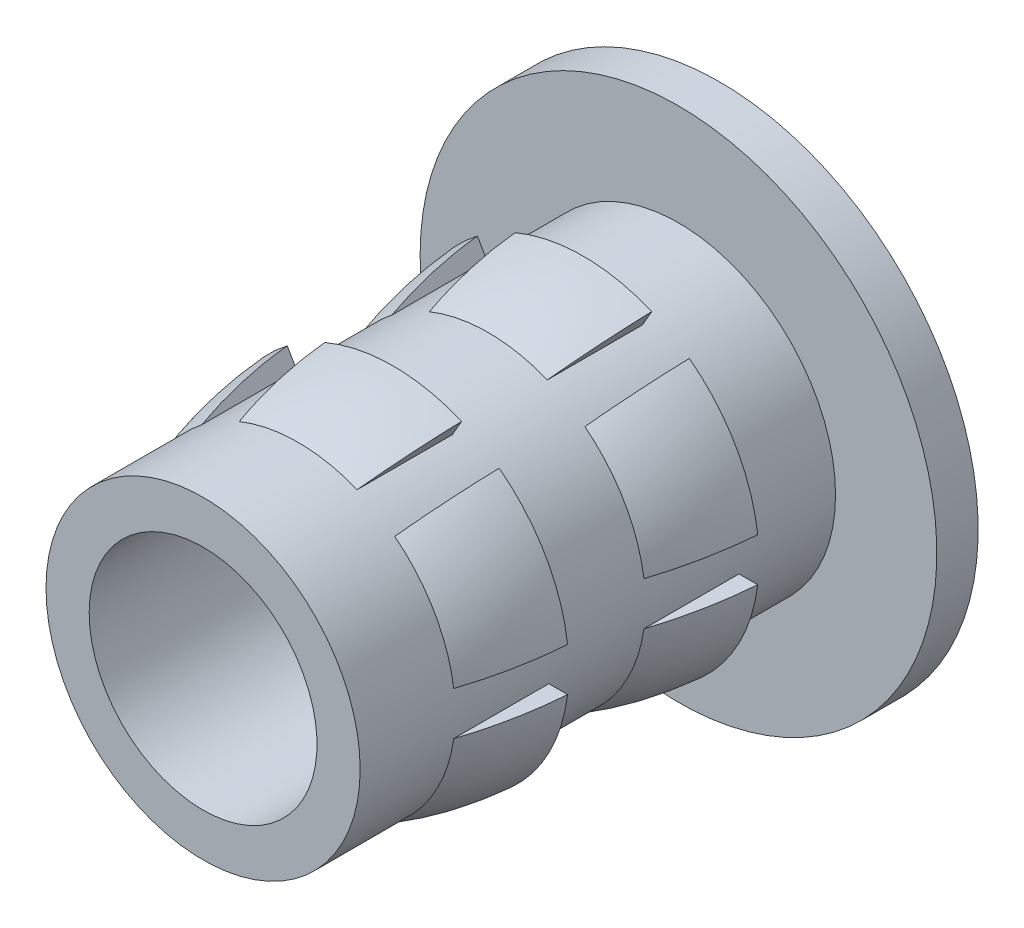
ISO-10303-21;
HEADER;
FILE_DESCRIPTION(('STEP AP214'),'2;1');
FILE_NAME('part.step','',(''),(''),'','','');
FILE_SCHEMA(('AUTOMOTIVE_DESIGN { 1 0 10303 214 1 1 1 1 }'));
ENDSEC;
DATA;
#1=APPLICATION_CONTEXT('core data for automotive mechanical design processes');
#2=APPLICATION_PROTOCOL_DEFINITION('international standard','automotive_design',2000,#1);
#3=PRODUCT_CONTEXT('',#1,'mechanical');
#4=PRODUCT('Part','Part','',(#3));
#5=PRODUCT_RELATED_PRODUCT_CATEGORY('part','',(#4));
#6=PRODUCT_DEFINITION_FORMATION('','',#4);
#7=PRODUCT_DEFINITION_CONTEXT('part definition',#1,'design');
#8=PRODUCT_DEFINITION('design','',#6,#7);
#9=PRODUCT_DEFINITION_SHAPE('','',#8);
#10=(LENGTH_UNIT() NAMED_UNIT(*) SI_UNIT(.MILLI.,.METRE.));
#11=(NAMED_UNIT(*) PLANE_ANGLE_UNIT() SI_UNIT($,.RADIAN.));
#12=(NAMED_UNIT(*) SI_UNIT($,.STERADIAN.) SOLID_ANGLE_UNIT());
#13=UNCERTAINTY_MEASURE_WITH_UNIT(LENGTH_MEASURE(1.E-05),#10,'distance_accuracy_value','');
#14=(GEOMETRIC_REPRESENTATION_CONTEXT(3) GLOBAL_UNCERTAINTY_ASSIGNED_CONTEXT((#13)) GLOBAL_UNIT_ASSIGNED_CONTEXT((#10,
#11,#12)) REPRESENTATION_CONTEXT('',''));
#15=CARTESIAN_POINT('',(0.,0.,0.));
#16=DIRECTION('',(0.,0.,1.));
#17=DIRECTION('',(1.,0.,0.));
#18=AXIS2_PLACEMENT_3D('',#15,#16,#17);
#19=CARTESIAN_POINT('',(11.12214757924,0.,-18.0330107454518));
#20=DIRECTION('',(0.,0.,1.));
#21=DIRECTION('',(1.,0.,0.));
#22=AXIS2_PLACEMENT_3D('',#19,#20,#21);
#23=PLANE('',#22);
#24=CARTESIAN_POINT('',(8.22654757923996,0.,-18.0330107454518));
#25=DIRECTION('',(0.,0.,-1.));
#26=DIRECTION('',(-1.,0.,0.));
#27=AXIS2_PLACEMENT_3D('',#24,#25,#26);
#28=CIRCLE('',#27,3.2385);
#29=CARTESIAN_POINT('',(6.96610660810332,2.98314780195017,-18.0330107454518));
#30=VERTEX_POINT('',#29);
#31=CARTESIAN_POINT('',(9.48698855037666,2.98314780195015,-18.0330107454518));
#32=VERTEX_POINT('',#31);
#33=EDGE_CURVE('E544',#30,#32,#28,.T.);
#34=ORIENTED_EDGE('',*,*,#33,.T.);
#35=DIRECTION('',(-0.50000000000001,-0.866025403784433,0.));
#36=VECTOR('',#35,1.);
#37=CARTESIAN_POINT('',(8.60403741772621,1.45383157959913,-18.0330107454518));
#38=LINE('',#37,#36);
#39=CARTESIAN_POINT('',(9.31405681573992,2.68362125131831,-18.0330107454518));
#40=VERTEX_POINT('',#39);
#41=EDGE_CURVE('E858',#32,#40,#38,.T.);
#42=ORIENTED_EDGE('',*,*,#41,.T.);
#43=CARTESIAN_POINT('',(8.22654757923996,0.,-18.0330107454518));
#44=DIRECTION('',(0.,0.,-1.));
#45=DIRECTION('',(-1.,0.,0.));
#46=AXIS2_PLACEMENT_3D('',#43,#44,#45);
#47=CIRCLE('',#46,2.8956);
#48=CARTESIAN_POINT('',(7.13903834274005,2.68362125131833,-18.0330107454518));
#49=VERTEX_POINT('',#48);
#50=EDGE_CURVE('E293',#49,#40,#47,.T.);
#51=ORIENTED_EDGE('',*,*,#50,.F.);
#52=DIRECTION('',(-0.499999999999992,0.866025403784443,0.));
#53=VECTOR('',#52,1.);
#54=CARTESIAN_POINT('',(9.29685774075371,-1.0538315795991,-18.0330107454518));
#55=LINE('',#54,#53);
#56=EDGE_CURVE('E908',#49,#30,#55,.T.);
#57=ORIENTED_EDGE('',*,*,#56,.T.);
#58=EDGE_LOOP('',(#34,#42,#51,#57));
#59=FACE_BOUND('',#58,.T.);
#60=ADVANCED_FACE('F39',(#59),#23,.F.);
#61=CARTESIAN_POINT('',(8.22654757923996,0.,-18.6087172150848));
#62=DIRECTION('',(0.,0.,-1.));
#63=DIRECTION('',(-1.,0.,0.));
#64=AXIS2_PLACEMENT_3D('',#61,#62,#63);
#65=DEGENERATE_TOROIDAL_SURFACE('',#64,4.35431640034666,7.61461087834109,.F.);
#66=CARTESIAN_POINT('',(8.22654757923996,0.,-16.2804107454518));
#67=DIRECTION('',(0.,0.,-1.));
#68=DIRECTION('',(-1.,0.,0.));
#69=AXIS2_PLACEMENT_3D('',#66,#67,#68);
#70=CIRCLE('',#69,2.8956);
#71=CARTESIAN_POINT('',(7.13903834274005,2.68362125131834,-16.2804107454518));
#72=VERTEX_POINT('',#71);
#73=CARTESIAN_POINT('',(9.31405681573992,2.68362125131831,-16.2804107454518));
#74=VERTEX_POINT('',#73);
#75=EDGE_CURVE('E547',#72,#74,#70,.T.);
#76=ORIENTED_EDGE('',*,*,#75,.T.);
#77=CARTESIAN_POINT('',(9.31402438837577,2.68356508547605,-16.2802107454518));
#78=CARTESIAN_POINT('',(9.33708709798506,2.72351087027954,-16.4224319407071));
#79=CARTESIAN_POINT('',(9.3580268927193,2.75977965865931,-16.5660286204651));
#80=CARTESIAN_POINT('',(9.39553711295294,2.82474926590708,-16.8549493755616));
#81=CARTESIAN_POINT('',(9.41212260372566,2.85347617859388,-17.000265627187));
#82=CARTESIAN_POINT('',(9.44096315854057,2.90342948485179,-17.2926064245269));
#83=CARTESIAN_POINT('',(9.45321823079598,2.92465589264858,-17.4396309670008));
#84=CARTESIAN_POINT('',(9.47339695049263,2.95960646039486,-17.7353914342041));
#85=CARTESIAN_POINT('',(9.4813052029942,2.97330395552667,-17.884131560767));
#86=CARTESIAN_POINT('',(9.48699618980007,2.98316103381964,-18.0332107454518));
#87=B_SPLINE_CURVE_WITH_KNOTS('',3,(#77,#78,#79,#80,#81,#82,#83,#84,#85,#86),.UNSPECIFIED.,.F.,
.F.,(4,2,2,2,4),(0.,0.448473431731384,0.895374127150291,1.34227397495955,1.79074655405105),.UNSPECIFIED.);
#88=EDGE_CURVE('E862',#74,#32,#87,.T.);
#89=ORIENTED_EDGE('',*,*,#88,.T.);
#90=ORIENTED_EDGE('',*,*,#33,.F.);
#91=CARTESIAN_POINT('',(6.96609896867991,2.98316103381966,-18.0332107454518));
#92=CARTESIAN_POINT('',(6.97178995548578,2.97330395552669,-17.884131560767));
#93=CARTESIAN_POINT('',(6.97969820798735,2.95960646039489,-17.7353914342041));
#94=CARTESIAN_POINT('',(6.99987692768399,2.92465589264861,-17.4396309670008));
#95=CARTESIAN_POINT('',(7.0121319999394,2.90342948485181,-17.2926064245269));
#96=CARTESIAN_POINT('',(7.04097255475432,2.8534761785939,-17.000265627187));
#97=CARTESIAN_POINT('',(7.05755804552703,2.8247492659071,-16.8549493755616));
#98=CARTESIAN_POINT('',(7.09506826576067,2.75977965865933,-16.5660286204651));
#99=CARTESIAN_POINT('',(7.11600806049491,2.72351087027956,-16.4224319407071));
#100=CARTESIAN_POINT('',(7.1390707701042,2.68356508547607,-16.2802107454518));
#101=B_SPLINE_CURVE_WITH_KNOTS('',3,(#91,#92,#93,#94,#95,#96,#97,#98,#99,#100),.UNSPECIFIED.,
.F.,.F.,(4,2,2,2,4),(0.,0.448472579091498,0.895372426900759,1.34227312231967,1.79074655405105),.UNSPECIFIED.);
#102=EDGE_CURVE('E465',#30,#72,#101,.T.);
#103=ORIENTED_EDGE('',*,*,#102,.T.);
#104=EDGE_LOOP('',(#76,#89,#90,#103));
#105=FACE_BOUND('',#104,.T.);
#106=ADVANCED_FACE('F399',(#105),#65,.F.);
#107=CARTESIAN_POINT('',(11.12214757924,0.,-14.5278107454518));
#108=DIRECTION('',(0.,0.,1.));
#109=DIRECTION('',(1.,0.,0.));
#110=AXIS2_PLACEMENT_3D('',#107,#108,#109);
#111=PLANE('',#110);
#112=CARTESIAN_POINT('',(8.22654757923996,0.,-14.5278107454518));
#113=DIRECTION('',(0.,0.,-1.));
#114=DIRECTION('',(-1.,0.,0.));
#115=AXIS2_PLACEMENT_3D('',#112,#113,#114);
#116=CIRCLE('',#115,3.2385);
#117=CARTESIAN_POINT('',(6.96610660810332,2.98314780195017,-14.5278107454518));
#118=VERTEX_POINT('',#117);
#119=CARTESIAN_POINT('',(9.48698855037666,2.98314780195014,-14.5278107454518));
#120=VERTEX_POINT('',#119);
#121=EDGE_CURVE('E799',#118,#120,#116,.T.);
#122=ORIENTED_EDGE('',*,*,#121,.T.);
#123=DIRECTION('',(-0.50000000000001,-0.866025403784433,0.));
#124=VECTOR('',#123,1.);
#125=CARTESIAN_POINT('',(8.60403741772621,1.45383157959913,-14.5278107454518));
#126=LINE('',#125,#124);
#127=CARTESIAN_POINT('',(9.31405681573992,2.68362125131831,-14.5278107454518));
#128=VERTEX_POINT('',#127);
#129=EDGE_CURVE('E895',#120,#128,#126,.T.);
#130=ORIENTED_EDGE('',*,*,#129,.T.);
#131=CARTESIAN_POINT('',(8.22654757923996,0.,-14.5278107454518));
#132=DIRECTION('',(0.,0.,-1.));
#133=DIRECTION('',(-1.,0.,0.));
#134=AXIS2_PLACEMENT_3D('',#131,#132,#133);
#135=CIRCLE('',#134,2.8956);
#136=CARTESIAN_POINT('',(7.13903834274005,2.68362125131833,-14.5278107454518));
#137=VERTEX_POINT('',#136);
#138=EDGE_CURVE('E893',#137,#128,#135,.T.);
#139=ORIENTED_EDGE('',*,*,#138,.F.);
#140=DIRECTION('',(-0.499999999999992,0.866025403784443,0.));
#141=VECTOR('',#140,1.);
#142=CARTESIAN_POINT('',(9.29685774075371,-1.0538315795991,-14.5278107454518));
#143=LINE('',#142,#141);
#144=EDGE_CURVE('E870',#137,#118,#143,.T.);
#145=ORIENTED_EDGE('',*,*,#144,.T.);
#146=EDGE_LOOP('',(#122,#130,#139,#145));
#147=FACE_BOUND('',#146,.T.);
#148=ADVANCED_FACE('F718',(#147),#111,.F.);
#149=CARTESIAN_POINT('',(8.22654757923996,0.,-15.0257929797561));
#150=DIRECTION('',(0.,0.,-1.));
#151=DIRECTION('',(-1.,0.,0.));
#152=AXIS2_PLACEMENT_3D('',#149,#150,#151);
#153=DEGENERATE_TOROIDAL_SURFACE('',#152,3.95705919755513,7.2127705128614,.F.);
#154=CARTESIAN_POINT('',(8.22654757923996,0.,-12.7752107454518));
#155=DIRECTION('',(0.,0.,-1.));
#156=DIRECTION('',(-1.,0.,0.));
#157=AXIS2_PLACEMENT_3D('',#154,#155,#156);
#158=CIRCLE('',#157,2.8956);
#159=CARTESIAN_POINT('',(7.13903834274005,2.68362125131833,-12.7752107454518));
#160=VERTEX_POINT('',#159);
#161=CARTESIAN_POINT('',(9.31405681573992,2.68362125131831,-12.7752107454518));
#162=VERTEX_POINT('',#161);
#163=EDGE_CURVE('E811',#160,#162,#158,.T.);
#164=ORIENTED_EDGE('',*,*,#163,.T.);
#165=CARTESIAN_POINT('',(9.31402365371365,2.68356381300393,-12.7750107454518));
#166=CARTESIAN_POINT('',(9.33756913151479,2.72434577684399,-12.9169895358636));
#167=CARTESIAN_POINT('',(9.35887596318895,2.76125029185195,-13.0604515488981));
#168=CARTESIAN_POINT('',(9.39687240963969,2.82706206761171,-13.3492013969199));
#169=CARTESIAN_POINT('',(9.41357974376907,2.85600001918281,-13.4944799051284));
#170=CARTESIAN_POINT('',(9.44242223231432,2.9059566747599,-13.786840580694));
#171=CARTESIAN_POINT('',(9.4545573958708,2.92697539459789,-13.9339227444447));
#172=CARTESIAN_POINT('',(9.47425387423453,2.96109069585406,-14.22989450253));
#173=CARTESIAN_POINT('',(9.48179705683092,2.97415587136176,-14.3787889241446));
#174=CARTESIAN_POINT('',(9.48699552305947,2.98315987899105,-14.5280107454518));
#175=B_SPLINE_CURVE_WITH_KNOTS('',3,(#165,#166,#167,#168,#169,#170,#171,#172,#173,#174),
.UNSPECIFIED.,.F.,.F.,(4,2,2,2,4),(0.,0.448677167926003,0.895600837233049,1.34252361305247,
1.79119988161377),.UNSPECIFIED.);
#176=EDGE_CURVE('E277',#162,#120,#175,.T.);
#177=ORIENTED_EDGE('',*,*,#176,.T.);
#178=ORIENTED_EDGE('',*,*,#121,.F.);
#179=CARTESIAN_POINT('',(6.96609963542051,2.98315987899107,-14.5280107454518));
#180=CARTESIAN_POINT('',(6.97129810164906,2.97415587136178,-14.3787889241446));
#181=CARTESIAN_POINT('',(6.97884128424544,2.96109069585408,-14.22989450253));
#182=CARTESIAN_POINT('',(6.99853776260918,2.92697539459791,-13.9339227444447));
#183=CARTESIAN_POINT('',(7.01067292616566,2.90595667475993,-13.786840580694));
#184=CARTESIAN_POINT('',(7.0395154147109,2.85600001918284,-13.4944799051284));
#185=CARTESIAN_POINT('',(7.05622274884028,2.82706206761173,-13.3492013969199));
#186=CARTESIAN_POINT('',(7.09421919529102,2.76125029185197,-13.0604515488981));
#187=CARTESIAN_POINT('',(7.11552602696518,2.72434577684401,-12.9169895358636));
#188=CARTESIAN_POINT('',(7.13907150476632,2.68356381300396,-12.7750107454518));
#189=B_SPLINE_CURVE_WITH_KNOTS('',3,(#179,#180,#181,#182,#183,#184,#185,#186,#187,#188),
.UNSPECIFIED.,.F.,.F.,(4,2,2,2,4),(0.,0.448676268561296,0.895599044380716,1.34252271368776,
1.79119988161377),.UNSPECIFIED.);
#190=EDGE_CURVE('E866',#118,#160,#189,.T.);
#191=ORIENTED_EDGE('',*,*,#190,.T.);
#192=EDGE_LOOP('',(#164,#177,#178,#191));
#193=FACE_BOUND('',#192,.T.);
#194=ADVANCED_FACE('F722',(#193),#153,.F.);
#195=CARTESIAN_POINT('',(5.01284531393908,0.4,-18.0330107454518));
#196=VERTEX_POINT('',#195);
#197=CARTESIAN_POINT('',(6.27328628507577,2.58314780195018,-18.0330107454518));
#198=VERTEX_POINT('',#197);
#199=EDGE_CURVE('E340',#196,#198,#28,.T.);
#200=ORIENTED_EDGE('',*,*,#199,.T.);
#201=DIRECTION('',(0.499999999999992,-0.866025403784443,0.));
#202=VECTOR('',#201,1.);
#203=CARTESIAN_POINT('',(8.60403741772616,-1.45383157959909,-18.0330107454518));
#204=LINE('',#203,#202);
#205=CARTESIAN_POINT('',(6.4462180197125,2.28362125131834,-18.0330107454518));
#206=VERTEX_POINT('',#205);
#207=EDGE_CURVE('E339',#198,#206,#204,.T.);
#208=ORIENTED_EDGE('',*,*,#207,.T.);
#209=CARTESIAN_POINT('',(5.35870878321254,0.4,-18.0330107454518));
#210=VERTEX_POINT('',#209);
#211=EDGE_CURVE('E298',#210,#206,#47,.T.);
#212=ORIENTED_EDGE('',*,*,#211,.F.);
#213=DIRECTION('',(-1.,0.,0.));
#214=VECTOR('',#213,1.);
#215=CARTESIAN_POINT('',(11.12214757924,0.4,-18.0330107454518));
#216=LINE('',#215,#214);
#217=EDGE_CURVE('E337',#210,#196,#216,.T.);
#218=ORIENTED_EDGE('',*,*,#217,.T.);
#219=EDGE_LOOP('',(#200,#208,#212,#218));
#220=FACE_BOUND('',#219,.T.);
#221=ADVANCED_FACE('F336',(#220),#23,.F.);
#222=CARTESIAN_POINT('',(5.35870878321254,0.4,-16.2804107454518));
#223=VERTEX_POINT('',#222);
#224=CARTESIAN_POINT('',(6.4462180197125,2.28362125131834,-16.2804107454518));
#225=VERTEX_POINT('',#224);
#226=EDGE_CURVE('E551',#223,#225,#70,.T.);
#227=ORIENTED_EDGE('',*,*,#226,.T.);
#228=CARTESIAN_POINT('',(6.44625044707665,2.28356508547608,-16.2802107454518));
#229=CARTESIAN_POINT('',(6.42318773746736,2.32351087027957,-16.4224319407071));
#230=CARTESIAN_POINT('',(6.40224794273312,2.35977965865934,-16.5660286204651));
#231=CARTESIAN_POINT('',(6.36473772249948,2.42474926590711,-16.8549493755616));
#232=CARTESIAN_POINT('',(6.34815223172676,2.45347617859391,-17.000265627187));
#233=CARTESIAN_POINT('',(6.31931167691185,2.50342948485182,-17.2926064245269));
#234=CARTESIAN_POINT('',(6.30705660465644,2.52465589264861,-17.4396309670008));
#235=CARTESIAN_POINT('',(6.2868778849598,2.55960646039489,-17.7353914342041));
#236=CARTESIAN_POINT('',(6.27896963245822,2.5733039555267,-17.884131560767));
#237=CARTESIAN_POINT('',(6.27327864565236,2.58316103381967,-18.0332107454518));
#238=B_SPLINE_CURVE_WITH_KNOTS('',3,(#228,#229,#230,#231,#232,#233,#234,#235,#236,#237),
.UNSPECIFIED.,.F.,.F.,(4,2,2,2,4),(0.,0.448473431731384,0.895374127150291,1.34227397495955,
1.79074655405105),.UNSPECIFIED.);
#239=EDGE_CURVE('E344',#225,#198,#238,.T.);
#240=ORIENTED_EDGE('',*,*,#239,.T.);
#241=ORIENTED_EDGE('',*,*,#199,.F.);
#242=CARTESIAN_POINT('',(5.13373568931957,0.4,-17.1464409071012));
#243=CARTESIAN_POINT('',(5.17466432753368,0.4,-16.9390085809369));
#244=CARTESIAN_POINT('',(5.22431747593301,0.4,-16.7332768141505));
#245=CARTESIAN_POINT('',(5.34077202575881,0.4,-16.3266246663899));
#246=CARTESIAN_POINT('',(5.40758189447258,0.4,-16.1257067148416));
#247=CARTESIAN_POINT('',(5.55812231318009,0.4,-15.7296619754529));
#248=CARTESIAN_POINT('',(5.64190006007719,0.4,-15.5345531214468));
#249=CARTESIAN_POINT('',(5.8257111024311,0.4,-15.1522216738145));
#250=CARTESIAN_POINT('',(5.92573834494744,0.4,-14.9649961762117));
#251=CARTESIAN_POINT('',(6.11900800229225,0.4,-14.6378540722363));
#252=CARTESIAN_POINT('',(6.20932811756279,0.4,-14.4962025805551));
#253=CARTESIAN_POINT('',(6.39955037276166,0.4,-14.2194270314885));
#254=CARTESIAN_POINT('',(6.49945485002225,0.4,-14.0843045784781));
#255=CARTESIAN_POINT('',(6.70818378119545,0.4,-13.8220109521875));
#256=CARTESIAN_POINT('',(6.81696936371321,0.4,-13.6948090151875));
#257=CARTESIAN_POINT('',(6.98708262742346,0.4,-13.510519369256));
#258=CARTESIAN_POINT('',(7.04492655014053,0.4,-13.4501902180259));
#259=CARTESIAN_POINT('',(7.16302175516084,0.4,-13.3319392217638));
#260=CARTESIAN_POINT('',(7.22327267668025,0.4,-13.2740170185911));
#261=CARTESIAN_POINT('',(7.33880912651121,0.4,-13.1679491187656));
#262=CARTESIAN_POINT('',(7.39379482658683,0.4,-13.1194767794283));
#263=CARTESIAN_POINT('',(7.50614642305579,0.4,-13.0251407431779));
#264=CARTESIAN_POINT('',(7.56351608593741,0.4,-12.9792814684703));
#265=CARTESIAN_POINT('',(7.65106047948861,0.4,-12.9139453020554));
#266=CARTESIAN_POINT('',(7.68012375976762,0.4,-12.89297984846));
#267=CARTESIAN_POINT('',(7.73908541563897,0.4,-12.85226421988));
#268=CARTESIAN_POINT('',(7.76898357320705,0.4,-12.8325137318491));
#269=CARTESIAN_POINT('',(7.8298062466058,0.4,-12.7946707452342));
#270=CARTESIAN_POINT('',(7.86073034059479,0.4,-12.7765775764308));
#271=CARTESIAN_POINT('',(7.92386563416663,0.4,-12.7428309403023));
#272=CARTESIAN_POINT('',(7.95607522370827,0.4,-12.7271745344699));
#273=CARTESIAN_POINT('',(8.02076460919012,0.4,-12.7001756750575));
#274=CARTESIAN_POINT('',(8.0531792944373,0.4,-12.6886827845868));
#275=CARTESIAN_POINT('',(8.11933062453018,0.4,-12.6710872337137));
#276=CARTESIAN_POINT('',(8.15305687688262,0.4,-12.6649487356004));
#277=CARTESIAN_POINT('',(8.20425837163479,0.4,-12.6609090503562));
#278=CARTESIAN_POINT('',(8.22154411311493,0.4,-12.660438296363));
#279=CARTESIAN_POINT('',(8.25607151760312,0.4,-12.6612846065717));
#280=CARTESIAN_POINT('',(8.27331317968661,0.4,-12.6626017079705));
#281=CARTESIAN_POINT('',(8.32484968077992,0.4,-12.6691199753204));
#282=CARTESIAN_POINT('',(8.35882598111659,0.4,-12.6768972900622));
#283=CARTESIAN_POINT('',(8.42365178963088,0.4,-12.6968978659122));
#284=CARTESIAN_POINT('',(8.45457317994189,0.4,-12.7089067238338));
#285=CARTESIAN_POINT('',(8.51513377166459,0.4,-12.7358709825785));
#286=CARTESIAN_POINT('',(8.54477063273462,0.4,-12.7508315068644));
#287=CARTESIAN_POINT('',(8.60315917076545,0.4,-12.7828352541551));
#288=CARTESIAN_POINT('',(8.63190274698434,0.4,-12.799892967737));
#289=CARTESIAN_POINT('',(8.68847450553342,0.4,-12.8354002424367));
#290=CARTESIAN_POINT('',(8.71630341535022,0.4,-12.8538486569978));
#291=CARTESIAN_POINT('',(8.79562253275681,0.4,-12.9086204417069));
#292=CARTESIAN_POINT('',(8.84619025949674,0.4,-12.9462755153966));
#293=CARTESIAN_POINT('',(8.94541038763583,0.4,-13.0240453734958));
#294=CARTESIAN_POINT('',(8.99406170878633,0.4,-13.0641615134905));
#295=CARTESIAN_POINT('',(9.08981226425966,0.4,-13.1463603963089));
#296=CARTESIAN_POINT('',(9.1369087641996,0.4,-13.1884463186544));
#297=CARTESIAN_POINT('',(9.2296281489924,0.4,-13.2742146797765));
#298=CARTESIAN_POINT('',(9.27525084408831,0.4,-13.3178973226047));
#299=CARTESIAN_POINT('',(9.40990847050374,0.4,-13.4509184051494));
#300=CARTESIAN_POINT('',(9.4968802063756,0.4,-13.5423583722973));
#301=CARTESIAN_POINT('',(9.66545370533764,0.4,-13.7298679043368));
#302=CARTESIAN_POINT('',(9.74706042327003,0.4,-13.8259330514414));
#303=CARTESIAN_POINT('',(9.95485457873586,0.4,-14.0842492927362));
#304=CARTESIAN_POINT('',(10.076694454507,0.4,-14.2500280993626));
#305=CARTESIAN_POINT('',(10.3060702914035,0.4,-14.5913340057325));
#306=CARTESIAN_POINT('',(10.4135957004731,0.4,-14.7668681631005));
#307=CARTESIAN_POINT('',(10.6136686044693,0.4,-15.1261504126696));
#308=CARTESIAN_POINT('',(10.706224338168,0.4,-15.3098939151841));
#309=CARTESIAN_POINT('',(10.8758903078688,0.4,-15.6843227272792));
#310=CARTESIAN_POINT('',(10.9530040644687,0.4,-15.8750064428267));
#311=CARTESIAN_POINT('',(11.0919513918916,0.4,-16.2637054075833));
#312=CARTESIAN_POINT('',(11.1536484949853,0.4,-16.4617694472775));
#313=CARTESIAN_POINT('',(11.260534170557,0.4,-16.8623772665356));
#314=CARTESIAN_POINT('',(11.3057168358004,0.4,-17.0649226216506));
#315=CARTESIAN_POINT('',(11.3792683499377,0.4,-17.4730954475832));
#316=CARTESIAN_POINT('',(11.4076330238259,0.4,-17.6787236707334));
#317=CARTESIAN_POINT('',(11.4473519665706,0.4,-18.0916214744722));
#318=CARTESIAN_POINT('',(11.4587057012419,0.4,-18.2988911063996));
#319=CARTESIAN_POINT('',(11.4643924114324,0.4,-18.7183910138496));
#320=CARTESIAN_POINT('',(11.4583317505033,0.4,-18.9306267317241));
#321=CARTESIAN_POINT('',(11.42837785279,0.4,-19.3538379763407));
#322=CARTESIAN_POINT('',(11.4044843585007,0.4,-19.5648134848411));
#323=CARTESIAN_POINT('',(11.3390240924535,0.4,-19.9840005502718));
#324=CARTESIAN_POINT('',(11.2974577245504,0.4,-20.1922121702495));
#325=CARTESIAN_POINT('',(11.1969270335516,0.4,-20.6043872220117));
#326=CARTESIAN_POINT('',(11.137963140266,0.4,-20.808350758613));
#327=CARTESIAN_POINT('',(11.0029324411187,0.4,-21.2108329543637));
#328=CARTESIAN_POINT('',(10.9268434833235,0.4,-21.4093441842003));
#329=CARTESIAN_POINT('',(10.7581219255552,0.4,-21.7991187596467));
#330=CARTESIAN_POINT('',(10.6654956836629,0.4,-21.9903848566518));
#331=CARTESIAN_POINT('',(10.4642346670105,0.4,-22.364318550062));
#332=CARTESIAN_POINT('',(10.3555991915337,0.4,-22.5469857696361));
#333=CARTESIAN_POINT('',(10.1229698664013,0.4,-22.9021292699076));
#334=CARTESIAN_POINT('',(9.9989843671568,0.4,-23.0746110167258));
#335=CARTESIAN_POINT('',(9.74886030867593,0.4,-23.3916618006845));
#336=CARTESIAN_POINT('',(9.62410178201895,0.4,-23.5373145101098));
#337=CARTESIAN_POINT('',(9.42800193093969,0.4,-23.7469515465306));
#338=CARTESIAN_POINT('',(9.36124756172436,0.4,-23.8152618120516));
#339=CARTESIAN_POINT('',(9.22454951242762,0.4,-23.9486068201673));
#340=CARTESIAN_POINT('',(9.15460668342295,0.4,-24.0136424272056));
#341=CARTESIAN_POINT('',(9.03204989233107,0.4,-24.1212518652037));
#342=CARTESIAN_POINT('',(8.98033011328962,0.4,-24.1648455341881));
#343=CARTESIAN_POINT('',(8.87456174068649,0.4,-24.2495619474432));
#344=CARTESIAN_POINT('',(8.82050541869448,0.4,-24.2906752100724));
#345=CARTESIAN_POINT('',(8.73704918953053,0.4,-24.349505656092));
#346=CARTESIAN_POINT('',(8.70870695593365,0.4,-24.3687196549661));
#347=CARTESIAN_POINT('',(8.65114054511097,0.4,-24.4057688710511));
#348=CARTESIAN_POINT('',(8.62191667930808,0.4,-24.4236045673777));
#349=CARTESIAN_POINT('',(8.56245361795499,0.4,-24.4572848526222));
#350=CARTESIAN_POINT('',(8.53221821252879,0.4,-24.4731360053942));
#351=CARTESIAN_POINT('',(8.47042912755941,0.4,-24.5019433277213));
#352=CARTESIAN_POINT('',(8.43887767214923,0.4,-24.5149041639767));
#353=CARTESIAN_POINT('',(8.37202009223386,0.4,-24.5370964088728));
#354=CARTESIAN_POINT('',(8.33660375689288,0.4,-24.5460231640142));
#355=CARTESIAN_POINT('',(8.28278950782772,0.4,-24.5538862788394));
#356=CARTESIAN_POINT('',(8.26479105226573,0.4,-24.5555892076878));
#357=CARTESIAN_POINT('',(8.22871235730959,0.4,-24.5570417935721));
#358=CARTESIAN_POINT('',(8.21063212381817,0.4,-24.5567915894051));
#359=CARTESIAN_POINT('',(8.17464341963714,0.4,-24.5543604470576));
#360=CARTESIAN_POINT('',(8.15673467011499,0.4,-24.5521835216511));
#361=CARTESIAN_POINT('',(8.121210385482,0.4,-24.5460917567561));
#362=CARTESIAN_POINT('',(8.10359508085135,0.4,-24.5421756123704));
#363=CARTESIAN_POINT('',(8.05108533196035,0.4,-24.5281662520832));
#364=CARTESIAN_POINT('',(8.01678917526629,0.4,-24.5158367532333));
#365=CARTESIAN_POINT('',(7.96033516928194,0.4,-24.491837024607));
#366=CARTESIAN_POINT('',(7.93772381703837,0.4,-24.481157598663));
#367=CARTESIAN_POINT('',(7.89317217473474,0.4,-24.458470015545));
#368=CARTESIAN_POINT('',(7.87123197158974,0.4,-24.4464616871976));
#369=CARTESIAN_POINT('',(7.80618044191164,0.4,-24.408915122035));
#370=CARTESIAN_POINT('',(7.76393055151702,0.4,-24.381897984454));
#371=CARTESIAN_POINT('',(7.68092768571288,0.4,-24.3253222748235));
#372=CARTESIAN_POINT('',(7.64018238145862,0.4,-24.2957527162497));
#373=CARTESIAN_POINT('',(7.56007446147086,0.4,-24.2349040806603));
#374=CARTESIAN_POINT('',(7.52071021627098,0.4,-24.2036271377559));
#375=CARTESIAN_POINT('',(7.41560876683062,0.4,-24.1170945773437));
#376=CARTESIAN_POINT('',(7.35093831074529,0.4,-24.0605448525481));
#377=CARTESIAN_POINT('',(7.22432317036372,0.4,-23.9444539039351));
#378=CARTESIAN_POINT('',(7.16237945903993,0.4,-23.8849116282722));
#379=CARTESIAN_POINT('',(7.04095070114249,0.4,-23.7632013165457));
#380=CARTESIAN_POINT('',(6.98146931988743,0.4,-23.7010296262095));
#381=CARTESIAN_POINT('',(6.86497554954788,0.4,-23.5744105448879));
#382=CARTESIAN_POINT('',(6.8079634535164,0.4,-23.5099628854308));
#383=CARTESIAN_POINT('',(6.64088811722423,0.4,-23.3138352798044));
#384=CARTESIAN_POINT('',(6.53445426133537,0.4,-23.1790355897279));
#385=CARTESIAN_POINT('',(6.33154235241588,0.4,-22.9023297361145));
#386=CARTESIAN_POINT('',(6.23505703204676,0.4,-22.7604288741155));
#387=CARTESIAN_POINT('',(6.04773753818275,0.4,-22.4631242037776));
#388=CARTESIAN_POINT('',(5.95741203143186,0.4,-22.3073994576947));
#389=CARTESIAN_POINT('',(5.78825294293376,0.4,-21.989787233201));
#390=CARTESIAN_POINT('',(5.70942214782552,0.4,-21.8278982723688));
#391=CARTESIAN_POINT('',(5.56356843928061,0.4,-21.4987555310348));
#392=CARTESIAN_POINT('',(5.49655342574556,0.4,-21.3314982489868));
#393=CARTESIAN_POINT('',(5.37469826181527,0.4,-20.9926033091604));
#394=CARTESIAN_POINT('',(5.31985875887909,0.4,-20.8209654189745));
#395=CARTESIAN_POINT('',(5.21443937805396,0.4,-20.445049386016));
#396=CARTESIAN_POINT('',(5.16612319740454,0.4,-20.24013230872));
#397=CARTESIAN_POINT('',(5.08678575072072,0.4,-19.8270552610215));
#398=CARTESIAN_POINT('',(5.05575878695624,0.4,-19.618896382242));
#399=CARTESIAN_POINT('',(5.01119596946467,0.4,-19.2009304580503));
#400=CARTESIAN_POINT('',(4.99764230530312,0.4,-18.9911253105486));
#401=CARTESIAN_POINT('',(4.98806084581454,0.4,-18.5711993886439));
#402=CARTESIAN_POINT('',(4.99202522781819,0.4,-18.3610787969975));
#403=CARTESIAN_POINT('',(5.01495465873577,0.4,-17.9827728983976));
#404=CARTESIAN_POINT('',(5.03084609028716,0.4,-17.8143945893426));
#405=CARTESIAN_POINT('',(5.0738809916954,0.4,-17.479129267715));
#406=CARTESIAN_POINT('',(5.10102137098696,0.4,-17.312241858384));
#407=CARTESIAN_POINT('',(5.13373568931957,0.4,-17.1464409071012));
#408=B_SPLINE_CURVE_WITH_KNOTS('',3,(#242,#243,#244,#245,#246,#247,#248,#249,#250,#251,#252,
#253,#254,#255,#256,#257,#258,#259,#260,#261,#262,#263,#264,#265,#266,#267,#268,#269,#270,#271,
#272,#273,#274,#275,#276,#277,#278,#279,#280,#281,#282,#283,#284,#285,#286,#287,#288,#289,#290,
#291,#292,#293,#294,#295,#296,#297,#298,#299,#300,#301,#302,#303,#304,#305,#306,#307,#308,#309,
#310,#311,#312,#313,#314,#315,#316,#317,#318,#319,#320,#321,#322,#323,#324,#325,#326,#327,#328,
#329,#330,#331,#332,#333,#334,#335,#336,#337,#338,#339,#340,#341,#342,#343,#344,#345,#346,#347,
#348,#349,#350,#351,#352,#353,#354,#355,#356,#357,#358,#359,#360,#361,#362,#363,#364,#365,#366,
#367,#368,#369,#370,#371,#372,#373,#374,#375,#376,#377,#378,#379,#380,#381,#382,#383,#384,#385,
#386,#387,#388,#389,#390,#391,#392,#393,#394,#395,#396,#397,#398,#399,#400,#401,#402,#403,#404,
#405,#406,#407),.UNSPECIFIED.,.T.,.F.,(4,2,2,2,2,2,2,2,2,2,2,2,2,2,2,2,2,2,2,2,2,2,2,2,2,2,2,2,
2,2,2,2,2,2,2,2,2,2,2,2,2,2,2,2,2,2,2,2,2,2,2,2,2,2,2,2,2,2,2,2,2,2,2,2,2,2,2,2,2,2,2,2,2,2,2,2,
2,2,2,2,2,2,4),(0.,0.634143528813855,1.26860062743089,1.90484735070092,2.54085761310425,
3.04446885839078,3.54820323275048,4.0498402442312,4.30052537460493,4.55117306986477,
4.77101564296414,4.99121984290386,5.09870641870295,5.2061651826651,5.31358029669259,
5.42086485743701,5.52375488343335,5.62595084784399,5.67773946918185,5.729529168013,
5.83349217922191,5.93280542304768,6.0322925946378,6.13251051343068,6.23264669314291,
6.42166255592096,6.61078348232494,6.80022098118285,6.98968277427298,7.36802134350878,
7.7460054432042,8.36240288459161,8.97925222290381,9.59576090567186,10.2121288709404,
10.8337736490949,11.4556405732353,12.0776618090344,12.6997025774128,13.3359138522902,
13.9721343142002,14.6083402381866,15.2445304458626,15.8815483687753,16.5183219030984,
17.1551233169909,17.7915798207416,18.3661882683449,18.6526415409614,18.9390187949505,
19.1418884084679,19.3454899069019,19.448185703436,19.5508456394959,19.6531565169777,
19.7553009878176,19.864225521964,19.9183664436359,19.9725035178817,20.0265281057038,
20.0805932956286,20.189502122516,20.2644888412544,20.339485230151,20.4897818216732,
20.6407611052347,20.7915558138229,21.0491487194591,21.3068328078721,21.5648876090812,
21.8229729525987,22.3377329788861,22.8521142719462,23.391703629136,23.9314235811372,
24.4715030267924,25.0116111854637,25.6424644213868,26.27310963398,26.9031115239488,
27.5328321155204,28.0398431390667,28.546714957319),.UNSPECIFIED.);
#409=EDGE_CURVE('E387',#196,#223,#408,.T.);
#410=ORIENTED_EDGE('',*,*,#409,.T.);
#411=EDGE_LOOP('',(#227,#240,#241,#410));
#412=FACE_BOUND('',#411,.T.);
#413=ADVANCED_FACE('F719',(#412),#65,.F.);
#414=CARTESIAN_POINT('',(5.01284531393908,0.4,-14.5278107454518));
#415=VERTEX_POINT('',#414);
#416=CARTESIAN_POINT('',(6.27328628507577,2.58314780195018,-14.5278107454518));
#417=VERTEX_POINT('',#416);
#418=EDGE_CURVE('E797',#415,#417,#116,.T.);
#419=ORIENTED_EDGE('',*,*,#418,.T.);
#420=DIRECTION('',(0.499999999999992,-0.866025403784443,0.));
#421=VECTOR('',#420,1.);
#422=CARTESIAN_POINT('',(8.60403741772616,-1.45383157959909,-14.5278107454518));
#423=LINE('',#422,#421);
#424=CARTESIAN_POINT('',(6.4462180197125,2.28362125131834,-14.5278107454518));
#425=VERTEX_POINT('',#424);
#426=EDGE_CURVE('E349',#417,#425,#423,.T.);
#427=ORIENTED_EDGE('',*,*,#426,.T.);
#428=CARTESIAN_POINT('',(5.35870878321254,0.4,-14.5278107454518));
#429=VERTEX_POINT('',#428);
#430=EDGE_CURVE('E856',#429,#425,#135,.T.);
#431=ORIENTED_EDGE('',*,*,#430,.F.);
#432=DIRECTION('',(-1.,0.,0.));
#433=VECTOR('',#432,1.);
#434=CARTESIAN_POINT('',(11.12214757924,0.4,-14.5278107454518));
#435=LINE('',#434,#433);
#436=EDGE_CURVE('E367',#429,#415,#435,.T.);
#437=ORIENTED_EDGE('',*,*,#436,.T.);
#438=EDGE_LOOP('',(#419,#427,#431,#437));
#439=FACE_BOUND('',#438,.T.);
#440=ADVANCED_FACE('F754',(#439),#111,.F.);
#441=CARTESIAN_POINT('',(5.35870878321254,0.4,-12.7752107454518));
#442=VERTEX_POINT('',#441);
#443=CARTESIAN_POINT('',(6.4462180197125,2.28362125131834,-12.7752107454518));
#444=VERTEX_POINT('',#443);
#445=EDGE_CURVE('E812',#442,#444,#158,.T.);
#446=ORIENTED_EDGE('',*,*,#445,.T.);
#447=CARTESIAN_POINT('',(6.44625118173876,2.28356381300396,-12.7750107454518));
#448=CARTESIAN_POINT('',(6.42270570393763,2.32434577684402,-12.9169895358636));
#449=CARTESIAN_POINT('',(6.40139887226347,2.36125029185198,-13.0604515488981));
#450=CARTESIAN_POINT('',(6.36340242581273,2.42706206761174,-13.3492013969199));
#451=CARTESIAN_POINT('',(6.34669509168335,2.45600001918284,-13.4944799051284));
#452=CARTESIAN_POINT('',(6.31785260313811,2.50595667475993,-13.786840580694));
#453=CARTESIAN_POINT('',(6.30571743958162,2.52697539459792,-13.9339227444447));
#454=CARTESIAN_POINT('',(6.28602096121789,2.56109069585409,-14.22989450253));
#455=CARTESIAN_POINT('',(6.27847777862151,2.57415587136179,-14.3787889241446));
#456=CARTESIAN_POINT('',(6.27327931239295,2.58315987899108,-14.5280107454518));
#457=B_SPLINE_CURVE_WITH_KNOTS('',3,(#447,#448,#449,#450,#451,#452,#453,#454,#455,#456),
.UNSPECIFIED.,.F.,.F.,(4,2,2,2,4),(0.,0.448677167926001,0.895600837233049,1.34252361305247,
1.79119988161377),.UNSPECIFIED.);
#458=EDGE_CURVE('E910',#444,#417,#457,.T.);
#459=ORIENTED_EDGE('',*,*,#458,.T.);
#460=ORIENTED_EDGE('',*,*,#418,.F.);
#461=CARTESIAN_POINT('',(5.13081942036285,0.4,-13.6406654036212));
#462=CARTESIAN_POINT('',(5.16955693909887,0.4,-13.4443305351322));
#463=CARTESIAN_POINT('',(5.2165397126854,0.4,-13.2496359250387));
#464=CARTESIAN_POINT('',(5.32671365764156,0.4,-12.8647939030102));
#465=CARTESIAN_POINT('',(5.38991141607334,0.4,-12.6746483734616));
#466=CARTESIAN_POINT('',(5.53245190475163,0.4,-12.2994205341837));
#467=CARTESIAN_POINT('',(5.61187371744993,0.4,-12.1143682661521));
#468=CARTESIAN_POINT('',(5.78612444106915,0.4,-11.7517576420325));
#469=CARTESIAN_POINT('',(5.88094670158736,0.4,-11.5741960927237));
#470=CARTESIAN_POINT('',(6.08553455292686,0.4,-11.2277013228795));
#471=CARTESIAN_POINT('',(6.19531286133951,0.4,-11.0587756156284));
#472=CARTESIAN_POINT('',(6.42932634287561,0.4,-10.7308904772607));
#473=CARTESIAN_POINT('',(6.55357851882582,0.4,-10.571943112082));
#474=CARTESIAN_POINT('',(6.74985618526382,0.4,-10.3430658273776));
#475=CARTESIAN_POINT('',(6.8166707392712,0.4,-10.2686181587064));
#476=CARTESIAN_POINT('',(6.9537552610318,0.4,-10.1229224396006));
#477=CARTESIAN_POINT('',(7.02402622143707,0.4,-10.0516753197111));
#478=CARTESIAN_POINT('',(7.16794079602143,0.4,-9.91296000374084));
#479=CARTESIAN_POINT('',(7.2415770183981,0.4,-9.84548418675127));
#480=CARTESIAN_POINT('',(7.3548773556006,0.4,-9.74761368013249));
#481=CARTESIAN_POINT('',(7.39310920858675,0.4,-9.71555447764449));
#482=CARTESIAN_POINT('',(7.47061970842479,0.4,-9.65273087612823));
#483=CARTESIAN_POINT('',(7.50989819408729,0.4,-9.62196627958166));
#484=CARTESIAN_POINT('',(7.5736980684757,0.4,-9.5740249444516));
#485=CARTESIAN_POINT('',(7.59783558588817,0.4,-9.55633682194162));
#486=CARTESIAN_POINT('',(7.64659718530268,0.4,-9.52164067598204));
#487=CARTESIAN_POINT('',(7.67122128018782,0.4,-9.50463267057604));
#488=CARTESIAN_POINT('',(7.72108722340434,0.4,-9.47140535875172));
#489=CARTESIAN_POINT('',(7.74633044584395,0.4,-9.45518810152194));
#490=CARTESIAN_POINT('',(7.79747421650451,0.4,-9.42382981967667));
#491=CARTESIAN_POINT('',(7.82337468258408,0.4,-9.40868866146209));
#492=CARTESIAN_POINT('',(7.89065440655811,0.4,-9.37174622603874));
#493=CARTESIAN_POINT('',(7.93259886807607,0.4,-9.35094872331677));
#494=CARTESIAN_POINT('',(8.01891003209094,0.4,-9.31530782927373));
#495=CARTESIAN_POINT('',(8.06326349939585,0.4,-9.30043503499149));
#496=CARTESIAN_POINT('',(8.14052965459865,0.4,-9.28382345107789));
#497=CARTESIAN_POINT('',(8.17284283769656,0.4,-9.27947211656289));
#498=CARTESIAN_POINT('',(8.2376580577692,0.4,-9.27687025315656));
#499=CARTESIAN_POINT('',(8.27015949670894,0.4,-9.27860584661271));
#500=CARTESIAN_POINT('',(8.34311269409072,0.4,-9.28889282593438));
#501=CARTESIAN_POINT('',(8.38330605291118,0.4,-9.29917947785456));
#502=CARTESIAN_POINT('',(8.44208572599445,0.4,-9.31908620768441));
#503=CARTESIAN_POINT('',(8.46150517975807,0.4,-9.3265084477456));
#504=CARTESIAN_POINT('',(8.49985806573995,0.4,-9.3425238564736));
#505=CARTESIAN_POINT('',(8.51879157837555,0.4,-9.35111682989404));
#506=CARTESIAN_POINT('',(8.56811636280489,0.4,-9.37496232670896));
#507=CARTESIAN_POINT('',(8.59813628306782,0.4,-9.39097451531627));
#508=CARTESIAN_POINT('',(8.6572283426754,0.4,-9.42467341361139));
#509=CARTESIAN_POINT('',(8.68629986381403,0.4,-9.4423611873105));
#510=CARTESIAN_POINT('',(8.77246230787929,0.4,-9.49730300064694));
#511=CARTESIAN_POINT('',(8.82838892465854,0.4,-9.53637662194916));
#512=CARTESIAN_POINT('',(8.93813074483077,0.4,-9.61769110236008));
#513=CARTESIAN_POINT('',(8.99193823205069,0.4,-9.65994215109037));
#514=CARTESIAN_POINT('',(9.09756230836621,0.4,-9.74673044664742));
#515=CARTESIAN_POINT('',(9.14938122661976,0.4,-9.79126486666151));
#516=CARTESIAN_POINT('',(9.26803079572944,0.4,-9.89722487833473));
#517=CARTESIAN_POINT('',(9.33419887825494,0.4,-9.95939209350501));
#518=CARTESIAN_POINT('',(9.46366456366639,0.4,-10.0866560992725));
#519=CARTESIAN_POINT('',(9.52696155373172,0.4,-10.1517535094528));
#520=CARTESIAN_POINT('',(9.71276344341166,0.4,-10.3511279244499));
#521=CARTESIAN_POINT('',(9.83105096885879,0.4,-10.4893709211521));
#522=CARTESIAN_POINT('',(10.0558807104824,0.4,-10.7744618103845));
#523=CARTESIAN_POINT('',(10.1624533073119,0.4,-10.921285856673));
#524=CARTESIAN_POINT('',(10.3637708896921,0.4,-11.2226850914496));
#525=CARTESIAN_POINT('',(10.4585215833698,0.4,-11.3772564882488));
#526=CARTESIAN_POINT('',(10.7276282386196,0.4,-11.8568491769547));
#527=CARTESIAN_POINT('',(10.8829516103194,0.4,-12.1928019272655));
#528=CARTESIAN_POINT('',(11.1398464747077,0.4,-12.8850481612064));
#529=CARTESIAN_POINT('',(11.2413583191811,0.4,-13.2413637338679));
#530=CARTESIAN_POINT('',(11.3545556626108,0.4,-13.7992260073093));
#531=CARTESIAN_POINT('',(11.3860885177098,0.4,-13.9969376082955));
#532=CARTESIAN_POINT('',(11.4324927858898,0.4,-14.3943644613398));
#533=CARTESIAN_POINT('',(11.447362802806,0.4,-14.5940798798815));
#534=CARTESIAN_POINT('',(11.4603139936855,0.4,-14.9938633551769));
#535=CARTESIAN_POINT('',(11.4584102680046,0.4,-15.193930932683));
#536=CARTESIAN_POINT('',(11.4378630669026,0.4,-15.593295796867));
#537=CARTESIAN_POINT('',(11.4192122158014,0.4,-15.792592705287));
#538=CARTESIAN_POINT('',(11.3651406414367,0.4,-16.1899666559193));
#539=CARTESIAN_POINT('',(11.3296322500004,0.4,-16.3880317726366));
#540=CARTESIAN_POINT('',(11.2420687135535,0.4,-16.780377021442));
#541=CARTESIAN_POINT('',(11.1900209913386,0.4,-16.9746588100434));
#542=CARTESIAN_POINT('',(11.0695696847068,0.4,-17.358607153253));
#543=CARTESIAN_POINT('',(11.0011264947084,0.4,-17.5482612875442));
#544=CARTESIAN_POINT('',(10.8484270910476,0.4,-17.9210081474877));
#545=CARTESIAN_POINT('',(10.7641770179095,0.4,-18.1041033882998));
#546=CARTESIAN_POINT('',(10.5804578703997,0.4,-18.4622901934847));
#547=CARTESIAN_POINT('',(10.4810026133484,0.4,-18.6373888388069));
#548=CARTESIAN_POINT('',(10.2673566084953,0.4,-18.9784586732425));
#549=CARTESIAN_POINT('',(10.1531592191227,0.4,-19.1444257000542));
#550=CARTESIAN_POINT('',(9.91115164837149,0.4,-19.4650292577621));
#551=CARTESIAN_POINT('',(9.78340430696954,0.4,-19.6197129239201));
#552=CARTESIAN_POINT('',(9.58160905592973,0.4,-19.8423132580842));
#553=CARTESIAN_POINT('',(9.5126762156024,0.4,-19.9149168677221));
#554=CARTESIAN_POINT('',(9.37134462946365,0.4,-20.0566622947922));
#555=CARTESIAN_POINT('',(9.29894666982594,0.4,-20.1258048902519));
#556=CARTESIAN_POINT('',(9.16702778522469,0.4,-20.2450593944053));
#557=CARTESIAN_POINT('',(9.10823428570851,0.4,-20.2959775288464));
#558=CARTESIAN_POINT('',(8.98809568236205,0.4,-20.3949049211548));
#559=CARTESIAN_POINT('',(8.92674757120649,0.4,-20.4429105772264));
#560=CARTESIAN_POINT('',(8.83344184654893,0.4,-20.5110265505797));
#561=CARTESIAN_POINT('',(8.80265825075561,0.4,-20.5327457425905));
#562=CARTESIAN_POINT('',(8.74024032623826,0.4,-20.5749189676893));
#563=CARTESIAN_POINT('',(8.70860620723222,0.4,-20.5953733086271));
#564=CARTESIAN_POINT('',(8.64428550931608,0.4,-20.6345853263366));
#565=CARTESIAN_POINT('',(8.61159877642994,0.4,-20.6533427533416));
#566=CARTESIAN_POINT('',(8.54492901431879,0.4,-20.6883571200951));
#567=CARTESIAN_POINT('',(8.51094750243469,0.4,-20.7046168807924));
#568=CARTESIAN_POINT('',(8.44242203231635,0.4,-20.7328403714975));
#569=CARTESIAN_POINT('',(8.40792853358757,0.4,-20.7449221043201));
#570=CARTESIAN_POINT('',(8.33757618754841,0.4,-20.7633444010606));
#571=CARTESIAN_POINT('',(8.30172932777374,0.4,-20.7697267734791));
#572=CARTESIAN_POINT('',(8.24732843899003,0.4,-20.7737551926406));
#573=CARTESIAN_POINT('',(8.22896497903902,0.4,-20.7741574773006));
#574=CARTESIAN_POINT('',(8.19229577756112,0.4,-20.7730511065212));
#575=CARTESIAN_POINT('',(8.17399003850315,0.4,-20.7715423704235));
#576=CARTESIAN_POINT('',(8.11926272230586,0.4,-20.7642934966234));
#577=CARTESIAN_POINT('',(8.08319845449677,0.4,-20.7558199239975));
#578=CARTESIAN_POINT('',(8.01260001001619,0.4,-20.7337377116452));
#579=CARTESIAN_POINT('',(7.97807543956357,0.4,-20.7201008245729));
#580=CARTESIAN_POINT('',(7.91046195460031,0.4,-20.6895701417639));
#581=CARTESIAN_POINT('',(7.87737592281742,0.4,-20.6726701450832));
#582=CARTESIAN_POINT('',(7.81217089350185,0.4,-20.6366053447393));
#583=CARTESIAN_POINT('',(7.78006066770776,0.4,-20.6174249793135));
#584=CARTESIAN_POINT('',(7.71684023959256,0.4,-20.5775580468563));
#585=CARTESIAN_POINT('',(7.685729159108,0.4,-20.5568728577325));
#586=CARTESIAN_POINT('',(7.59925828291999,0.4,-20.4970356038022));
#587=CARTESIAN_POINT('',(7.54480566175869,0.4,-20.4565756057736));
#588=CARTESIAN_POINT('',(7.43792827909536,0.4,-20.3730443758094));
#589=CARTESIAN_POINT('',(7.38550450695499,0.4,-20.3299718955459));
#590=CARTESIAN_POINT('',(7.28236873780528,0.4,-20.2416682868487));
#591=CARTESIAN_POINT('',(7.23165953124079,0.4,-20.1964339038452));
#592=CARTESIAN_POINT('',(7.13190808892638,0.4,-20.1041594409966));
#593=CARTESIAN_POINT('',(7.0828660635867,0.4,-20.0571191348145));
#594=CARTESIAN_POINT('',(6.93836010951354,0.4,-19.9137833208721));
#595=CARTESIAN_POINT('',(6.84527943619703,0.4,-19.8150674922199));
#596=CARTESIAN_POINT('',(6.66548846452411,0.4,-19.6121823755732));
#597=CARTESIAN_POINT('',(6.57877293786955,0.4,-19.508017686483));
#598=CARTESIAN_POINT('',(6.37404414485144,0.4,-19.2466171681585));
#599=CARTESIAN_POINT('',(6.25953469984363,0.4,-19.0866169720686));
#600=CARTESIAN_POINT('',(6.04435713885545,0.4,-18.7574600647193));
#601=CARTESIAN_POINT('',(5.94369742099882,0.4,-18.5882978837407));
#602=CARTESIAN_POINT('',(5.75682568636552,0.4,-18.2421438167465));
#603=CARTESIAN_POINT('',(5.67061545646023,0.4,-18.0651509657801));
#604=CARTESIAN_POINT('',(5.51318744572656,0.4,-17.7046652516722));
#605=CARTESIAN_POINT('',(5.44196664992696,0.4,-17.5211737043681));
#606=CARTESIAN_POINT('',(5.31461374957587,0.4,-17.1479976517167));
#607=CARTESIAN_POINT('',(5.25855919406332,0.4,-16.9582866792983));
#608=CARTESIAN_POINT('',(5.16236876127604,0.4,-16.5748709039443));
#609=CARTESIAN_POINT('',(5.12223302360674,0.4,-16.3811660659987));
#610=CARTESIAN_POINT('',(5.05816118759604,0.4,-15.9912333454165));
#611=CARTESIAN_POINT('',(5.03421374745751,0.4,-15.7950073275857));
#612=CARTESIAN_POINT('',(5.0026316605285,0.4,-15.4013142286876));
#613=CARTESIAN_POINT('',(4.99499211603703,0.4,-15.2038475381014));
#614=CARTESIAN_POINT('',(4.9961504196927,0.4,-14.7772050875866));
#615=CARTESIAN_POINT('',(5.00778631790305,0.4,-14.5480319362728));
#616=CARTESIAN_POINT('',(5.05297089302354,0.4,-14.0920799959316));
#617=CARTESIAN_POINT('',(5.08649844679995,0.4,-13.8652991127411));
#618=CARTESIAN_POINT('',(5.13081942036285,0.4,-13.6406654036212));
#619=B_SPLINE_CURVE_WITH_KNOTS('',3,(#461,#462,#463,#464,#465,#466,#467,#468,#469,#470,#471,
#472,#473,#474,#475,#476,#477,#478,#479,#480,#481,#482,#483,#484,#485,#486,#487,#488,#489,#490,
#491,#492,#493,#494,#495,#496,#497,#498,#499,#500,#501,#502,#503,#504,#505,#506,#507,#508,#509,
#510,#511,#512,#513,#514,#515,#516,#517,#518,#519,#520,#521,#522,#523,#524,#525,#526,#527,#528,
#529,#530,#531,#532,#533,#534,#535,#536,#537,#538,#539,#540,#541,#542,#543,#544,#545,#546,#547,
#548,#549,#550,#551,#552,#553,#554,#555,#556,#557,#558,#559,#560,#561,#562,#563,#564,#565,#566,
#567,#568,#569,#570,#571,#572,#573,#574,#575,#576,#577,#578,#579,#580,#581,#582,#583,#584,#585,
#586,#587,#588,#589,#590,#591,#592,#593,#594,#595,#596,#597,#598,#599,#600,#601,#602,#603,#604,
#605,#606,#607,#608,#609,#610,#611,#612,#613,#614,#615,#616,#617,#618),.UNSPECIFIED.,.T.,.F.,(4,
2,2,2,2,2,2,2,2,2,2,2,2,2,2,2,2,2,2,2,2,2,2,2,2,2,2,2,2,2,2,2,2,2,2,2,2,2,2,2,2,2,2,2,2,2,2,2,2,
2,2,2,2,2,2,2,2,2,2,2,2,2,2,2,2,2,2,2,2,2,2,2,2,2,2,2,2,2,4),(0.,0.600160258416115,
1.20056470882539,1.80396876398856,2.40711293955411,3.0107732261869,3.6151499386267,
3.91515977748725,4.21525628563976,4.51472264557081,4.66438594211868,4.81402632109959,
4.90379122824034,4.99355851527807,5.0835472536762,5.17352480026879,5.3137599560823,
5.45329021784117,5.55059697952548,5.64768203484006,5.77133595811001,5.83368635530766,
5.89602636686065,5.99801440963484,6.10006765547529,6.30455285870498,6.50972434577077,
6.71464769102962,6.98691016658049,7.25923048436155,7.80438865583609,8.34809792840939,
8.89154365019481,9.99710448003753,11.103888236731,11.703912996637,12.3039880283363,
12.9035229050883,13.503321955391,14.1062750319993,14.7089578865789,15.3131115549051,
15.9170310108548,16.5204048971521,17.1240515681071,17.7250119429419,18.0252654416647,
18.3254511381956,18.5587151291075,18.7922619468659,18.9052627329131,19.0182359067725,
19.1312256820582,19.2440868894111,19.3534338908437,19.4619720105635,19.5169804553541,
19.5719912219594,19.6825062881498,19.7936349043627,19.9049768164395,20.0171276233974,
20.1291770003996,20.3325682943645,20.5360575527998,20.7398634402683,20.9436949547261,
21.3504193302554,21.7568057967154,22.3463085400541,22.9361671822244,23.5260987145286,
24.1159114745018,24.708685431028,25.3014645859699,25.8938279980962,26.4860134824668,
27.1733404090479,27.8600051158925),.UNSPECIFIED.);
#620=EDGE_CURVE('E360',#415,#442,#619,.T.);
#621=ORIENTED_EDGE('',*,*,#620,.T.);
#622=EDGE_LOOP('',(#446,#459,#460,#621));
#623=FACE_BOUND('',#622,.T.);
#624=ADVANCED_FACE('F748',(#623),#153,.F.);
#625=CARTESIAN_POINT('',(6.27328628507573,-2.58314780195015,-18.0330107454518));
#626=VERTEX_POINT('',#625);
#627=CARTESIAN_POINT('',(5.01284531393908,-0.4,-18.0330107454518));
#628=VERTEX_POINT('',#627);
#629=EDGE_CURVE('E573',#626,#628,#28,.T.);
#630=ORIENTED_EDGE('',*,*,#629,.T.);
#631=DIRECTION('',(1.,0.,0.));
#632=VECTOR('',#631,1.);
#633=CARTESIAN_POINT('',(11.12214757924,-0.4,-18.0330107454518));
#634=LINE('',#633,#632);
#635=CARTESIAN_POINT('',(5.35870878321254,-0.399999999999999,-18.0330107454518));
#636=VERTEX_POINT('',#635);
#637=EDGE_CURVE('E569',#628,#636,#634,.T.);
#638=ORIENTED_EDGE('',*,*,#637,.T.);
#639=CARTESIAN_POINT('',(6.44621801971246,-2.28362125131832,-18.0330107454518));
#640=VERTEX_POINT('',#639);
#641=EDGE_CURVE('E312',#640,#636,#47,.T.);
#642=ORIENTED_EDGE('',*,*,#641,.F.);
#643=DIRECTION('',(-0.500000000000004,-0.866025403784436,0.));
#644=VECTOR('',#643,1.);
#645=CARTESIAN_POINT('',(8.60403741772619,1.45383157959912,-18.0330107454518));
#646=LINE('',#645,#644);
#647=EDGE_CURVE('E609',#640,#626,#646,.T.);
#648=ORIENTED_EDGE('',*,*,#647,.T.);
#649=EDGE_LOOP('',(#630,#638,#642,#648));
#650=FACE_BOUND('',#649,.T.);
#651=ADVANCED_FACE('F571',(#650),#23,.F.);
#652=CARTESIAN_POINT('',(6.44621801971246,-2.28362125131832,-16.2804107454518));
#653=VERTEX_POINT('',#652);
#654=CARTESIAN_POINT('',(5.35870878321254,-0.399999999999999,-16.2804107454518));
#655=VERTEX_POINT('',#654);
#656=EDGE_CURVE('E546',#653,#655,#70,.T.);
#657=ORIENTED_EDGE('',*,*,#656,.T.);
#658=CARTESIAN_POINT('',(5.13373568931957,-0.4,-17.1464409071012));
#659=CARTESIAN_POINT('',(5.09260374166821,-0.4,-17.3548809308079));
#660=CARTESIAN_POINT('',(5.06029627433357,-0.4,-17.5649936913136));
#661=CARTESIAN_POINT('',(5.01348684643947,-0.4,-17.9872570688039));
#662=CARTESIAN_POINT('',(4.99898726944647,-0.4,-18.1994079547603));
#663=CARTESIAN_POINT('',(4.98791707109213,-0.4,-18.6240110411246));
#664=CARTESIAN_POINT('',(4.99133325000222,-0.4,-18.836462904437));
#665=CARTESIAN_POINT('',(5.01603720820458,-0.4,-19.2603252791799));
#666=CARTESIAN_POINT('',(5.03732478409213,-0.4,-19.471735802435));
#667=CARTESIAN_POINT('',(5.0976003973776,-0.4,-19.8918018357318));
#668=CARTESIAN_POINT('',(5.13657069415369,-0.4,-20.1004598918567));
#669=CARTESIAN_POINT('',(5.23195276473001,-0.4,-20.5137688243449));
#670=CARTESIAN_POINT('',(5.28836589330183,-0.4,-20.7184193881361));
#671=CARTESIAN_POINT('',(5.41847155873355,-0.4,-21.1228717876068));
#672=CARTESIAN_POINT('',(5.49221847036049,-0.4,-21.3226561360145));
#673=CARTESIAN_POINT('',(5.65640498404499,-0.4,-21.7151978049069));
#674=CARTESIAN_POINT('',(5.74684094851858,-0.4,-21.9079566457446));
#675=CARTESIAN_POINT('',(5.94380158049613,-0.4,-22.2849267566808));
#676=CARTESIAN_POINT('',(6.0503171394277,-0.4,-22.4691427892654));
#677=CARTESIAN_POINT('',(6.27899069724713,-0.4,-22.8278409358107));
#678=CARTESIAN_POINT('',(6.40116008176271,-0.4,-23.0023158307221));
#679=CARTESIAN_POINT('',(6.59523163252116,-0.4,-23.2547245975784));
#680=CARTESIAN_POINT('',(6.66148706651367,-0.4,-23.3370518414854));
#681=CARTESIAN_POINT('',(6.79770905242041,-0.4,-23.4986158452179));
#682=CARTESIAN_POINT('',(6.86767623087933,-0.4,-23.5778520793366));
#683=CARTESIAN_POINT('',(7.01123923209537,-0.4,-23.7327518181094));
#684=CARTESIAN_POINT('',(7.08482965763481,-0.4,-23.8084203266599));
#685=CARTESIAN_POINT('',(7.23588375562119,-0.4,-23.955760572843));
#686=CARTESIAN_POINT('',(7.31334570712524,-0.4,-24.0274340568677));
#687=CARTESIAN_POINT('',(7.41801837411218,-0.4,-24.1181996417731));
#688=CARTESIAN_POINT('',(7.44322485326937,-0.4,-24.1396142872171));
#689=CARTESIAN_POINT('',(7.49411924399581,-0.4,-24.181860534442));
#690=CARTESIAN_POINT('',(7.51980714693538,-0.4,-24.2026921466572));
#691=CARTESIAN_POINT('',(7.59786491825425,-0.4,-24.2643684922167));
#692=CARTESIAN_POINT('',(7.65103607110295,-0.4,-24.3042258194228));
#693=CARTESIAN_POINT('',(7.73317184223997,-0.4,-24.3611506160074));
#694=CARTESIAN_POINT('',(7.76108705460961,-0.4,-24.3797310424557));
#695=CARTESIAN_POINT('',(7.8177978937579,-0.4,-24.4154868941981));
#696=CARTESIAN_POINT('',(7.8465931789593,-0.4,-24.4326628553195));
#697=CARTESIAN_POINT('',(7.90517151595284,-0.4,-24.4649672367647));
#698=CARTESIAN_POINT('',(7.93494982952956,-0.4,-24.4801040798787));
#699=CARTESIAN_POINT('',(7.99580119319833,-0.4,-24.507424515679));
#700=CARTESIAN_POINT('',(8.02687191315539,-0.4,-24.5196131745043));
#701=CARTESIAN_POINT('',(8.09271708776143,-0.4,-24.5401851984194));
#702=CARTESIAN_POINT('',(8.12759955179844,-0.4,-24.5482516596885));
#703=CARTESIAN_POINT('',(8.18050382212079,-0.4,-24.5549144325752));
#704=CARTESIAN_POINT('',(8.19819010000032,-0.4,-24.5562326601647));
#705=CARTESIAN_POINT('',(8.23360334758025,-0.4,-24.5569869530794));
#706=CARTESIAN_POINT('',(8.25133031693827,-0.4,-24.5564230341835));
#707=CARTESIAN_POINT('',(8.30412013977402,-0.4,-24.5519529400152));
#708=CARTESIAN_POINT('',(8.33896191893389,-0.4,-24.5452894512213));
#709=CARTESIAN_POINT('',(8.40726013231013,-0.4,-24.5263966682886));
#710=CARTESIAN_POINT('',(8.44070320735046,-0.4,-24.5141231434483));
#711=CARTESIAN_POINT('',(8.49678094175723,-0.4,-24.4900006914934));
#712=CARTESIAN_POINT('',(8.51980121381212,-0.4,-24.4790103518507));
#713=CARTESIAN_POINT('',(8.56514978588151,-0.4,-24.4556741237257));
#714=CARTESIAN_POINT('',(8.58747783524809,-0.4,-24.4433277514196));
#715=CARTESIAN_POINT('',(8.65367292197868,-0.4,-24.404746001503));
#716=CARTESIAN_POINT('',(8.69665948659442,-0.4,-24.3770107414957));
#717=CARTESIAN_POINT('',(8.7811117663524,-0.4,-24.3189585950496));
#718=CARTESIAN_POINT('',(8.82256925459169,-0.4,-24.2886300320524));
#719=CARTESIAN_POINT('',(8.90406958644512,-0.4,-24.2262387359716));
#720=CARTESIAN_POINT('',(8.94411412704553,-0.4,-24.1941782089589));
#721=CARTESIAN_POINT('',(9.05031493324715,-0.4,-24.1060734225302));
#722=CARTESIAN_POINT('',(9.1154110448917,-0.4,-24.0487527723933));
#723=CARTESIAN_POINT('',(9.24284596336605,-0.4,-23.9311060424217));
#724=CARTESIAN_POINT('',(9.30518381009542,-0.4,-23.8707789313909));
#725=CARTESIAN_POINT('',(9.42736179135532,-0.4,-23.7474770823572));
#726=CARTESIAN_POINT('',(9.48719823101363,-0.4,-23.6844986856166));
#727=CARTESIAN_POINT('',(9.60435822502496,-0.4,-23.5562423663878));
#728=CARTESIAN_POINT('',(9.6616814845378,-0.4,-23.490964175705));
#729=CARTESIAN_POINT('',(9.82961310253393,-0.4,-23.2923189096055));
#730=CARTESIAN_POINT('',(9.93652247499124,-0.4,-23.1557960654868));
#731=CARTESIAN_POINT('',(10.140181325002,-0.4,-22.8755592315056));
#732=CARTESIAN_POINT('',(10.2369380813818,-0.4,-22.731850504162));
#733=CARTESIAN_POINT('',(10.4242850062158,-0.4,-22.4312645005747));
#734=CARTESIAN_POINT('',(10.5143918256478,-0.4,-22.274085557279));
#735=CARTESIAN_POINT('',(10.6829389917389,-0.4,-21.9535529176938));
#736=CARTESIAN_POINT('',(10.7613766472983,-0.4,-21.7901978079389));
#737=CARTESIAN_POINT('',(10.9062460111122,-0.4,-21.4581713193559));
#738=CARTESIAN_POINT('',(10.9726730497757,-0.4,-21.2894979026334));
#739=CARTESIAN_POINT('',(11.0931793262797,-0.4,-20.9477936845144));
#740=CARTESIAN_POINT('',(11.1472579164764,-0.4,-20.7747626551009));
#741=CARTESIAN_POINT('',(11.2504830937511,-0.4,-20.39717567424));
#742=CARTESIAN_POINT('',(11.2974440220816,-0.4,-20.1920183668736));
#743=CARTESIAN_POINT('',(11.3740638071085,-0.4,-19.7785766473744));
#744=CARTESIAN_POINT('',(11.4037283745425,-0.4,-19.5702932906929));
#745=CARTESIAN_POINT('',(11.4456005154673,-0.4,-19.1518695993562));
#746=CARTESIAN_POINT('',(11.4577991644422,-0.4,-18.9417283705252));
#747=CARTESIAN_POINT('',(11.4646290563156,-0.4,-18.5212384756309));
#748=CARTESIAN_POINT('',(11.4592666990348,-0.4,-18.3108899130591));
#749=CARTESIAN_POINT('',(11.4308855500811,-0.4,-17.8893202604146));
#750=CARTESIAN_POINT('',(11.4076947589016,-0.4,-17.6781107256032));
#751=CARTESIAN_POINT('',(11.3436165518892,-0.4,-17.2584721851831));
#752=CARTESIAN_POINT('',(11.3027355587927,-0.4,-17.0500421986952));
#753=CARTESIAN_POINT('',(11.2034931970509,-0.4,-16.6371419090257));
#754=CARTESIAN_POINT('',(11.1451126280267,-0.4,-16.4326762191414));
#755=CARTESIAN_POINT('',(11.0112943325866,-0.4,-16.0294911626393));
#756=CARTESIAN_POINT('',(10.9358631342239,-0.4,-15.8307696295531));
#757=CARTESIAN_POINT('',(10.7684322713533,-0.4,-15.4404926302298));
#758=CARTESIAN_POINT('',(10.6764371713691,-0.4,-15.2489352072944));
#759=CARTESIAN_POINT('',(10.4763968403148,-0.4,-14.8743247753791));
#760=CARTESIAN_POINT('',(10.368346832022,-0.4,-14.6912743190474));
#761=CARTESIAN_POINT('',(10.1369769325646,-0.4,-14.335474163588));
#762=CARTESIAN_POINT('',(10.0136830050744,-0.4,-14.1627076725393));
#763=CARTESIAN_POINT('',(9.81763652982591,-0.4,-13.9124288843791));
#764=CARTESIAN_POINT('',(9.75045577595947,-0.4,-13.8305013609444));
#765=CARTESIAN_POINT('',(9.61238547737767,-0.4,-13.6698403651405));
#766=CARTESIAN_POINT('',(9.54149654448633,-0.4,-13.5911063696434));
#767=CARTESIAN_POINT('',(9.40403026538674,-0.4,-13.4457516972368));
#768=CARTESIAN_POINT('',(9.3378484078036,-0.4,-13.3787568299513));
#769=CARTESIAN_POINT('',(9.20256018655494,-0.4,-13.2482099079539));
#770=CARTESIAN_POINT('',(9.13346375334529,-0.4,-13.1846476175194));
#771=CARTESIAN_POINT('',(9.00936558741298,-0.4,-13.0768692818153));
#772=CARTESIAN_POINT('',(8.95513264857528,-0.4,-13.0317735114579));
#773=CARTESIAN_POINT('',(8.87175733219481,-0.4,-12.9662662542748));
#774=CARTESIAN_POINT('',(8.84351589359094,-0.4,-12.9447082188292));
#775=CARTESIAN_POINT('',(8.78632196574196,-0.4,-12.9025601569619));
#776=CARTESIAN_POINT('',(8.75736957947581,-0.4,-12.8819699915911));
#777=CARTESIAN_POINT('',(8.69814138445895,-0.4,-12.8417174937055));
#778=CARTESIAN_POINT('',(8.66785181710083,-0.4,-12.8220752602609));
#779=CARTESIAN_POINT('',(8.60612647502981,-0.4,-12.7845528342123));
#780=CARTESIAN_POINT('',(8.57468920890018,-0.4,-12.7666750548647));
#781=CARTESIAN_POINT('',(8.51081755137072,-0.4,-12.7337954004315));
#782=CARTESIAN_POINT('',(8.47840059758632,-0.4,-12.7187602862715));
#783=CARTESIAN_POINT('',(8.41196807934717,-0.4,-12.6928165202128));
#784=CARTESIAN_POINT('',(8.37795809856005,-0.4,-12.6818945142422));
#785=CARTESIAN_POINT('',(8.32625877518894,-0.4,-12.6702538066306));
#786=CARTESIAN_POINT('',(8.30910286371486,-0.4,-12.6671727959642));
#787=CARTESIAN_POINT('',(8.27456751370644,-0.4,-12.6627191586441));
#788=CARTESIAN_POINT('',(8.25718812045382,-0.4,-12.6613461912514));
#789=CARTESIAN_POINT('',(8.22241848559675,-0.4,-12.6604274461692));
#790=CARTESIAN_POINT('',(8.20502835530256,-0.4,-12.6608775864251));
#791=CARTESIAN_POINT('',(8.17038689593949,-0.4,-12.663553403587));
#792=CARTESIAN_POINT('',(8.15313560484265,-0.4,-12.6657795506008));
#793=CARTESIAN_POINT('',(8.09422203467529,-0.4,-12.6762153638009));
#794=CARTESIAN_POINT('',(8.05325547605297,-0.4,-12.6884238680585));
#795=CARTESIAN_POINT('',(7.99354300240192,-0.4,-12.7112582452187));
#796=CARTESIAN_POINT('',(7.97383570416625,-0.4,-12.719676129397));
#797=CARTESIAN_POINT('',(7.93495390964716,-0.4,-12.7376763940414));
#798=CARTESIAN_POINT('',(7.9157793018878,-0.4,-12.7472585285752));
#799=CARTESIAN_POINT('',(7.86486968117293,-0.4,-12.7742168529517));
#800=CARTESIAN_POINT('',(7.83357655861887,-0.4,-12.7924168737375));
#801=CARTESIAN_POINT('',(7.7720419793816,-0.4,-12.8305288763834));
#802=CARTESIAN_POINT('',(7.74180120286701,-0.4,-12.8504419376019));
#803=CARTESIAN_POINT('',(7.68212293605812,-0.4,-12.8915503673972));
#804=CARTESIAN_POINT('',(7.65268711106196,-0.4,-12.912748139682));
#805=CARTESIAN_POINT('',(7.59453673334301,-0.4,-12.9561138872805));
#806=CARTESIAN_POINT('',(7.56582228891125,-0.4,-12.9782820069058));
#807=CARTESIAN_POINT('',(7.48052096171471,-0.4,-13.0460392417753));
#808=CARTESIAN_POINT('',(7.42487324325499,-0.4,-13.0928124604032));
#809=CARTESIAN_POINT('',(7.31573539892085,-0.4,-13.1886575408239));
#810=CARTESIAN_POINT('',(7.26224273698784,-0.4,-13.2377265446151));
#811=CARTESIAN_POINT('',(7.13982016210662,-0.4,-13.3543470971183));
#812=CARTESIAN_POINT('',(7.07161369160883,-0.4,-13.4226595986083));
#813=CARTESIAN_POINT('',(6.93833670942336,-0.4,-13.5622854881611));
#814=CARTESIAN_POINT('',(6.87326685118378,-0.4,-13.6335994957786));
#815=CARTESIAN_POINT('',(6.68253695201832,-0.4,-13.851741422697));
#816=CARTESIAN_POINT('',(6.56148961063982,-0.4,-14.0026408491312));
#817=CARTESIAN_POINT('',(6.33215880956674,-0.4,-14.3132841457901));
#818=CARTESIAN_POINT('',(6.22384761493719,-0.4,-14.4730076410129));
#819=CARTESIAN_POINT('',(6.02013443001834,-0.4,-14.8003329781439));
#820=CARTESIAN_POINT('',(5.92472569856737,-0.4,-14.9679306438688));
#821=CARTESIAN_POINT('',(5.67225059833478,-0.4,-15.4544137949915));
#822=CARTESIAN_POINT('',(5.53103802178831,-0.4,-15.7816933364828));
#823=CARTESIAN_POINT('',(5.29618741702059,-0.4,-16.4532221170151));
#824=CARTESIAN_POINT('',(5.20259547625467,-0.4,-16.7974874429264));
#825=CARTESIAN_POINT('',(5.13373568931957,-0.4,-17.1464409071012));
#826=B_SPLINE_CURVE_WITH_KNOTS('',3,(#658,#659,#660,#661,#662,#663,#664,#665,#666,#667,#668,
#669,#670,#671,#672,#673,#674,#675,#676,#677,#678,#679,#680,#681,#682,#683,#684,#685,#686,#687,
#688,#689,#690,#691,#692,#693,#694,#695,#696,#697,#698,#699,#700,#701,#702,#703,#704,#705,#706,
#707,#708,#709,#710,#711,#712,#713,#714,#715,#716,#717,#718,#719,#720,#721,#722,#723,#724,#725,
#726,#727,#728,#729,#730,#731,#732,#733,#734,#735,#736,#737,#738,#739,#740,#741,#742,#743,#744,
#745,#746,#747,#748,#749,#750,#751,#752,#753,#754,#755,#756,#757,#758,#759,#760,#761,#762,#763,
#764,#765,#766,#767,#768,#769,#770,#771,#772,#773,#774,#775,#776,#777,#778,#779,#780,#781,#782,
#783,#784,#785,#786,#787,#788,#789,#790,#791,#792,#793,#794,#795,#796,#797,#798,#799,#800,#801,
#802,#803,#804,#805,#806,#807,#808,#809,#810,#811,#812,#813,#814,#815,#816,#817,#818,#819,#820,
#821,#822,#823,#824,#825),.UNSPECIFIED.,.T.,.F.,(4,2,2,2,2,2,2,2,2,2,2,2,2,2,2,2,2,2,2,2,2,2,2,
2,2,2,2,2,2,2,2,2,2,2,2,2,2,2,2,2,2,2,2,2,2,2,2,2,2,2,2,2,2,2,2,2,2,2,2,2,2,2,2,2,2,2,2,2,2,2,2,
2,2,2,2,2,2,2,2,2,2,2,2,4),(0.,0.637073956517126,1.27423317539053,1.91092302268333,
2.54760562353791,3.1836508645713,3.81974551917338,4.45786283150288,5.09584122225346,
5.73345956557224,6.37154433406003,6.68848641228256,7.00548216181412,7.32201921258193,
7.63841678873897,7.73763412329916,7.83684968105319,8.03604915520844,8.13662122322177,
8.23715474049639,8.33725935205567,8.43719070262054,8.54394998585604,8.59706291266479,
8.6501753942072,8.75589731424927,8.8624675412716,8.93894752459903,9.01545488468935,
9.16877098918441,9.32281796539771,9.47667315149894,9.73675191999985,9.99692051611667,
10.2574607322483,10.518031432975,11.0377250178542,11.557043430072,12.1000760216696,
12.6432336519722,13.1866020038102,13.7299988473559,14.3606351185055,14.9910630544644,
15.6218130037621,16.2523331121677,16.8890136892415,17.5254633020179,18.1626137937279,
18.7995207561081,19.4362524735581,20.073174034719,20.7090253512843,21.026785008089,
21.3444924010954,21.6269161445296,21.9084450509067,22.1199519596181,22.2265242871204,
22.3330812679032,22.4413419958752,22.5497487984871,22.6567967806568,22.7634941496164,
22.8157122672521,22.86791996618,22.9200108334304,22.9721154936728,23.0994057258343,
23.1636872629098,23.2279552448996,23.3364733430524,23.445060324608,23.5538571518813,
23.6626702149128,23.8806528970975,24.0983710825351,24.3878527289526,24.6773944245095,
25.2570306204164,25.8353802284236,26.413426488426,27.4789350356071,28.5454728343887),.UNSPECIFIED.);
#827=EDGE_CURVE('E458',#655,#628,#826,.T.);
#828=ORIENTED_EDGE('',*,*,#827,.T.);
#829=ORIENTED_EDGE('',*,*,#629,.F.);
#830=CARTESIAN_POINT('',(6.27327864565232,-2.58316103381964,-18.0332107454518));
#831=CARTESIAN_POINT('',(6.27896963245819,-2.57330395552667,-17.884131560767));
#832=CARTESIAN_POINT('',(6.28687788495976,-2.55960646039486,-17.7353914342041));
#833=CARTESIAN_POINT('',(6.3070566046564,-2.52465589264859,-17.4396309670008));
#834=CARTESIAN_POINT('',(6.31931167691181,-2.50342948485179,-17.2926064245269));
#835=CARTESIAN_POINT('',(6.34815223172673,-2.45347617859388,-17.000265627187));
#836=CARTESIAN_POINT('',(6.36473772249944,-2.42474926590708,-16.8549493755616));
#837=CARTESIAN_POINT('',(6.40224794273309,-2.35977965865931,-16.5660286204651));
#838=CARTESIAN_POINT('',(6.42318773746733,-2.32351087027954,-16.4224319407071));
#839=CARTESIAN_POINT('',(6.44625044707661,-2.28356508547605,-16.2802107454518));
#840=B_SPLINE_CURVE_WITH_KNOTS('',3,(#830,#831,#832,#833,#834,#835,#836,#837,#838,#839),
.UNSPECIFIED.,.F.,.F.,(4,2,2,2,4),(0.,0.448472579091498,0.895372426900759,1.34227312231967,
1.79074655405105),.UNSPECIFIED.);
#841=EDGE_CURVE('E440',#626,#653,#840,.T.);
#842=ORIENTED_EDGE('',*,*,#841,.T.);
#843=EDGE_LOOP('',(#657,#828,#829,#842));
#844=FACE_BOUND('',#843,.T.);
#845=ADVANCED_FACE('F562',(#844),#65,.F.);
#846=CARTESIAN_POINT('',(6.27328628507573,-2.58314780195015,-14.5278107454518));
#847=VERTEX_POINT('',#846);
#848=CARTESIAN_POINT('',(5.01284531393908,-0.4,-14.5278107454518));
#849=VERTEX_POINT('',#848);
#850=EDGE_CURVE('E793',#847,#849,#116,.T.);
#851=ORIENTED_EDGE('',*,*,#850,.T.);
#852=DIRECTION('',(1.,0.,0.));
#853=VECTOR('',#852,1.);
#854=CARTESIAN_POINT('',(11.12214757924,-0.4,-14.5278107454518));
#855=LINE('',#854,#853);
#856=CARTESIAN_POINT('',(5.35870878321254,-0.399999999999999,-14.5278107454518));
#857=VERTEX_POINT('',#856);
#858=EDGE_CURVE('E578',#849,#857,#855,.T.);
#859=ORIENTED_EDGE('',*,*,#858,.T.);
#860=CARTESIAN_POINT('',(6.44621801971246,-2.28362125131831,-14.5278107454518));
#861=VERTEX_POINT('',#860);
#862=EDGE_CURVE('E836',#861,#857,#135,.T.);
#863=ORIENTED_EDGE('',*,*,#862,.F.);
#864=DIRECTION('',(-0.500000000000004,-0.866025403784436,0.));
#865=VECTOR('',#864,1.);
#866=CARTESIAN_POINT('',(8.60403741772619,1.45383157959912,-14.5278107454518));
#867=LINE('',#866,#865);
#868=EDGE_CURVE('E587',#861,#847,#867,.T.);
#869=ORIENTED_EDGE('',*,*,#868,.T.);
#870=EDGE_LOOP('',(#851,#859,#863,#869));
#871=FACE_BOUND('',#870,.T.);
#872=ADVANCED_FACE('F746',(#871),#111,.F.);
#873=CARTESIAN_POINT('',(6.44621801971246,-2.28362125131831,-12.7752107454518));
#874=VERTEX_POINT('',#873);
#875=CARTESIAN_POINT('',(5.35870878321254,-0.399999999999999,-12.7752107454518));
#876=VERTEX_POINT('',#875);
#877=EDGE_CURVE('E816',#874,#876,#158,.T.);
#878=ORIENTED_EDGE('',*,*,#877,.T.);
#879=CARTESIAN_POINT('',(5.13081942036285,-0.4,-13.6406654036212));
#880=CARTESIAN_POINT('',(5.09192046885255,-0.4,-13.8378197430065));
#881=CARTESIAN_POINT('',(5.06133202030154,-0.4,-14.0366429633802));
#882=CARTESIAN_POINT('',(5.0169878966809,-0.4,-14.4362368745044));
#883=CARTESIAN_POINT('',(5.00324015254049,-0.4,-14.637008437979));
#884=CARTESIAN_POINT('',(4.99268467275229,-0.4,-15.0392422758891));
#885=CARTESIAN_POINT('',(4.99589733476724,-0.4,-15.2407050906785));
#886=CARTESIAN_POINT('',(5.01928987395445,-0.4,-15.6426475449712));
#887=CARTESIAN_POINT('',(5.03947019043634,-0.4,-15.8431271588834));
#888=CARTESIAN_POINT('',(5.09662101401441,-0.4,-16.2413803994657));
#889=CARTESIAN_POINT('',(5.13356696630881,-0.4,-16.4391575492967));
#890=CARTESIAN_POINT('',(5.22399920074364,-0.4,-16.830909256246));
#891=CARTESIAN_POINT('',(5.27748669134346,-0.4,-17.0248835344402));
#892=CARTESIAN_POINT('',(5.40075715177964,-0.4,-17.4079608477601));
#893=CARTESIAN_POINT('',(5.4705685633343,-0.4,-17.5970547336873));
#894=CARTESIAN_POINT('',(5.62597965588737,-0.4,-17.9686324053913));
#895=CARTESIAN_POINT('',(5.71157876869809,-0.4,-18.1511164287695));
#896=CARTESIAN_POINT('',(5.89795369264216,-0.4,-18.5079742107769));
#897=CARTESIAN_POINT('',(5.99871667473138,-0.4,-18.682354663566));
#898=CARTESIAN_POINT('',(6.21493634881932,-0.4,-19.0218720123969));
#899=CARTESIAN_POINT('',(6.33040031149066,-0.4,-19.1870042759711));
#900=CARTESIAN_POINT('',(6.57483350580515,-0.4,-19.5057230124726));
#901=CARTESIAN_POINT('',(6.70373286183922,-0.4,-19.6593627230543));
#902=CARTESIAN_POINT('',(6.90724647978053,-0.4,-19.8802458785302));
#903=CARTESIAN_POINT('',(6.97674794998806,-0.4,-19.952250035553));
#904=CARTESIAN_POINT('',(7.11923270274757,-0.4,-20.0927204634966));
#905=CARTESIAN_POINT('',(7.19221513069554,-0.4,-20.1611875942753));
#906=CARTESIAN_POINT('',(7.32336518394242,-0.4,-20.2774585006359));
#907=CARTESIAN_POINT('',(7.38072228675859,-0.4,-20.3261783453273));
#908=CARTESIAN_POINT('',(7.49795280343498,-0.4,-20.4207948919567));
#909=CARTESIAN_POINT('',(7.55783122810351,-0.4,-20.4666854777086));
#910=CARTESIAN_POINT('',(7.64956545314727,-0.4,-20.5321023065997));
#911=CARTESIAN_POINT('',(7.68028119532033,-0.4,-20.5532263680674));
#912=CARTESIAN_POINT('',(7.74259555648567,-0.4,-20.5941211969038));
#913=CARTESIAN_POINT('',(7.77419391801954,-0.4,-20.6138923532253));
#914=CARTESIAN_POINT('',(7.83845805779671,-0.4,-20.651559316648));
#915=CARTESIAN_POINT('',(7.87112259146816,-0.4,-20.669457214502));
#916=CARTESIAN_POINT('',(7.9377916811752,-0.4,-20.7024885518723));
#917=CARTESIAN_POINT('',(7.97179428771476,-0.4,-20.7176258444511));
#918=CARTESIAN_POINT('',(8.04070919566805,-0.4,-20.7432934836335));
#919=CARTESIAN_POINT('',(8.07558222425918,-0.4,-20.7539223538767));
#920=CARTESIAN_POINT('',(8.12877260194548,-0.4,-20.7651681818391));
#921=CARTESIAN_POINT('',(8.14659228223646,-0.4,-20.768131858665));
#922=CARTESIAN_POINT('',(8.1824315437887,-0.4,-20.7723009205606));
#923=CARTESIAN_POINT('',(8.20045099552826,-0.4,-20.7735073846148));
#924=CARTESIAN_POINT('',(8.23664778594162,-0.4,-20.7740599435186));
#925=CARTESIAN_POINT('',(8.254825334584,-0.4,-20.7733927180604));
#926=CARTESIAN_POINT('',(8.29101935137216,-0.4,-20.7702319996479));
#927=CARTESIAN_POINT('',(8.30903578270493,-0.4,-20.7677380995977));
#928=CARTESIAN_POINT('',(8.36284306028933,-0.4,-20.757764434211));
#929=CARTESIAN_POINT('',(8.39817110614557,-0.4,-20.7477930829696));
#930=CARTESIAN_POINT('',(8.47325265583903,-0.4,-20.7212803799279));
#931=CARTESIAN_POINT('',(8.51268430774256,-0.4,-20.7038891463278));
#932=CARTESIAN_POINT('',(8.58978355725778,-0.4,-20.665477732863));
#933=CARTESIAN_POINT('',(8.6274469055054,-0.4,-20.6444493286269));
#934=CARTESIAN_POINT('',(8.70159346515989,-0.4,-20.5999392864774));
#935=CARTESIAN_POINT('',(8.73806783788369,-0.4,-20.5764431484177));
#936=CARTESIAN_POINT('',(8.80984851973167,-0.4,-20.5278275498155));
#937=CARTESIAN_POINT('',(8.84515605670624,-0.4,-20.5027098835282));
#938=CARTESIAN_POINT('',(8.94083390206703,-0.4,-20.4320143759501));
#939=CARTESIAN_POINT('',(9.00025314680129,-0.4,-20.3851508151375));
#940=CARTESIAN_POINT('',(9.11679050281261,-0.4,-20.2886284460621));
#941=CARTESIAN_POINT('',(9.17390766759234,-0.4,-20.238968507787));
#942=CARTESIAN_POINT('',(9.28612223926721,-0.4,-20.1372565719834));
#943=CARTESIAN_POINT('',(9.34121654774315,-0.4,-20.0852011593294));
#944=CARTESIAN_POINT('',(9.4493983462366,-0.4,-19.9790414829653));
#945=CARTESIAN_POINT('',(9.50248559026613,-0.4,-19.9249369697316));
#946=CARTESIAN_POINT('',(9.65853093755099,-0.4,-19.7601076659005));
#947=CARTESIAN_POINT('',(9.75856933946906,-0.4,-19.64659542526));
#948=CARTESIAN_POINT('',(9.95069854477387,-0.4,-19.4132147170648));
#949=CARTESIAN_POINT('',(10.0427951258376,-0.4,-19.2933509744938));
#950=CARTESIAN_POINT('',(10.2463115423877,-0.4,-19.0096959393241));
#951=CARTESIAN_POINT('',(10.3548487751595,-0.4,-18.8438239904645));
#952=CARTESIAN_POINT('',(10.5575800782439,-0.4,-18.5034513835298));
#953=CARTESIAN_POINT('',(10.6517672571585,-0.4,-18.3289466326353));
#954=CARTESIAN_POINT('',(10.8252276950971,-0.4,-17.9726027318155));
#955=CARTESIAN_POINT('',(10.9044960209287,-0.4,-17.7907611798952));
#956=CARTESIAN_POINT('',(11.047579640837,-0.4,-17.4211298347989));
#957=CARTESIAN_POINT('',(11.1113971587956,-0.4,-17.2333409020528));
#958=CARTESIAN_POINT('',(11.223302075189,-0.4,-16.8527284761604));
#959=CARTESIAN_POINT('',(11.2713580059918,-0.4,-16.6598957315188));
#960=CARTESIAN_POINT('',(11.3512702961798,-0.4,-16.2708289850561));
#961=CARTESIAN_POINT('',(11.3831206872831,-0.4,-16.0745937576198));
#962=CARTESIAN_POINT('',(11.4303748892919,-0.4,-15.680263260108));
#963=CARTESIAN_POINT('',(11.4457877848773,-0.4,-15.4821690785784));
#964=CARTESIAN_POINT('',(11.4601009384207,-0.4,-15.0852957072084));
#965=CARTESIAN_POINT('',(11.4589937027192,-0.4,-14.886516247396));
#966=CARTESIAN_POINT('',(11.440138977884,-0.4,-14.4872755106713));
#967=CARTESIAN_POINT('',(11.4221853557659,-0.4,-14.2868239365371));
#968=CARTESIAN_POINT('',(11.3694736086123,-0.4,-13.8882337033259));
#969=CARTESIAN_POINT('',(11.3347229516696,-0.4,-13.6900940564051));
#970=CARTESIAN_POINT('',(11.2486046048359,-0.4,-13.2972311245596));
#971=CARTESIAN_POINT('',(11.1972187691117,-0.4,-13.1025118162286));
#972=CARTESIAN_POINT('',(11.0782033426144,-0.4,-12.7181832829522));
#973=CARTESIAN_POINT('',(11.0105800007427,-0.4,-12.5285721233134));
#974=CARTESIAN_POINT('',(10.8594929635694,-0.4,-12.1556940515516));
#975=CARTESIAN_POINT('',(10.7760239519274,-0.4,-11.9724292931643));
#976=CARTESIAN_POINT('',(10.5937638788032,-0.4,-11.6136265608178));
#977=CARTESIAN_POINT('',(10.4949694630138,-0.4,-11.4380902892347));
#978=CARTESIAN_POINT('',(10.2828653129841,-0.4,-11.0964974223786));
#979=CARTESIAN_POINT('',(10.1695842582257,-0.4,-10.9304230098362));
#980=CARTESIAN_POINT('',(9.92899135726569,-0.4,-10.6088869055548));
#981=CARTESIAN_POINT('',(9.80168953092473,-0.4,-10.4534177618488));
#982=CARTESIAN_POINT('',(9.59549037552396,-0.4,-10.2239859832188));
#983=CARTESIAN_POINT('',(9.52146107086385,-0.4,-10.1456043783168));
#984=CARTESIAN_POINT('',(9.36947163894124,-0.4,-9.99292561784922));
#985=CARTESIAN_POINT('',(9.29151692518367,-0.4,-9.91862311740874));
#986=CARTESIAN_POINT('',(9.15422461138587,-0.4,-9.79533506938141));
#987=CARTESIAN_POINT('',(9.09593242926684,-0.4,-9.74518224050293));
#988=CARTESIAN_POINT('',(8.97679188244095,-0.4,-9.64773947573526));
#989=CARTESIAN_POINT('',(8.9159390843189,-0.4,-9.60045488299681));
#990=CARTESIAN_POINT('',(8.82314207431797,-0.4,-9.53324289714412));
#991=CARTESIAN_POINT('',(8.79235994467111,-0.4,-9.51171097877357));
#992=CARTESIAN_POINT('',(8.72993342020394,-0.4,-9.46994300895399));
#993=CARTESIAN_POINT('',(8.69828924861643,-0.4,-9.44970662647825));
#994=CARTESIAN_POINT('',(8.63394194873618,-0.4,-9.41099430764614));
#995=CARTESIAN_POINT('',(8.60123919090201,-0.4,-9.39251776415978));
#996=CARTESIAN_POINT('',(8.53452661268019,-0.4,-9.35815577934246));
#997=CARTESIAN_POINT('',(8.50051845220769,-0.4,-9.34226717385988));
#998=CARTESIAN_POINT('',(8.4318387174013,-0.4,-9.3149210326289));
#999=CARTESIAN_POINT('',(8.3972170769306,-0.4,-9.30334560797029));
#1000=CARTESIAN_POINT('',(8.34431360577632,-0.4,-9.2903920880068));
#1001=CARTESIAN_POINT('',(8.3265736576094,-0.4,-9.28681351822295));
#1002=CARTESIAN_POINT('',(8.29083985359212,-0.4,-9.28134844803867));
#1003=CARTESIAN_POINT('',(8.27284617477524,-0.4,-9.27946082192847));
#1004=CARTESIAN_POINT('',(8.23655914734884,-0.4,-9.27752315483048));
#1005=CARTESIAN_POINT('',(8.21826467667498,-0.4,-9.27749349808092));
#1006=CARTESIAN_POINT('',(8.18177312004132,-0.4,-9.27932228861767));
#1007=CARTESIAN_POINT('',(8.1635760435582,-0.4,-9.28118091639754));
#1008=CARTESIAN_POINT('',(8.10919296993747,-0.4,-9.2893977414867));
#1009=CARTESIAN_POINT('',(8.07340434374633,-0.4,-9.29840465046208));
#1010=CARTESIAN_POINT('',(8.00136180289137,-0.4,-9.32196405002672));
#1011=CARTESIAN_POINT('',(7.96521771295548,-0.4,-9.33682696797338));
#1012=CARTESIAN_POINT('',(7.89447438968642,-0.4,-9.36993509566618));
#1013=CARTESIAN_POINT('',(7.85987848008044,-0.4,-9.38818718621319));
#1014=CARTESIAN_POINT('',(7.79172534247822,-0.4,-9.4270172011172));
#1015=CARTESIAN_POINT('',(7.7581768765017,-0.4,-9.44761023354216));
#1016=CARTESIAN_POINT('',(7.69213414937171,-0.4,-9.49033884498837));
#1017=CARTESIAN_POINT('',(7.659638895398,-0.4,-9.51247290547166));
#1018=CARTESIAN_POINT('',(7.56992520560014,-0.4,-9.57601838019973));
#1019=CARTESIAN_POINT('',(7.51363570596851,-0.4,-9.61873879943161));
#1020=CARTESIAN_POINT('',(7.40318124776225,-0.4,-9.70685936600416));
#1021=CARTESIAN_POINT('',(7.3490172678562,-0.4,-9.75226072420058));
#1022=CARTESIAN_POINT('',(7.24250737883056,-0.4,-9.84530646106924));
#1023=CARTESIAN_POINT('',(7.19016438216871,-0.4,-9.89295416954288));
#1024=CARTESIAN_POINT('',(7.08726236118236,-0.4,-9.99014215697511));
#1025=CARTESIAN_POINT('',(7.03670355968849,-0.4,-10.039682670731));
#1026=CARTESIAN_POINT('',(6.88781711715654,-0.4,-10.190663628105));
#1027=CARTESIAN_POINT('',(6.79205943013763,-0.4,-10.2946579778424));
#1028=CARTESIAN_POINT('',(6.60746266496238,-0.4,-10.5084264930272));
#1029=CARTESIAN_POINT('',(6.51861799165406,-0.4,-10.6181958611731));
#1030=CARTESIAN_POINT('',(6.31388725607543,-0.4,-10.8877637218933));
#1031=CARTESIAN_POINT('',(6.20130705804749,-0.4,-11.0500901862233));
#1032=CARTESIAN_POINT('',(5.99019219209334,-0.4,-11.3837549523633));
#1033=CARTESIAN_POINT('',(5.89166683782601,-0.4,-11.5550991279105));
#1034=CARTESIAN_POINT('',(5.70944823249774,-0.4,-11.9051248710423));
#1035=CARTESIAN_POINT('',(5.62572984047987,-0.4,-12.0837933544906));
#1036=CARTESIAN_POINT('',(5.47346445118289,-0.4,-12.4473691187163));
#1037=CARTESIAN_POINT('',(5.40490851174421,-0.4,-12.6322726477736));
#1038=CARTESIAN_POINT('',(5.30048405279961,-0.4,-12.9542301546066));
#1039=CARTESIAN_POINT('',(5.26084927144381,-0.4,-13.0900758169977));
#1040=CARTESIAN_POINT('',(5.18970924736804,-0.4,-13.3638935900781));
#1041=CARTESIAN_POINT('',(5.15820484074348,-0.4,-13.5018659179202));
#1042=CARTESIAN_POINT('',(5.13081942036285,-0.4,-13.6406654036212));
#1043=B_SPLINE_CURVE_WITH_KNOTS('',3,(#879,#880,#881,#882,#883,#884,#885,#886,#887,#888,#889,
#890,#891,#892,#893,#894,#895,#896,#897,#898,#899,#900,#901,#902,#903,#904,#905,#906,#907,#908,
#909,#910,#911,#912,#913,#914,#915,#916,#917,#918,#919,#920,#921,#922,#923,#924,#925,#926,#927,
#928,#929,#930,#931,#932,#933,#934,#935,#936,#937,#938,#939,#940,#941,#942,#943,#944,#945,#946,
#947,#948,#949,#950,#951,#952,#953,#954,#955,#956,#957,#958,#959,#960,#961,#962,#963,#964,#965,
#966,#967,#968,#969,#970,#971,#972,#973,#974,#975,#976,#977,#978,#979,#980,#981,#982,#983,#984,
#985,#986,#987,#988,#989,#990,#991,#992,#993,#994,#995,#996,#997,#998,#999,#1000,#1001,#1002,
#1003,#1004,#1005,#1006,#1007,#1008,#1009,#1010,#1011,#1012,#1013,#1014,#1015,#1016,#1017,#1018,
#1019,#1020,#1021,#1022,#1023,#1024,#1025,#1026,#1027,#1028,#1029,#1030,#1031,#1032,#1033,#1034,
#1035,#1036,#1037,#1038,#1039,#1040,#1041,#1042),.UNSPECIFIED.,.T.,.F.,(4,2,2,2,2,2,2,2,2,2,2,2,
2,2,2,2,2,2,2,2,2,2,2,2,2,2,2,2,2,2,2,2,2,2,2,2,2,2,2,2,2,2,2,2,2,2,2,2,2,2,2,2,2,2,2,2,2,2,2,2,
2,2,2,2,2,2,2,2,2,2,2,2,2,2,2,2,2,2,2,2,2,4),(0.,0.602736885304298,1.20575751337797,
1.80950353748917,2.4132651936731,3.01614542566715,3.61906971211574,4.22305242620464,
4.82701340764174,5.43046626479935,6.03421873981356,6.63497458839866,6.93510711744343,
7.23516633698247,7.46086868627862,7.68704297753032,7.79885316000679,7.91063106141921,
8.02228284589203,8.13377758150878,8.24269163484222,8.29681024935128,8.35089561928,
8.40536646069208,8.45984944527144,8.56946655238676,8.69846369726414,8.82775643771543,
8.95785660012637,9.08781519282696,9.31471669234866,9.54171054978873,9.76903870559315,
9.99639463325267,10.4499024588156,10.9030775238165,11.4970043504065,12.091215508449,
12.6856228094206,13.2799445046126,13.8754456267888,14.4711659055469,15.0665567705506,
15.6622177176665,16.2652635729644,16.8680415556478,17.4714792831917,18.0746851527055,
18.6780937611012,19.2816346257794,19.8839986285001,20.4859349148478,20.8092636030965,
21.1321579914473,21.3627850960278,21.5938294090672,21.7065024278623,21.8191465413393,
21.9317516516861,22.0442180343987,22.1533344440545,22.2075580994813,22.261745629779,
22.3165275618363,22.3713147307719,22.4814466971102,22.5984372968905,22.7156680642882,
22.8337037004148,22.9516246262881,23.1634938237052,23.3754594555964,23.587749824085,
23.8000666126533,24.2238211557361,24.6472290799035,25.2391047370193,25.8313708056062,
26.4226213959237,27.0135223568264,27.4378141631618,27.8621495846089),.UNSPECIFIED.);
#1044=EDGE_CURVE('E839',#876,#849,#1043,.T.);
#1045=ORIENTED_EDGE('',*,*,#1044,.T.);
#1046=ORIENTED_EDGE('',*,*,#850,.F.);
#1047=CARTESIAN_POINT('',(6.27327931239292,-2.58315987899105,-14.5280107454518));
#1048=CARTESIAN_POINT('',(6.27847777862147,-2.57415587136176,-14.3787889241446));
#1049=CARTESIAN_POINT('',(6.28602096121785,-2.56109069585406,-14.22989450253));
#1050=CARTESIAN_POINT('',(6.30571743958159,-2.52697539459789,-13.9339227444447));
#1051=CARTESIAN_POINT('',(6.31785260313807,-2.5059566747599,-13.786840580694));
#1052=CARTESIAN_POINT('',(6.34669509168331,-2.45600001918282,-13.4944799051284));
#1053=CARTESIAN_POINT('',(6.36340242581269,-2.42706206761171,-13.3492013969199));
#1054=CARTESIAN_POINT('',(6.40139887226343,-2.36125029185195,-13.0604515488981));
#1055=CARTESIAN_POINT('',(6.42270570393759,-2.32434577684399,-12.9169895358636));
#1056=CARTESIAN_POINT('',(6.44625118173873,-2.28356381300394,-12.7750107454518));
#1057=B_SPLINE_CURVE_WITH_KNOTS('',3,(#1047,#1048,#1049,#1050,#1051,#1052,#1053,#1054,#1055,
#1056),.UNSPECIFIED.,.F.,.F.,(4,2,2,2,4),(0.,0.448676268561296,0.895599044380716,
1.34252271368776,1.79119988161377),.UNSPECIFIED.);
#1058=EDGE_CURVE('E582',#847,#874,#1057,.T.);
#1059=ORIENTED_EDGE('',*,*,#1058,.T.);
#1060=EDGE_LOOP('',(#878,#1045,#1046,#1059));
#1061=FACE_BOUND('',#1060,.T.);
#1062=ADVANCED_FACE('F740',(#1061),#153,.F.);
#1063=CARTESIAN_POINT('',(9.48698855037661,-2.98314780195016,-18.0330107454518));
#1064=VERTEX_POINT('',#1063);
#1065=CARTESIAN_POINT('',(6.96610660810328,-2.98314780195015,-18.0330107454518));
#1066=VERTEX_POINT('',#1065);
#1067=EDGE_CURVE('E300',#1064,#1066,#28,.T.);
#1068=ORIENTED_EDGE('',*,*,#1067,.T.);
#1069=DIRECTION('',(0.500000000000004,0.866025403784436,0.));
#1070=VECTOR('',#1069,1.);
#1071=CARTESIAN_POINT('',(9.29685774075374,1.05383157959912,-18.0330107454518));
#1072=LINE('',#1071,#1070);
#1073=CARTESIAN_POINT('',(7.13903834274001,-2.68362125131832,-18.0330107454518));
#1074=VERTEX_POINT('',#1073);
#1075=EDGE_CURVE('E616',#1066,#1074,#1072,.T.);
#1076=ORIENTED_EDGE('',*,*,#1075,.T.);
#1077=CARTESIAN_POINT('',(9.31405681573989,-2.68362125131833,-18.0330107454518));
#1078=VERTEX_POINT('',#1077);
#1079=EDGE_CURVE('E305',#1078,#1074,#47,.T.);
#1080=ORIENTED_EDGE('',*,*,#1079,.F.);
#1081=DIRECTION('',(0.499999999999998,-0.86602540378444,0.));
#1082=VECTOR('',#1081,1.);
#1083=CARTESIAN_POINT('',(8.60403741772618,-1.45383157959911,-18.0330107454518));
#1084=LINE('',#1083,#1082);
#1085=EDGE_CURVE('E639',#1078,#1064,#1084,.T.);
#1086=ORIENTED_EDGE('',*,*,#1085,.T.);
#1087=EDGE_LOOP('',(#1068,#1076,#1080,#1086));
#1088=FACE_BOUND('',#1087,.T.);
#1089=ADVANCED_FACE('F732',(#1088),#23,.F.);
#1090=CARTESIAN_POINT('',(9.31405681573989,-2.68362125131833,-16.2804107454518));
#1091=VERTEX_POINT('',#1090);
#1092=CARTESIAN_POINT('',(7.13903834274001,-2.68362125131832,-16.2804107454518));
#1093=VERTEX_POINT('',#1092);
#1094=EDGE_CURVE('E539',#1091,#1093,#70,.T.);
#1095=ORIENTED_EDGE('',*,*,#1094,.T.);
#1096=CARTESIAN_POINT('',(7.13907077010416,-2.68356508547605,-16.2802107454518));
#1097=CARTESIAN_POINT('',(7.11600806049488,-2.72351087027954,-16.4224319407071));
#1098=CARTESIAN_POINT('',(7.09506826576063,-2.75977965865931,-16.5660286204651));
#1099=CARTESIAN_POINT('',(7.05755804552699,-2.82474926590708,-16.8549493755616));
#1100=CARTESIAN_POINT('',(7.04097255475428,-2.85347617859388,-17.000265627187));
#1101=CARTESIAN_POINT('',(7.01213199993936,-2.9034294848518,-17.2926064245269));
#1102=CARTESIAN_POINT('',(6.99987692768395,-2.92465589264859,-17.4396309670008));
#1103=CARTESIAN_POINT('',(6.97969820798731,-2.95960646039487,-17.7353914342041));
#1104=CARTESIAN_POINT('',(6.97178995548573,-2.97330395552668,-17.884131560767));
#1105=CARTESIAN_POINT('',(6.96609896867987,-2.98316103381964,-18.0332107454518));
#1106=B_SPLINE_CURVE_WITH_KNOTS('',3,(#1096,#1097,#1098,#1099,#1100,#1101,#1102,#1103,#1104,
#1105),.UNSPECIFIED.,.F.,.F.,(4,2,2,2,4),(0.,0.448473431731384,0.895374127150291,
1.34227397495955,1.79074655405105),.UNSPECIFIED.);
#1107=EDGE_CURVE('E448',#1093,#1066,#1106,.T.);
#1108=ORIENTED_EDGE('',*,*,#1107,.T.);
#1109=ORIENTED_EDGE('',*,*,#1067,.F.);
#1110=CARTESIAN_POINT('',(9.48699618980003,-2.98316103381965,-18.0332107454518));
#1111=CARTESIAN_POINT('',(9.48130520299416,-2.97330395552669,-17.884131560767));
#1112=CARTESIAN_POINT('',(9.47339695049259,-2.95960646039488,-17.7353914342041));
#1113=CARTESIAN_POINT('',(9.45321823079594,-2.9246558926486,-17.4396309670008));
#1114=CARTESIAN_POINT('',(9.44096315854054,-2.90342948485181,-17.2926064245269));
#1115=CARTESIAN_POINT('',(9.41212260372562,-2.85347617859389,-17.000265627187));
#1116=CARTESIAN_POINT('',(9.3955371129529,-2.82474926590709,-16.8549493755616));
#1117=CARTESIAN_POINT('',(9.35802689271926,-2.75977965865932,-16.5660286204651));
#1118=CARTESIAN_POINT('',(9.33708709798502,-2.72351087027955,-16.4224319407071));
#1119=CARTESIAN_POINT('',(9.31402438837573,-2.68356508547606,-16.2802107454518));
#1120=B_SPLINE_CURVE_WITH_KNOTS('',3,(#1110,#1111,#1112,#1113,#1114,#1115,#1116,#1117,#1118,
#1119),.UNSPECIFIED.,.F.,.F.,(4,2,2,2,4),(0.,0.448472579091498,0.89537242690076,
1.34227312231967,1.79074655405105),.UNSPECIFIED.);
#1121=EDGE_CURVE('E422',#1064,#1091,#1120,.T.);
#1122=ORIENTED_EDGE('',*,*,#1121,.T.);
#1123=EDGE_LOOP('',(#1095,#1108,#1109,#1122));
#1124=FACE_BOUND('',#1123,.T.);
#1125=ADVANCED_FACE('F737',(#1124),#65,.F.);
#1126=CARTESIAN_POINT('',(9.48698855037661,-2.98314780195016,-14.5278107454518));
#1127=VERTEX_POINT('',#1126);
#1128=CARTESIAN_POINT('',(6.96610660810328,-2.98314780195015,-14.5278107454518));
#1129=VERTEX_POINT('',#1128);
#1130=EDGE_CURVE('E532',#1127,#1129,#116,.T.);
#1131=ORIENTED_EDGE('',*,*,#1130,.T.);
#1132=DIRECTION('',(0.500000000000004,0.866025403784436,0.));
#1133=VECTOR('',#1132,1.);
#1134=CARTESIAN_POINT('',(9.29685774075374,1.05383157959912,-14.5278107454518));
#1135=LINE('',#1134,#1133);
#1136=CARTESIAN_POINT('',(7.13903834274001,-2.68362125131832,-14.5278107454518));
#1137=VERTEX_POINT('',#1136);
#1138=EDGE_CURVE('E608',#1129,#1137,#1135,.T.);
#1139=ORIENTED_EDGE('',*,*,#1138,.T.);
#1140=CARTESIAN_POINT('',(9.31405681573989,-2.68362125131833,-14.5278107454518));
#1141=VERTEX_POINT('',#1140);
#1142=EDGE_CURVE('E536',#1141,#1137,#135,.T.);
#1143=ORIENTED_EDGE('',*,*,#1142,.F.);
#1144=DIRECTION('',(0.499999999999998,-0.86602540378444,0.));
#1145=VECTOR('',#1144,1.);
#1146=CARTESIAN_POINT('',(8.60403741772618,-1.45383157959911,-14.5278107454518));
#1147=LINE('',#1146,#1145);
#1148=EDGE_CURVE('E635',#1141,#1127,#1147,.T.);
#1149=ORIENTED_EDGE('',*,*,#1148,.T.);
#1150=EDGE_LOOP('',(#1131,#1139,#1143,#1149));
#1151=FACE_BOUND('',#1150,.T.);
#1152=ADVANCED_FACE('F738',(#1151),#111,.F.);
#1153=CARTESIAN_POINT('',(9.31405681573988,-2.68362125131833,-12.7752107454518));
#1154=VERTEX_POINT('',#1153);
#1155=CARTESIAN_POINT('',(7.13903834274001,-2.68362125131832,-12.7752107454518));
#1156=VERTEX_POINT('',#1155);
#1157=EDGE_CURVE('E527',#1154,#1156,#158,.T.);
#1158=ORIENTED_EDGE('',*,*,#1157,.T.);
#1159=CARTESIAN_POINT('',(7.13907150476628,-2.68356381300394,-12.7750107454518));
#1160=CARTESIAN_POINT('',(7.11552602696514,-2.72434577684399,-12.9169895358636));
#1161=CARTESIAN_POINT('',(7.09421919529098,-2.76125029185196,-13.0604515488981));
#1162=CARTESIAN_POINT('',(7.05622274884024,-2.82706206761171,-13.3492013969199));
#1163=CARTESIAN_POINT('',(7.03951541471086,-2.85600001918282,-13.4944799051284));
#1164=CARTESIAN_POINT('',(7.01067292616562,-2.90595667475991,-13.786840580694));
#1165=CARTESIAN_POINT('',(6.99853776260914,-2.92697539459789,-13.9339227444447));
#1166=CARTESIAN_POINT('',(6.9788412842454,-2.96109069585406,-14.22989450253));
#1167=CARTESIAN_POINT('',(6.97129810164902,-2.97415587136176,-14.3787889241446));
#1168=CARTESIAN_POINT('',(6.96609963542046,-2.98315987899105,-14.5280107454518));
#1169=B_SPLINE_CURVE_WITH_KNOTS('',3,(#1159,#1160,#1161,#1162,#1163,#1164,#1165,#1166,#1167,
#1168),.UNSPECIFIED.,.F.,.F.,(4,2,2,2,4),(0.,0.448677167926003,0.895600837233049,
1.34252361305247,1.79119988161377),.UNSPECIFIED.);
#1170=EDGE_CURVE('E603',#1156,#1129,#1169,.T.);
#1171=ORIENTED_EDGE('',*,*,#1170,.T.);
#1172=ORIENTED_EDGE('',*,*,#1130,.F.);
#1173=CARTESIAN_POINT('',(9.48699552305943,-2.98315987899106,-14.5280107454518));
#1174=CARTESIAN_POINT('',(9.48179705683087,-2.97415587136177,-14.3787889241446));
#1175=CARTESIAN_POINT('',(9.47425387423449,-2.96109069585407,-14.22989450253));
#1176=CARTESIAN_POINT('',(9.45455739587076,-2.9269753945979,-13.9339227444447));
#1177=CARTESIAN_POINT('',(9.44242223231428,-2.90595667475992,-13.786840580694));
#1178=CARTESIAN_POINT('',(9.41357974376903,-2.85600001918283,-13.4944799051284));
#1179=CARTESIAN_POINT('',(9.39687240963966,-2.82706206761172,-13.3492013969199));
#1180=CARTESIAN_POINT('',(9.35887596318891,-2.76125029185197,-13.0604515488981));
#1181=CARTESIAN_POINT('',(9.33756913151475,-2.724345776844,-12.9169895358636));
#1182=CARTESIAN_POINT('',(9.31402365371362,-2.68356381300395,-12.7750107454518));
#1183=B_SPLINE_CURVE_WITH_KNOTS('',3,(#1173,#1174,#1175,#1176,#1177,#1178,#1179,#1180,#1181,
#1182),.UNSPECIFIED.,.F.,.F.,(4,2,2,2,4),(0.,0.448676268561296,0.895599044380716,
1.34252271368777,1.79119988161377),.UNSPECIFIED.);
#1184=EDGE_CURVE('E630',#1127,#1154,#1183,.T.);
#1185=ORIENTED_EDGE('',*,*,#1184,.T.);
#1186=EDGE_LOOP('',(#1158,#1171,#1172,#1185));
#1187=FACE_BOUND('',#1186,.T.);
#1188=ADVANCED_FACE('F731',(#1187),#153,.F.);
#1189=CARTESIAN_POINT('',(11.4402498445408,-0.4,-18.0330107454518));
#1190=VERTEX_POINT('',#1189);
#1191=CARTESIAN_POINT('',(10.1798088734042,-2.58314780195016,-18.0330107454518));
#1192=VERTEX_POINT('',#1191);
#1193=EDGE_CURVE('E294',#1190,#1192,#28,.T.);
#1194=ORIENTED_EDGE('',*,*,#1193,.T.);
#1195=DIRECTION('',(-0.499999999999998,0.86602540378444,0.));
#1196=VECTOR('',#1195,1.);
#1197=CARTESIAN_POINT('',(9.29685774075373,-1.05383157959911,-18.0330107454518));
#1198=LINE('',#1197,#1196);
#1199=CARTESIAN_POINT('',(10.0068771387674,-2.28362125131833,-18.0330107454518));
#1200=VERTEX_POINT('',#1199);
#1201=EDGE_CURVE('E695',#1192,#1200,#1198,.T.);
#1202=ORIENTED_EDGE('',*,*,#1201,.T.);
#1203=CARTESIAN_POINT('',(11.0943863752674,-0.4,-18.0330107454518));
#1204=VERTEX_POINT('',#1203);
#1205=EDGE_CURVE('E296',#1204,#1200,#47,.T.);
#1206=ORIENTED_EDGE('',*,*,#1205,.F.);
#1207=DIRECTION('',(1.,0.,0.));
#1208=VECTOR('',#1207,1.);
#1209=CARTESIAN_POINT('',(11.12214757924,-0.4,-18.0330107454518));
#1210=LINE('',#1209,#1208);
#1211=EDGE_CURVE('E677',#1204,#1190,#1210,.T.);
#1212=ORIENTED_EDGE('',*,*,#1211,.T.);
#1213=EDGE_LOOP('',(#1194,#1202,#1206,#1212));
#1214=FACE_BOUND('',#1213,.T.);
#1215=ADVANCED_FACE('F725',(#1214),#23,.F.);
#1216=CARTESIAN_POINT('',(11.0943863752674,-0.4,-16.2804107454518));
#1217=VERTEX_POINT('',#1216);
#1218=CARTESIAN_POINT('',(10.0068771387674,-2.28362125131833,-16.2804107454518));
#1219=VERTEX_POINT('',#1218);
#1220=EDGE_CURVE('E537',#1217,#1219,#70,.T.);
#1221=ORIENTED_EDGE('',*,*,#1220,.T.);
#1222=CARTESIAN_POINT('',(10.0068447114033,-2.28356508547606,-16.2802107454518));
#1223=CARTESIAN_POINT('',(10.0299074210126,-2.32351087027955,-16.4224319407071));
#1224=CARTESIAN_POINT('',(10.0508472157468,-2.35977965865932,-16.5660286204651));
#1225=CARTESIAN_POINT('',(10.0883574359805,-2.42474926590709,-16.8549493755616));
#1226=CARTESIAN_POINT('',(10.1049429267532,-2.45347617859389,-17.000265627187));
#1227=CARTESIAN_POINT('',(10.1337834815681,-2.50342948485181,-17.2926064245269));
#1228=CARTESIAN_POINT('',(10.1460385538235,-2.5246558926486,-17.4396309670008));
#1229=CARTESIAN_POINT('',(10.1662172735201,-2.55960646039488,-17.7353914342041));
#1230=CARTESIAN_POINT('',(10.1741255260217,-2.57330395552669,-17.884131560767));
#1231=CARTESIAN_POINT('',(10.1798165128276,-2.58316103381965,-18.0332107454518));
#1232=B_SPLINE_CURVE_WITH_KNOTS('',3,(#1222,#1223,#1224,#1225,#1226,#1227,#1228,#1229,#1230,
#1231),.UNSPECIFIED.,.F.,.F.,(4,2,2,2,4),(0.,0.448473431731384,0.895374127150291,
1.34227397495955,1.79074655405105),.UNSPECIFIED.);
#1233=EDGE_CURVE('E431',#1219,#1192,#1232,.T.);
#1234=ORIENTED_EDGE('',*,*,#1233,.T.);
#1235=ORIENTED_EDGE('',*,*,#1193,.F.);
#1236=CARTESIAN_POINT('',(11.3193594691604,-0.4,-17.1464409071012));
#1237=CARTESIAN_POINT('',(11.2784308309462,-0.4,-16.9390085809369));
#1238=CARTESIAN_POINT('',(11.2287776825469,-0.4,-16.7332768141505));
#1239=CARTESIAN_POINT('',(11.1123231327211,-0.4,-16.3266246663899));
#1240=CARTESIAN_POINT('',(11.0455132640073,-0.4,-16.1257067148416));
#1241=CARTESIAN_POINT('',(10.8949728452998,-0.4,-15.7296619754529));
#1242=CARTESIAN_POINT('',(10.8111950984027,-0.4,-15.5345531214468));
#1243=CARTESIAN_POINT('',(10.6273840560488,-0.4,-15.1522216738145));
#1244=CARTESIAN_POINT('',(10.5273568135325,-0.4,-14.9649961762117));
#1245=CARTESIAN_POINT('',(10.3340871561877,-0.4,-14.6378540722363));
#1246=CARTESIAN_POINT('',(10.2437670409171,-0.4,-14.4962025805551));
#1247=CARTESIAN_POINT('',(10.0535447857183,-0.4,-14.2194270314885));
#1248=CARTESIAN_POINT('',(9.95364030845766,-0.4,-14.0843045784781));
#1249=CARTESIAN_POINT('',(9.74491137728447,-0.4,-13.8220109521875));
#1250=CARTESIAN_POINT('',(9.63612579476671,-0.4,-13.6948090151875));
#1251=CARTESIAN_POINT('',(9.46601253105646,-0.4,-13.510519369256));
#1252=CARTESIAN_POINT('',(9.40816860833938,-0.4,-13.4501902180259));
#1253=CARTESIAN_POINT('',(9.29007340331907,-0.4,-13.3319392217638));
#1254=CARTESIAN_POINT('',(9.22982248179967,-0.4,-13.2740170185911));
#1255=CARTESIAN_POINT('',(9.11428603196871,-0.4,-13.1679491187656));
#1256=CARTESIAN_POINT('',(9.05930033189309,-0.4,-13.1194767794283));
#1257=CARTESIAN_POINT('',(8.94694873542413,-0.4,-13.0251407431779));
#1258=CARTESIAN_POINT('',(8.88957907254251,-0.4,-12.9792814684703));
#1259=CARTESIAN_POINT('',(8.80203467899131,-0.4,-12.9139453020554));
#1260=CARTESIAN_POINT('',(8.7729713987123,-0.4,-12.89297984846));
#1261=CARTESIAN_POINT('',(8.71400974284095,-0.4,-12.85226421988));
#1262=CARTESIAN_POINT('',(8.68411158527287,-0.4,-12.8325137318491));
#1263=CARTESIAN_POINT('',(8.62328891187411,-0.4,-12.7946707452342));
#1264=CARTESIAN_POINT('',(8.59236481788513,-0.4,-12.7765775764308));
#1265=CARTESIAN_POINT('',(8.52922952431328,-0.4,-12.7428309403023));
#1266=CARTESIAN_POINT('',(8.49701993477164,-0.4,-12.7271745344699));
#1267=CARTESIAN_POINT('',(8.43233054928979,-0.4,-12.7001756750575));
#1268=CARTESIAN_POINT('',(8.39991586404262,-0.4,-12.6886827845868));
#1269=CARTESIAN_POINT('',(8.33376453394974,-0.4,-12.6710872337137));
#1270=CARTESIAN_POINT('',(8.3000382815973,-0.4,-12.6649487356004));
#1271=CARTESIAN_POINT('',(8.24883678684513,-0.4,-12.6609090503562));
#1272=CARTESIAN_POINT('',(8.23155104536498,-0.4,-12.660438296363));
#1273=CARTESIAN_POINT('',(8.19702364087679,-0.4,-12.6612846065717));
#1274=CARTESIAN_POINT('',(8.17978197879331,-0.4,-12.6626017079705));
#1275=CARTESIAN_POINT('',(8.12824547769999,-0.4,-12.6691199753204));
#1276=CARTESIAN_POINT('',(8.09426917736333,-0.4,-12.6768972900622));
#1277=CARTESIAN_POINT('',(8.02944336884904,-0.4,-12.6968978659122));
#1278=CARTESIAN_POINT('',(7.99852197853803,-0.4,-12.7089067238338));
#1279=CARTESIAN_POINT('',(7.93796138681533,-0.4,-12.7358709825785));
#1280=CARTESIAN_POINT('',(7.90832452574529,-0.4,-12.7508315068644));
#1281=CARTESIAN_POINT('',(7.84993598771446,-0.4,-12.7828352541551));
#1282=CARTESIAN_POINT('',(7.82119241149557,-0.4,-12.799892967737));
#1283=CARTESIAN_POINT('',(7.76462065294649,-0.4,-12.8354002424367));
#1284=CARTESIAN_POINT('',(7.73679174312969,-0.4,-12.8538486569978));
#1285=CARTESIAN_POINT('',(7.65747262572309,-0.4,-12.9086204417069));
#1286=CARTESIAN_POINT('',(7.60690489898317,-0.4,-12.9462755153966));
#1287=CARTESIAN_POINT('',(7.50768477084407,-0.4,-13.0240453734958));
#1288=CARTESIAN_POINT('',(7.45903344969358,-0.4,-13.0641615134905));
#1289=CARTESIAN_POINT('',(7.36328289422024,-0.4,-13.1463603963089));
#1290=CARTESIAN_POINT('',(7.3161863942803,-0.4,-13.1884463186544));
#1291=CARTESIAN_POINT('',(7.2234670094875,-0.4,-13.2742146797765));
#1292=CARTESIAN_POINT('',(7.17784431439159,-0.4,-13.3178973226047));
#1293=CARTESIAN_POINT('',(7.04318668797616,-0.4,-13.4509184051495));
#1294=CARTESIAN_POINT('',(6.9562149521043,-0.4,-13.5423583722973));
#1295=CARTESIAN_POINT('',(6.78764145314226,-0.4,-13.7298679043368));
#1296=CARTESIAN_POINT('',(6.70603473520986,-0.4,-13.8259330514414));
#1297=CARTESIAN_POINT('',(6.49824057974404,-0.4,-14.0842492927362));
#1298=CARTESIAN_POINT('',(6.37640070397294,-0.4,-14.2500280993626));
#1299=CARTESIAN_POINT('',(6.14702486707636,-0.4,-14.5913340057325));
#1300=CARTESIAN_POINT('',(6.0394994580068,-0.4,-14.7668681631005));
#1301=CARTESIAN_POINT('',(5.83942655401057,-0.4,-15.1261504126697));
#1302=CARTESIAN_POINT('',(5.74687082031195,-0.4,-15.3098939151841));
#1303=CARTESIAN_POINT('',(5.57720485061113,-0.4,-15.6843227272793));
#1304=CARTESIAN_POINT('',(5.50009109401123,-0.4,-15.8750064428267));
#1305=CARTESIAN_POINT('',(5.36114376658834,-0.4,-16.2637054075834));
#1306=CARTESIAN_POINT('',(5.29944666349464,-0.4,-16.4617694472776));
#1307=CARTESIAN_POINT('',(5.19256098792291,-0.4,-16.8623772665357));
#1308=CARTESIAN_POINT('',(5.14737832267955,-0.4,-17.0649226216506));
#1309=CARTESIAN_POINT('',(5.07382680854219,-0.4,-17.4730954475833));
#1310=CARTESIAN_POINT('',(5.04546213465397,-0.4,-17.6787236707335));
#1311=CARTESIAN_POINT('',(5.00574319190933,-0.4,-18.0916214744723));
#1312=CARTESIAN_POINT('',(4.99438945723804,-0.4,-18.2988911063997));
#1313=CARTESIAN_POINT('',(4.98870274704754,-0.4,-18.7183910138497));
#1314=CARTESIAN_POINT('',(4.99476340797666,-0.4,-18.9306267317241));
#1315=CARTESIAN_POINT('',(5.02471730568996,-0.4,-19.3538379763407));
#1316=CARTESIAN_POINT('',(5.04861079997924,-0.4,-19.5648134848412));
#1317=CARTESIAN_POINT('',(5.11407106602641,-0.4,-19.9840005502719));
#1318=CARTESIAN_POINT('',(5.1556374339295,-0.4,-20.1922121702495));
#1319=CARTESIAN_POINT('',(5.25616812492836,-0.4,-20.6043872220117));
#1320=CARTESIAN_POINT('',(5.31513201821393,-0.4,-20.808350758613));
#1321=CARTESIAN_POINT('',(5.45016271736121,-0.4,-21.2108329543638));
#1322=CARTESIAN_POINT('',(5.52625167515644,-0.4,-21.4093441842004));
#1323=CARTESIAN_POINT('',(5.69497323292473,-0.4,-21.7991187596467));
#1324=CARTESIAN_POINT('',(5.78759947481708,-0.4,-21.9903848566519));
#1325=CARTESIAN_POINT('',(5.9888604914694,-0.4,-22.364318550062));
#1326=CARTESIAN_POINT('',(6.09749596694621,-0.4,-22.5469857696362));
#1327=CARTESIAN_POINT('',(6.33012529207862,-0.4,-22.9021292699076));
#1328=CARTESIAN_POINT('',(6.45411079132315,-0.4,-23.0746110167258));
#1329=CARTESIAN_POINT('',(6.70423484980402,-0.4,-23.3916618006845));
#1330=CARTESIAN_POINT('',(6.828993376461,-0.4,-23.5373145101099));
#1331=CARTESIAN_POINT('',(7.02509322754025,-0.4,-23.7469515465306));
#1332=CARTESIAN_POINT('',(7.09184759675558,-0.4,-23.8152618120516));
#1333=CARTESIAN_POINT('',(7.22854564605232,-0.4,-23.9486068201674));
#1334=CARTESIAN_POINT('',(7.29848847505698,-0.4,-24.0136424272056));
#1335=CARTESIAN_POINT('',(7.42104526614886,-0.4,-24.1212518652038));
#1336=CARTESIAN_POINT('',(7.4727650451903,-0.4,-24.1648455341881));
#1337=CARTESIAN_POINT('',(7.57853341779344,-0.4,-24.2495619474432));
#1338=CARTESIAN_POINT('',(7.63258973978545,-0.4,-24.2906752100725));
#1339=CARTESIAN_POINT('',(7.7160459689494,-0.4,-24.349505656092));
#1340=CARTESIAN_POINT('',(7.74438820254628,-0.4,-24.3687196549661));
#1341=CARTESIAN_POINT('',(7.80195461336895,-0.4,-24.4057688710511));
#1342=CARTESIAN_POINT('',(7.83117847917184,-0.4,-24.4236045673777));
#1343=CARTESIAN_POINT('',(7.89064154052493,-0.4,-24.4572848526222));
#1344=CARTESIAN_POINT('',(7.92087694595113,-0.4,-24.4731360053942));
#1345=CARTESIAN_POINT('',(7.9826660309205,-0.4,-24.5019433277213));
#1346=CARTESIAN_POINT('',(8.01421748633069,-0.4,-24.5149041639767));
#1347=CARTESIAN_POINT('',(8.08107506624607,-0.4,-24.5370964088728));
#1348=CARTESIAN_POINT('',(8.11649140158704,-0.4,-24.5460231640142));
#1349=CARTESIAN_POINT('',(8.17030565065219,-0.4,-24.5538862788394));
#1350=CARTESIAN_POINT('',(8.18830410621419,-0.4,-24.5555892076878));
#1351=CARTESIAN_POINT('',(8.22438280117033,-0.4,-24.5570417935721));
#1352=CARTESIAN_POINT('',(8.24246303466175,-0.4,-24.5567915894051));
#1353=CARTESIAN_POINT('',(8.27845173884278,-0.4,-24.5543604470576));
#1354=CARTESIAN_POINT('',(8.29636048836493,-0.4,-24.5521835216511));
#1355=CARTESIAN_POINT('',(8.33188477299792,-0.4,-24.5460917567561));
#1356=CARTESIAN_POINT('',(8.34950007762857,-0.4,-24.5421756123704));
#1357=CARTESIAN_POINT('',(8.40200982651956,-0.4,-24.5281662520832));
#1358=CARTESIAN_POINT('',(8.43630598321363,-0.4,-24.5158367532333));
#1359=CARTESIAN_POINT('',(8.49275998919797,-0.4,-24.491837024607));
#1360=CARTESIAN_POINT('',(8.51537134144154,-0.4,-24.481157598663));
#1361=CARTESIAN_POINT('',(8.55992298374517,-0.4,-24.458470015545));
#1362=CARTESIAN_POINT('',(8.58186318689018,-0.4,-24.4464616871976));
#1363=CARTESIAN_POINT('',(8.64691471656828,-0.4,-24.408915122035));
#1364=CARTESIAN_POINT('',(8.6891646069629,-0.4,-24.381897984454));
#1365=CARTESIAN_POINT('',(8.77216747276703,-0.4,-24.3253222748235));
#1366=CARTESIAN_POINT('',(8.8129127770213,-0.4,-24.2957527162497));
#1367=CARTESIAN_POINT('',(8.89302069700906,-0.4,-24.2349040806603));
#1368=CARTESIAN_POINT('',(8.93238494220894,-0.4,-24.2036271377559));
#1369=CARTESIAN_POINT('',(9.03748639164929,-0.4,-24.1170945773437));
#1370=CARTESIAN_POINT('',(9.10215684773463,-0.4,-24.0605448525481));
#1371=CARTESIAN_POINT('',(9.22877198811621,-0.4,-23.9444539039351));
#1372=CARTESIAN_POINT('',(9.29071569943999,-0.4,-23.8849116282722));
#1373=CARTESIAN_POINT('',(9.41214445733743,-0.4,-23.7632013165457));
#1374=CARTESIAN_POINT('',(9.47162583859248,-0.4,-23.7010296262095));
#1375=CARTESIAN_POINT('',(9.58811960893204,-0.4,-23.5744105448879));
#1376=CARTESIAN_POINT('',(9.64513170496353,-0.4,-23.5099628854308));
#1377=CARTESIAN_POINT('',(9.81220704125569,-0.4,-23.3138352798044));
#1378=CARTESIAN_POINT('',(9.91864089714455,-0.4,-23.1790355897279));
#1379=CARTESIAN_POINT('',(10.121552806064,-0.4,-22.9023297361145));
#1380=CARTESIAN_POINT('',(10.2180381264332,-0.4,-22.7604288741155));
#1381=CARTESIAN_POINT('',(10.4053576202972,-0.4,-22.4631242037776));
#1382=CARTESIAN_POINT('',(10.4956831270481,-0.4,-22.3073994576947));
#1383=CARTESIAN_POINT('',(10.6648422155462,-0.4,-21.989787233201));
#1384=CARTESIAN_POINT('',(10.7436730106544,-0.4,-21.8278982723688));
#1385=CARTESIAN_POINT('',(10.8895267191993,-0.4,-21.4987555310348));
#1386=CARTESIAN_POINT('',(10.9565417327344,-0.4,-21.3314982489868));
#1387=CARTESIAN_POINT('',(11.0783968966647,-0.4,-20.9926033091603));
#1388=CARTESIAN_POINT('',(11.1332363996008,-0.4,-20.8209654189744));
#1389=CARTESIAN_POINT('',(11.238655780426,-0.4,-20.445049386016));
#1390=CARTESIAN_POINT('',(11.2869719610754,-0.4,-20.24013230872));
#1391=CARTESIAN_POINT('',(11.3663094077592,-0.4,-19.8270552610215));
#1392=CARTESIAN_POINT('',(11.3973363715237,-0.4,-19.618896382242));
#1393=CARTESIAN_POINT('',(11.4418991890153,-0.4,-19.2009304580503));
#1394=CARTESIAN_POINT('',(11.4554528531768,-0.4,-18.9911253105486));
#1395=CARTESIAN_POINT('',(11.4650343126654,-0.4,-18.5711993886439));
#1396=CARTESIAN_POINT('',(11.4610699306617,-0.4,-18.3610787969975));
#1397=CARTESIAN_POINT('',(11.4381404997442,-0.4,-17.9827728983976));
#1398=CARTESIAN_POINT('',(11.4222490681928,-0.4,-17.8143945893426));
#1399=CARTESIAN_POINT('',(11.3792141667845,-0.4,-17.479129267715));
#1400=CARTESIAN_POINT('',(11.352073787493,-0.4,-17.312241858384));
#1401=CARTESIAN_POINT('',(11.3193594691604,-0.4,-17.1464409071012));
#1402=B_SPLINE_CURVE_WITH_KNOTS('',3,(#1236,#1237,#1238,#1239,#1240,#1241,#1242,#1243,#1244,
#1245,#1246,#1247,#1248,#1249,#1250,#1251,#1252,#1253,#1254,#1255,#1256,#1257,#1258,#1259,#1260,
#1261,#1262,#1263,#1264,#1265,#1266,#1267,#1268,#1269,#1270,#1271,#1272,#1273,#1274,#1275,#1276,
#1277,#1278,#1279,#1280,#1281,#1282,#1283,#1284,#1285,#1286,#1287,#1288,#1289,#1290,#1291,#1292,
#1293,#1294,#1295,#1296,#1297,#1298,#1299,#1300,#1301,#1302,#1303,#1304,#1305,#1306,#1307,#1308,
#1309,#1310,#1311,#1312,#1313,#1314,#1315,#1316,#1317,#1318,#1319,#1320,#1321,#1322,#1323,#1324,
#1325,#1326,#1327,#1328,#1329,#1330,#1331,#1332,#1333,#1334,#1335,#1336,#1337,#1338,#1339,#1340,
#1341,#1342,#1343,#1344,#1345,#1346,#1347,#1348,#1349,#1350,#1351,#1352,#1353,#1354,#1355,#1356,
#1357,#1358,#1359,#1360,#1361,#1362,#1363,#1364,#1365,#1366,#1367,#1368,#1369,#1370,#1371,#1372,
#1373,#1374,#1375,#1376,#1377,#1378,#1379,#1380,#1381,#1382,#1383,#1384,#1385,#1386,#1387,#1388,
#1389,#1390,#1391,#1392,#1393,#1394,#1395,#1396,#1397,#1398,#1399,#1400,#1401),.UNSPECIFIED.,
.T.,.F.,(4,2,2,2,2,2,2,2,2,2,2,2,2,2,2,2,2,2,2,2,2,2,2,2,2,2,2,2,2,2,2,2,2,2,2,2,2,2,2,2,2,2,2,
2,2,2,2,2,2,2,2,2,2,2,2,2,2,2,2,2,2,2,2,2,2,2,2,2,2,2,2,2,2,2,2,2,2,2,2,2,2,2,4),(0.,
0.634143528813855,1.26860062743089,1.90484735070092,2.54085761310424,3.04446885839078,
3.54820323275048,4.0498402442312,4.30052537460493,4.55117306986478,4.77101564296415,
4.99121984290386,5.09870641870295,5.20616518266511,5.3135802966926,5.42086485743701,
5.52375488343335,5.62595084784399,5.67773946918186,5.729529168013,5.83349217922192,
5.93280542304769,6.03229259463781,6.13251051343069,6.23264669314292,6.42166255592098,
6.61078348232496,6.80022098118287,6.989682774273,7.36802134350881,7.74600544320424,
8.36240288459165,8.97925222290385,9.5957609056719,10.2121288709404,10.833773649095,
11.4556405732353,12.0776618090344,12.6997025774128,13.3359138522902,13.9721343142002,
14.6083402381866,15.2445304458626,15.8815483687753,16.5183219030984,17.1551233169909,
17.7915798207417,18.366188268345,18.6526415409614,18.9390187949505,19.1418884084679,
19.3454899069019,19.448185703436,19.5508456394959,19.6531565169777,19.7553009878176,
19.864225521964,19.9183664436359,19.9725035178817,20.0265281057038,20.0805932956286,
20.189502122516,20.2644888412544,20.339485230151,20.4897818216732,20.6407611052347,
20.7915558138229,21.0491487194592,21.3068328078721,21.5648876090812,21.8229729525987,
22.3377329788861,22.8521142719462,23.391703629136,23.9314235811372,24.4715030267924,
25.0116111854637,25.6424644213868,26.27310963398,26.9031115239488,27.5328321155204,
28.0398431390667,28.546714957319),.UNSPECIFIED.);
#1403=EDGE_CURVE('E404',#1190,#1217,#1402,.T.);
#1404=ORIENTED_EDGE('',*,*,#1403,.T.);
#1405=EDGE_LOOP('',(#1221,#1234,#1235,#1404));
#1406=FACE_BOUND('',#1405,.T.);
#1407=ADVANCED_FACE('F400',(#1406),#65,.F.);
#1408=CARTESIAN_POINT('',(11.4402498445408,-0.4,-14.5278107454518));
#1409=VERTEX_POINT('',#1408);
#1410=CARTESIAN_POINT('',(10.1798088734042,-2.58314780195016,-14.5278107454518));
#1411=VERTEX_POINT('',#1410);
#1412=EDGE_CURVE('E528',#1409,#1411,#116,.T.);
#1413=ORIENTED_EDGE('',*,*,#1412,.T.);
#1414=DIRECTION('',(-0.499999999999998,0.86602540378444,0.));
#1415=VECTOR('',#1414,1.);
#1416=CARTESIAN_POINT('',(9.29685774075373,-1.05383157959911,-14.5278107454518));
#1417=LINE('',#1416,#1415);
#1418=CARTESIAN_POINT('',(10.0068771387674,-2.28362125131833,-14.5278107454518));
#1419=VERTEX_POINT('',#1418);
#1420=EDGE_CURVE('E644',#1411,#1419,#1417,.T.);
#1421=ORIENTED_EDGE('',*,*,#1420,.T.);
#1422=CARTESIAN_POINT('',(11.0943863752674,-0.4,-14.5278107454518));
#1423=VERTEX_POINT('',#1422);
#1424=EDGE_CURVE('E533',#1423,#1419,#135,.T.);
#1425=ORIENTED_EDGE('',*,*,#1424,.F.);
#1426=DIRECTION('',(1.,0.,0.));
#1427=VECTOR('',#1426,1.);
#1428=CARTESIAN_POINT('',(11.12214757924,-0.4,-14.5278107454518));
#1429=LINE('',#1428,#1427);
#1430=EDGE_CURVE('E669',#1423,#1409,#1429,.T.);
#1431=ORIENTED_EDGE('',*,*,#1430,.T.);
#1432=EDGE_LOOP('',(#1413,#1421,#1425,#1431));
#1433=FACE_BOUND('',#1432,.T.);
#1434=ADVANCED_FACE('F700',(#1433),#111,.F.);
#1435=CARTESIAN_POINT('',(11.0943863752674,-0.4,-12.7752107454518));
#1436=VERTEX_POINT('',#1435);
#1437=CARTESIAN_POINT('',(10.0068771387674,-2.28362125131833,-12.7752107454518));
#1438=VERTEX_POINT('',#1437);
#1439=EDGE_CURVE('E523',#1436,#1438,#158,.T.);
#1440=ORIENTED_EDGE('',*,*,#1439,.T.);
#1441=CARTESIAN_POINT('',(10.0068439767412,-2.28356381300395,-12.7750107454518));
#1442=CARTESIAN_POINT('',(10.0303894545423,-2.324345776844,-12.9169895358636));
#1443=CARTESIAN_POINT('',(10.0516962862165,-2.36125029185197,-13.0604515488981));
#1444=CARTESIAN_POINT('',(10.0896927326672,-2.42706206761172,-13.3492013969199));
#1445=CARTESIAN_POINT('',(10.1064000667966,-2.45600001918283,-13.4944799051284));
#1446=CARTESIAN_POINT('',(10.1352425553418,-2.50595667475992,-13.786840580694));
#1447=CARTESIAN_POINT('',(10.1473777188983,-2.5269753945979,-13.9339227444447));
#1448=CARTESIAN_POINT('',(10.167074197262,-2.56109069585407,-14.22989450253));
#1449=CARTESIAN_POINT('',(10.1746173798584,-2.57415587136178,-14.3787889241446));
#1450=CARTESIAN_POINT('',(10.179815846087,-2.58315987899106,-14.5280107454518));
#1451=B_SPLINE_CURVE_WITH_KNOTS('',3,(#1441,#1442,#1443,#1444,#1445,#1446,#1447,#1448,#1449,
#1450),.UNSPECIFIED.,.F.,.F.,(4,2,2,2,4),(0.,0.448677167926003,0.895600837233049,
1.34252361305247,1.79119988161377),.UNSPECIFIED.);
#1452=EDGE_CURVE('E642',#1438,#1411,#1451,.T.);
#1453=ORIENTED_EDGE('',*,*,#1452,.T.);
#1454=ORIENTED_EDGE('',*,*,#1412,.F.);
#1455=CARTESIAN_POINT('',(11.3222757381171,-0.4,-13.6406654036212));
#1456=CARTESIAN_POINT('',(11.283538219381,-0.4,-13.4443305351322));
#1457=CARTESIAN_POINT('',(11.2365554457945,-0.4,-13.2496359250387));
#1458=CARTESIAN_POINT('',(11.1263815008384,-0.4,-12.8647939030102));
#1459=CARTESIAN_POINT('',(11.0631837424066,-0.4,-12.6746483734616));
#1460=CARTESIAN_POINT('',(10.9206432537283,-0.4,-12.2994205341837));
#1461=CARTESIAN_POINT('',(10.84122144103,-0.4,-12.1143682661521));
#1462=CARTESIAN_POINT('',(10.6669707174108,-0.4,-11.7517576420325));
#1463=CARTESIAN_POINT('',(10.5721484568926,-0.4,-11.5741960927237));
#1464=CARTESIAN_POINT('',(10.3675606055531,-0.4,-11.2277013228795));
#1465=CARTESIAN_POINT('',(10.2577822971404,-0.4,-11.0587756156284));
#1466=CARTESIAN_POINT('',(10.0237688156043,-0.4,-10.7308904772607));
#1467=CARTESIAN_POINT('',(9.8995166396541,-0.4,-10.571943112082));
#1468=CARTESIAN_POINT('',(9.7032389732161,-0.4,-10.3430658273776));
#1469=CARTESIAN_POINT('',(9.63642441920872,-0.4,-10.2686181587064));
#1470=CARTESIAN_POINT('',(9.49933989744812,-0.4,-10.1229224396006));
#1471=CARTESIAN_POINT('',(9.42906893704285,-0.4,-10.0516753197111));
#1472=CARTESIAN_POINT('',(9.28515436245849,-0.4,-9.91296000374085));
#1473=CARTESIAN_POINT('',(9.21151814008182,-0.4,-9.84548418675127));
#1474=CARTESIAN_POINT('',(9.09821780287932,-0.4,-9.74761368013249));
#1475=CARTESIAN_POINT('',(9.05998594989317,-0.4,-9.7155544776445));
#1476=CARTESIAN_POINT('',(8.98247545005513,-0.4,-9.65273087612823));
#1477=CARTESIAN_POINT('',(8.94319696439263,-0.4,-9.62196627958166));
#1478=CARTESIAN_POINT('',(8.87939709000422,-0.4,-9.5740249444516));
#1479=CARTESIAN_POINT('',(8.85525957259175,-0.4,-9.55633682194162));
#1480=CARTESIAN_POINT('',(8.80649797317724,-0.4,-9.52164067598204));
#1481=CARTESIAN_POINT('',(8.7818738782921,-0.4,-9.50463267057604));
#1482=CARTESIAN_POINT('',(8.73200793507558,-0.4,-9.47140535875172));
#1483=CARTESIAN_POINT('',(8.70676471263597,-0.4,-9.45518810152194));
#1484=CARTESIAN_POINT('',(8.65562094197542,-0.4,-9.42382981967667));
#1485=CARTESIAN_POINT('',(8.62972047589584,-0.4,-9.40868866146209));
#1486=CARTESIAN_POINT('',(8.56244075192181,-0.4,-9.37174622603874));
#1487=CARTESIAN_POINT('',(8.52049629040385,-0.4,-9.35094872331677));
#1488=CARTESIAN_POINT('',(8.43418512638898,-0.4,-9.31530782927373));
#1489=CARTESIAN_POINT('',(8.38983165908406,-0.4,-9.30043503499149));
#1490=CARTESIAN_POINT('',(8.31256550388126,-0.4,-9.28382345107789));
#1491=CARTESIAN_POINT('',(8.28025232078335,-0.4,-9.27947211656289));
#1492=CARTESIAN_POINT('',(8.21543710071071,-0.4,-9.27687025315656));
#1493=CARTESIAN_POINT('',(8.18293566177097,-0.4,-9.27860584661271));
#1494=CARTESIAN_POINT('',(8.1099824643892,-0.4,-9.28889282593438));
#1495=CARTESIAN_POINT('',(8.06978910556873,-0.4,-9.29917947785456));
#1496=CARTESIAN_POINT('',(8.01100943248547,-0.4,-9.31908620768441));
#1497=CARTESIAN_POINT('',(7.99158997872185,-0.4,-9.3265084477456));
#1498=CARTESIAN_POINT('',(7.95323709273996,-0.4,-9.3425238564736));
#1499=CARTESIAN_POINT('',(7.93430358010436,-0.4,-9.35111682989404));
#1500=CARTESIAN_POINT('',(7.88497879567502,-0.4,-9.37496232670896));
#1501=CARTESIAN_POINT('',(7.85495887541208,-0.4,-9.39097451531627));
#1502=CARTESIAN_POINT('',(7.7958668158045,-0.4,-9.4246734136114));
#1503=CARTESIAN_POINT('',(7.76679529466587,-0.4,-9.44236118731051));
#1504=CARTESIAN_POINT('',(7.68063285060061,-0.4,-9.49730300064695));
#1505=CARTESIAN_POINT('',(7.62470623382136,-0.4,-9.53637662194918));
#1506=CARTESIAN_POINT('',(7.51496441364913,-0.4,-9.6176911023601));
#1507=CARTESIAN_POINT('',(7.4611569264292,-0.4,-9.65994215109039));
#1508=CARTESIAN_POINT('',(7.35553285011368,-0.4,-9.74673044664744));
#1509=CARTESIAN_POINT('',(7.30371393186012,-0.4,-9.79126486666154));
#1510=CARTESIAN_POINT('',(7.18506436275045,-0.4,-9.89722487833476));
#1511=CARTESIAN_POINT('',(7.11889628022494,-0.4,-9.95939209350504));
#1512=CARTESIAN_POINT('',(6.9894305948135,-0.4,-10.0866560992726));
#1513=CARTESIAN_POINT('',(6.92613360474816,-0.4,-10.1517535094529));
#1514=CARTESIAN_POINT('',(6.74033171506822,-0.4,-10.3511279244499));
#1515=CARTESIAN_POINT('',(6.62204418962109,-0.4,-10.4893709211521));
#1516=CARTESIAN_POINT('',(6.39721444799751,-0.4,-10.7744618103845));
#1517=CARTESIAN_POINT('',(6.29064185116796,-0.4,-10.921285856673));
#1518=CARTESIAN_POINT('',(6.08932426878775,-0.4,-11.2226850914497));
#1519=CARTESIAN_POINT('',(5.99457357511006,-0.4,-11.3772564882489));
#1520=CARTESIAN_POINT('',(5.72546691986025,-0.4,-11.8568491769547));
#1521=CARTESIAN_POINT('',(5.57014354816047,-0.4,-12.1928019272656));
#1522=CARTESIAN_POINT('',(5.31324868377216,-0.4,-12.8850481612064));
#1523=CARTESIAN_POINT('',(5.21173683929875,-0.4,-13.2413637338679));
#1524=CARTESIAN_POINT('',(5.09853949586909,-0.4,-13.7992260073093));
#1525=CARTESIAN_POINT('',(5.06700664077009,-0.4,-13.9969376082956));
#1526=CARTESIAN_POINT('',(5.02060237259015,-0.4,-14.3943644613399));
#1527=CARTESIAN_POINT('',(5.00573235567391,-0.4,-14.5940798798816));
#1528=CARTESIAN_POINT('',(4.99278116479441,-0.4,-14.993863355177));
#1529=CARTESIAN_POINT('',(4.99468489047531,-0.4,-15.1939309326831));
#1530=CARTESIAN_POINT('',(5.01523209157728,-0.4,-15.5932957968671));
#1531=CARTESIAN_POINT('',(5.03388294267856,-0.4,-15.792592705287));
#1532=CARTESIAN_POINT('',(5.0879545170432,-0.4,-16.1899666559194));
#1533=CARTESIAN_POINT('',(5.12346290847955,-0.4,-16.3880317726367));
#1534=CARTESIAN_POINT('',(5.21102644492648,-0.4,-16.7803770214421));
#1535=CARTESIAN_POINT('',(5.26307416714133,-0.4,-16.9746588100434));
#1536=CARTESIAN_POINT('',(5.38352547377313,-0.4,-17.3586071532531));
#1537=CARTESIAN_POINT('',(5.4519686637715,-0.4,-17.5482612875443));
#1538=CARTESIAN_POINT('',(5.60466806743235,-0.4,-17.9210081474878));
#1539=CARTESIAN_POINT('',(5.68891814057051,-0.4,-18.1041033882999));
#1540=CARTESIAN_POINT('',(5.87263728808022,-0.4,-18.4622901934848));
#1541=CARTESIAN_POINT('',(5.97209254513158,-0.4,-18.637388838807));
#1542=CARTESIAN_POINT('',(6.18573854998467,-0.4,-18.9784586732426));
#1543=CARTESIAN_POINT('',(6.29993593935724,-0.4,-19.1444257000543));
#1544=CARTESIAN_POINT('',(6.54194351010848,-0.4,-19.4650292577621));
#1545=CARTESIAN_POINT('',(6.66969085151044,-0.4,-19.6197129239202));
#1546=CARTESIAN_POINT('',(6.87148610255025,-0.4,-19.8423132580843));
#1547=CARTESIAN_POINT('',(6.94041894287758,-0.4,-19.9149168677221));
#1548=CARTESIAN_POINT('',(7.08175052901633,-0.4,-20.0566622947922));
#1549=CARTESIAN_POINT('',(7.15414848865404,-0.4,-20.1258048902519));
#1550=CARTESIAN_POINT('',(7.28606737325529,-0.4,-20.2450593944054));
#1551=CARTESIAN_POINT('',(7.34486087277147,-0.4,-20.2959775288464));
#1552=CARTESIAN_POINT('',(7.46499947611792,-0.4,-20.3949049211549));
#1553=CARTESIAN_POINT('',(7.52634758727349,-0.4,-20.4429105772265));
#1554=CARTESIAN_POINT('',(7.61965331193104,-0.4,-20.5110265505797));
#1555=CARTESIAN_POINT('',(7.65043690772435,-0.4,-20.5327457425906));
#1556=CARTESIAN_POINT('',(7.71285483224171,-0.4,-20.5749189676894));
#1557=CARTESIAN_POINT('',(7.74448895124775,-0.4,-20.5953733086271));
#1558=CARTESIAN_POINT('',(7.80880964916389,-0.4,-20.6345853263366));
#1559=CARTESIAN_POINT('',(7.84149638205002,-0.4,-20.6533427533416));
#1560=CARTESIAN_POINT('',(7.90816614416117,-0.4,-20.6883571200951));
#1561=CARTESIAN_POINT('',(7.94214765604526,-0.4,-20.7046168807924));
#1562=CARTESIAN_POINT('',(8.01067312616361,-0.4,-20.7328403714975));
#1563=CARTESIAN_POINT('',(8.04516662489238,-0.4,-20.7449221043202));
#1564=CARTESIAN_POINT('',(8.11551897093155,-0.4,-20.7633444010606));
#1565=CARTESIAN_POINT('',(8.15136583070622,-0.4,-20.7697267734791));
#1566=CARTESIAN_POINT('',(8.20576671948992,-0.4,-20.7737551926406));
#1567=CARTESIAN_POINT('',(8.22413017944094,-0.4,-20.7741574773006));
#1568=CARTESIAN_POINT('',(8.26079938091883,-0.4,-20.7730511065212));
#1569=CARTESIAN_POINT('',(8.27910511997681,-0.4,-20.7715423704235));
#1570=CARTESIAN_POINT('',(8.3338324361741,-0.4,-20.7642934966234));
#1571=CARTESIAN_POINT('',(8.36989670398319,-0.4,-20.7558199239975));
#1572=CARTESIAN_POINT('',(8.44049514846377,-0.4,-20.7337377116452));
#1573=CARTESIAN_POINT('',(8.4750197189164,-0.4,-20.7201008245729));
#1574=CARTESIAN_POINT('',(8.54263320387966,-0.4,-20.6895701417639));
#1575=CARTESIAN_POINT('',(8.57571923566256,-0.4,-20.6726701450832));
#1576=CARTESIAN_POINT('',(8.64092426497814,-0.4,-20.6366053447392));
#1577=CARTESIAN_POINT('',(8.67303449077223,-0.4,-20.6174249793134));
#1578=CARTESIAN_POINT('',(8.73625491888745,-0.4,-20.5775580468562));
#1579=CARTESIAN_POINT('',(8.76736599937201,-0.4,-20.5568728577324));
#1580=CARTESIAN_POINT('',(8.85383687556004,-0.4,-20.4970356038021));
#1581=CARTESIAN_POINT('',(8.90828949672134,-0.4,-20.4565756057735));
#1582=CARTESIAN_POINT('',(9.01516687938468,-0.4,-20.3730443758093));
#1583=CARTESIAN_POINT('',(9.06759065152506,-0.4,-20.3299718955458));
#1584=CARTESIAN_POINT('',(9.17072642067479,-0.4,-20.2416682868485));
#1585=CARTESIAN_POINT('',(9.22143562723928,-0.4,-20.1964339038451));
#1586=CARTESIAN_POINT('',(9.3211870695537,-0.4,-20.1041594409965));
#1587=CARTESIAN_POINT('',(9.37022909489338,-0.4,-20.0571191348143));
#1588=CARTESIAN_POINT('',(9.51473504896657,-0.4,-19.9137833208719));
#1589=CARTESIAN_POINT('',(9.60781572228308,-0.4,-19.8150674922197));
#1590=CARTESIAN_POINT('',(9.78760669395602,-0.4,-19.6121823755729));
#1591=CARTESIAN_POINT('',(9.87432222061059,-0.4,-19.5080176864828));
#1592=CARTESIAN_POINT('',(10.0790510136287,-0.4,-19.2466171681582));
#1593=CARTESIAN_POINT('',(10.1935604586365,-0.4,-19.0866169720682));
#1594=CARTESIAN_POINT('',(10.4087380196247,-0.4,-18.7574600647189));
#1595=CARTESIAN_POINT('',(10.5093977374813,-0.4,-18.5882978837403));
#1596=CARTESIAN_POINT('',(10.6962694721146,-0.4,-18.2421438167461));
#1597=CARTESIAN_POINT('',(10.7824797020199,-0.4,-18.0651509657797));
#1598=CARTESIAN_POINT('',(10.9399077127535,-0.4,-17.7046652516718));
#1599=CARTESIAN_POINT('',(11.0111285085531,-0.4,-17.5211737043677));
#1600=CARTESIAN_POINT('',(11.1384814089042,-0.4,-17.1479976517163));
#1601=CARTESIAN_POINT('',(11.1945359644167,-0.4,-16.9582866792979));
#1602=CARTESIAN_POINT('',(11.290726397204,-0.4,-16.5748709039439));
#1603=CARTESIAN_POINT('',(11.3308621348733,-0.4,-16.3811660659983));
#1604=CARTESIAN_POINT('',(11.3949339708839,-0.4,-15.9912333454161));
#1605=CARTESIAN_POINT('',(11.4188814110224,-0.4,-15.7950073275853));
#1606=CARTESIAN_POINT('',(11.4504634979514,-0.4,-15.4013142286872));
#1607=CARTESIAN_POINT('',(11.4581030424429,-0.4,-15.203847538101));
#1608=CARTESIAN_POINT('',(11.4569447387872,-0.4,-14.7772050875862));
#1609=CARTESIAN_POINT('',(11.4453088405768,-0.4,-14.5480319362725));
#1610=CARTESIAN_POINT('',(11.4001242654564,-0.4,-14.0920799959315));
#1611=CARTESIAN_POINT('',(11.36659671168,-0.4,-13.865299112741));
#1612=CARTESIAN_POINT('',(11.3222757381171,-0.4,-13.6406654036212));
#1613=B_SPLINE_CURVE_WITH_KNOTS('',3,(#1455,#1456,#1457,#1458,#1459,#1460,#1461,#1462,#1463,
#1464,#1465,#1466,#1467,#1468,#1469,#1470,#1471,#1472,#1473,#1474,#1475,#1476,#1477,#1478,#1479,
#1480,#1481,#1482,#1483,#1484,#1485,#1486,#1487,#1488,#1489,#1490,#1491,#1492,#1493,#1494,#1495,
#1496,#1497,#1498,#1499,#1500,#1501,#1502,#1503,#1504,#1505,#1506,#1507,#1508,#1509,#1510,#1511,
#1512,#1513,#1514,#1515,#1516,#1517,#1518,#1519,#1520,#1521,#1522,#1523,#1524,#1525,#1526,#1527,
#1528,#1529,#1530,#1531,#1532,#1533,#1534,#1535,#1536,#1537,#1538,#1539,#1540,#1541,#1542,#1543,
#1544,#1545,#1546,#1547,#1548,#1549,#1550,#1551,#1552,#1553,#1554,#1555,#1556,#1557,#1558,#1559,
#1560,#1561,#1562,#1563,#1564,#1565,#1566,#1567,#1568,#1569,#1570,#1571,#1572,#1573,#1574,#1575,
#1576,#1577,#1578,#1579,#1580,#1581,#1582,#1583,#1584,#1585,#1586,#1587,#1588,#1589,#1590,#1591,
#1592,#1593,#1594,#1595,#1596,#1597,#1598,#1599,#1600,#1601,#1602,#1603,#1604,#1605,#1606,#1607,
#1608,#1609,#1610,#1611,#1612),.UNSPECIFIED.,.T.,.F.,(4,2,2,2,2,2,2,2,2,2,2,2,2,2,2,2,2,2,2,2,2,
2,2,2,2,2,2,2,2,2,2,2,2,2,2,2,2,2,2,2,2,2,2,2,2,2,2,2,2,2,2,2,2,2,2,2,2,2,2,2,2,2,2,2,2,2,2,2,2,
2,2,2,2,2,2,2,2,2,4),(0.,0.600160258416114,1.20056470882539,1.80396876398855,2.40711293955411,
3.01077322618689,3.61514993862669,3.91515977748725,4.21525628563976,4.5147226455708,
4.66438594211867,4.81402632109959,4.90379122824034,4.99355851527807,5.0835472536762,
5.17352480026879,5.3137599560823,5.45329021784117,5.55059697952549,5.64768203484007,
5.77133595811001,5.83368635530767,5.89602636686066,5.99801440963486,6.10006765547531,
6.30455285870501,6.5097243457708,6.71464769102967,6.98691016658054,7.2592304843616,
7.80438865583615,8.34809792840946,8.89154365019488,9.99710448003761,11.1038882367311,
11.7039129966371,12.3039880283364,12.9035229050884,13.5033219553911,14.1062750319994,
14.708957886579,15.3131115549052,15.9170310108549,16.5204048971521,17.1240515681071,
17.725011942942,18.0252654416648,18.3254511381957,18.5587151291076,18.792261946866,
18.9052627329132,19.0182359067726,19.1312256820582,19.2440868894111,19.3534338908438,
19.4619720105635,19.5169804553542,19.5719912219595,19.6825062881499,19.7936349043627,
19.9049768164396,20.0171276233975,20.1291770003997,20.3325682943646,20.5360575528,
20.7398634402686,20.9436949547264,21.3504193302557,21.7568057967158,22.3463085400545,
22.9361671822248,23.526098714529,24.1159114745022,24.7086854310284,25.3014645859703,
25.8938279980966,26.4860134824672,27.1733404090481,27.8600051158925),.UNSPECIFIED.);
#1614=EDGE_CURVE('E664',#1409,#1436,#1613,.T.);
#1615=ORIENTED_EDGE('',*,*,#1614,.T.);
#1616=EDGE_LOOP('',(#1440,#1453,#1454,#1615));
#1617=FACE_BOUND('',#1616,.T.);
#1618=ADVANCED_FACE('F707',(#1617),#153,.F.);
#1619=CARTESIAN_POINT('',(8.22654757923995,0.,-55.2887828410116));
#1620=DIRECTION('',(0.,0.,-1.));
#1621=DIRECTION('',(-1.,0.,0.));
#1622=AXIS2_PLACEMENT_3D('',#1619,#1620,#1621);
#1623=CYLINDRICAL_SURFACE('',#1622,4.7625);
#1624=CARTESIAN_POINT('',(8.22654757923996,0.,-20.5476107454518));
#1625=DIRECTION('',(0.,0.,-1.));
#1626=DIRECTION('',(-1.,0.,0.));
#1627=AXIS2_PLACEMENT_3D('',#1624,#1625,#1626);
#1628=CIRCLE('',#1627,4.7625);
#1629=CARTESIAN_POINT('',(3.46404757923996,0.,-20.5476107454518));
#1630=VERTEX_POINT('',#1629);
#1631=EDGE_CURVE('E515',#1630,#1630,#1628,.T.);
#1632=ORIENTED_EDGE('',*,*,#1631,.F.);
#1633=EDGE_LOOP('',(#1632));
#1634=FACE_BOUND('',#1633,.T.);
#1635=CARTESIAN_POINT('',(8.22654757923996,0.,-19.7856107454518));
#1636=DIRECTION('',(0.,0.,-1.));
#1637=DIRECTION('',(-1.,0.,0.));
#1638=AXIS2_PLACEMENT_3D('',#1635,#1636,#1637);
#1639=CIRCLE('',#1638,4.7625);
#1640=CARTESIAN_POINT('',(3.46404757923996,0.,-19.7856107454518));
#1641=VERTEX_POINT('',#1640);
#1642=EDGE_CURVE('E11',#1641,#1641,#1639,.T.);
#1643=ORIENTED_EDGE('',*,*,#1642,.T.);
#1644=EDGE_LOOP('',(#1643));
#1645=FACE_BOUND('',#1644,.T.);
#1646=ADVANCED_FACE('F41',(#1634,#1645),#1623,.T.);
#1647=CARTESIAN_POINT('',(12.98904757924,0.,-19.7856107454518));
#1648=DIRECTION('',(0.,0.,-1.));
#1649=DIRECTION('',(-1.,0.,0.));
#1650=AXIS2_PLACEMENT_3D('',#1647,#1648,#1649);
#1651=PLANE('',#1650);
#1652=CARTESIAN_POINT('',(8.22654757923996,0.,-19.7856107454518));
#1653=DIRECTION('',(0.,0.,-1.));
#1654=DIRECTION('',(-1.,0.,0.));
#1655=AXIS2_PLACEMENT_3D('',#1652,#1653,#1654);
#1656=CIRCLE('',#1655,2.8956);
#1657=CARTESIAN_POINT('',(5.33094757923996,0.,-19.7856107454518));
#1658=VERTEX_POINT('',#1657);
#1659=EDGE_CURVE('E48',#1658,#1658,#1656,.T.);
#1660=ORIENTED_EDGE('',*,*,#1659,.T.);
#1661=EDGE_LOOP('',(#1660));
#1662=FACE_BOUND('',#1661,.T.);
#1663=ORIENTED_EDGE('',*,*,#1642,.F.);
#1664=EDGE_LOOP('',(#1663));
#1665=FACE_BOUND('',#1664,.T.);
#1666=ADVANCED_FACE('F724',(#1662,#1665),#1651,.F.);
#1667=CARTESIAN_POINT('',(10.0068771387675,2.2836212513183,-18.0330107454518));
#1668=VERTEX_POINT('',#1667);
#1669=CARTESIAN_POINT('',(11.0943863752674,0.399999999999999,-18.0330107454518));
#1670=VERTEX_POINT('',#1669);
#1671=EDGE_CURVE('E284',#1668,#1670,#47,.T.);
#1672=ORIENTED_EDGE('',*,*,#1671,.F.);
#1673=DIRECTION('',(0.50000000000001,0.866025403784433,0.));
#1674=VECTOR('',#1673,1.);
#1675=CARTESIAN_POINT('',(9.29685774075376,1.05383157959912,-18.0330107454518));
#1676=LINE('',#1675,#1674);
#1677=CARTESIAN_POINT('',(10.1798088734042,2.58314780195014,-18.0330107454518));
#1678=VERTEX_POINT('',#1677);
#1679=EDGE_CURVE('E271',#1668,#1678,#1676,.T.);
#1680=ORIENTED_EDGE('',*,*,#1679,.T.);
#1681=CARTESIAN_POINT('',(11.4402498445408,0.4,-18.0330107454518));
#1682=VERTEX_POINT('',#1681);
#1683=EDGE_CURVE('E302',#1678,#1682,#28,.T.);
#1684=ORIENTED_EDGE('',*,*,#1683,.T.);
#1685=DIRECTION('',(-1.,0.,0.));
#1686=VECTOR('',#1685,1.);
#1687=CARTESIAN_POINT('',(11.12214757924,0.4,-18.0330107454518));
#1688=LINE('',#1687,#1686);
#1689=EDGE_CURVE('E292',#1682,#1670,#1688,.T.);
#1690=ORIENTED_EDGE('',*,*,#1689,.T.);
#1691=EDGE_LOOP('',(#1672,#1680,#1684,#1690));
#1692=FACE_BOUND('',#1691,.T.);
#1693=ADVANCED_FACE('F290',(#1692),#23,.F.);
#1694=ORIENTED_EDGE('',*,*,#1683,.F.);
#1695=CARTESIAN_POINT('',(10.1798165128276,2.58316103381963,-18.0332107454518));
#1696=CARTESIAN_POINT('',(10.1741255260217,2.57330395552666,-17.884131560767));
#1697=CARTESIAN_POINT('',(10.1662172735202,2.55960646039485,-17.7353914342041));
#1698=CARTESIAN_POINT('',(10.1460385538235,2.52465589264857,-17.4396309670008));
#1699=CARTESIAN_POINT('',(10.1337834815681,2.50342948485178,-17.2926064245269));
#1700=CARTESIAN_POINT('',(10.1049429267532,2.45347617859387,-17.000265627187));
#1701=CARTESIAN_POINT('',(10.0883574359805,2.42474926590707,-16.8549493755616));
#1702=CARTESIAN_POINT('',(10.0508472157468,2.3597796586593,-16.5660286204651));
#1703=CARTESIAN_POINT('',(10.0299074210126,2.32351087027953,-16.4224319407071));
#1704=CARTESIAN_POINT('',(10.0068447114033,2.28356508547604,-16.2802107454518));
#1705=B_SPLINE_CURVE_WITH_KNOTS('',3,(#1695,#1696,#1697,#1698,#1699,#1700,#1701,#1702,#1703,
#1704),.UNSPECIFIED.,.F.,.F.,(4,2,2,2,4),(0.,0.448472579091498,0.895372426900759,
1.34227312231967,1.79074655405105),.UNSPECIFIED.);
#1706=CARTESIAN_POINT('',(10.0068771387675,2.28362125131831,-16.2804107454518));
#1707=VERTEX_POINT('',#1706);
#1708=EDGE_CURVE('E273',#1678,#1707,#1705,.T.);
#1709=ORIENTED_EDGE('',*,*,#1708,.T.);
#1710=CARTESIAN_POINT('',(11.0943863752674,0.399999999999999,-16.2804107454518));
#1711=VERTEX_POINT('',#1710);
#1712=EDGE_CURVE('E286',#1707,#1711,#70,.T.);
#1713=ORIENTED_EDGE('',*,*,#1712,.T.);
#1714=CARTESIAN_POINT('',(11.3193594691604,0.4,-17.1464409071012));
#1715=CARTESIAN_POINT('',(11.3604914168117,0.4,-17.3548809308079));
#1716=CARTESIAN_POINT('',(11.3927988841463,0.4,-17.5649936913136));
#1717=CARTESIAN_POINT('',(11.4396083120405,0.4,-17.9872570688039));
#1718=CARTESIAN_POINT('',(11.4541078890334,0.4,-18.1994079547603));
#1719=CARTESIAN_POINT('',(11.4651780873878,0.4,-18.6240110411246));
#1720=CARTESIAN_POINT('',(11.4617619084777,0.4,-18.836462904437));
#1721=CARTESIAN_POINT('',(11.4370579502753,0.4,-19.2603252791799));
#1722=CARTESIAN_POINT('',(11.4157703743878,0.4,-19.471735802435));
#1723=CARTESIAN_POINT('',(11.3554947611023,0.4,-19.8918018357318));
#1724=CARTESIAN_POINT('',(11.3165244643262,0.4,-20.1004598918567));
#1725=CARTESIAN_POINT('',(11.2211423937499,0.4,-20.5137688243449));
#1726=CARTESIAN_POINT('',(11.1647292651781,0.4,-20.7184193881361));
#1727=CARTESIAN_POINT('',(11.0346235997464,0.4,-21.1228717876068));
#1728=CARTESIAN_POINT('',(10.9608766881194,0.4,-21.3226561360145));
#1729=CARTESIAN_POINT('',(10.7966901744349,0.4,-21.7151978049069));
#1730=CARTESIAN_POINT('',(10.7062542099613,0.4,-21.9079566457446));
#1731=CARTESIAN_POINT('',(10.5092935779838,0.4,-22.2849267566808));
#1732=CARTESIAN_POINT('',(10.4027780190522,0.4,-22.4691427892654));
#1733=CARTESIAN_POINT('',(10.1741044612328,0.4,-22.8278409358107));
#1734=CARTESIAN_POINT('',(10.0519350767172,0.4,-23.0023158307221));
#1735=CARTESIAN_POINT('',(9.85786352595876,0.4,-23.2547245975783));
#1736=CARTESIAN_POINT('',(9.79160809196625,0.4,-23.3370518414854));
#1737=CARTESIAN_POINT('',(9.65538610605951,0.4,-23.4986158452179));
#1738=CARTESIAN_POINT('',(9.58541892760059,0.4,-23.5778520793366));
#1739=CARTESIAN_POINT('',(9.44185592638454,0.4,-23.7327518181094));
#1740=CARTESIAN_POINT('',(9.36826550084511,0.4,-23.8084203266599));
#1741=CARTESIAN_POINT('',(9.21721140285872,0.4,-23.955760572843));
#1742=CARTESIAN_POINT('',(9.13974945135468,0.4,-24.0274340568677));
#1743=CARTESIAN_POINT('',(9.03507678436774,0.4,-24.1181996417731));
#1744=CARTESIAN_POINT('',(9.00987030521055,0.4,-24.1396142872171));
#1745=CARTESIAN_POINT('',(8.9589759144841,0.4,-24.181860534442));
#1746=CARTESIAN_POINT('',(8.93328801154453,0.4,-24.2026921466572));
#1747=CARTESIAN_POINT('',(8.85523024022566,0.4,-24.2643684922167));
#1748=CARTESIAN_POINT('',(8.80205908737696,0.4,-24.3042258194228));
#1749=CARTESIAN_POINT('',(8.71992331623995,0.4,-24.3611506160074));
#1750=CARTESIAN_POINT('',(8.69200810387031,0.4,-24.3797310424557));
#1751=CARTESIAN_POINT('',(8.63529726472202,0.4,-24.4154868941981));
#1752=CARTESIAN_POINT('',(8.60650197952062,0.4,-24.4326628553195));
#1753=CARTESIAN_POINT('',(8.54792364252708,0.4,-24.4649672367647));
#1754=CARTESIAN_POINT('',(8.51814532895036,0.4,-24.4801040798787));
#1755=CARTESIAN_POINT('',(8.45729396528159,0.4,-24.507424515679));
#1756=CARTESIAN_POINT('',(8.42622324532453,0.4,-24.5196131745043));
#1757=CARTESIAN_POINT('',(8.36037807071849,0.4,-24.5401851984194));
#1758=CARTESIAN_POINT('',(8.32549560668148,0.4,-24.5482516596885));
#1759=CARTESIAN_POINT('',(8.27259133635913,0.4,-24.5549144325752));
#1760=CARTESIAN_POINT('',(8.2549050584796,0.4,-24.5562326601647));
#1761=CARTESIAN_POINT('',(8.21949181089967,0.4,-24.5569869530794));
#1762=CARTESIAN_POINT('',(8.20176484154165,0.4,-24.5564230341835));
#1763=CARTESIAN_POINT('',(8.1489750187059,0.4,-24.5519529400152));
#1764=CARTESIAN_POINT('',(8.11413323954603,0.4,-24.5452894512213));
#1765=CARTESIAN_POINT('',(8.04583502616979,0.4,-24.5263966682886));
#1766=CARTESIAN_POINT('',(8.01239195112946,0.4,-24.5141231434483));
#1767=CARTESIAN_POINT('',(7.95631421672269,0.4,-24.4900006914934));
#1768=CARTESIAN_POINT('',(7.93329394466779,0.4,-24.4790103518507));
#1769=CARTESIAN_POINT('',(7.88794537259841,0.4,-24.4556741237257));
#1770=CARTESIAN_POINT('',(7.86561732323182,0.4,-24.4433277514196));
#1771=CARTESIAN_POINT('',(7.79942223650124,0.4,-24.404746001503));
#1772=CARTESIAN_POINT('',(7.7564356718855,0.4,-24.3770107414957));
#1773=CARTESIAN_POINT('',(7.67198339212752,0.4,-24.3189585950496));
#1774=CARTESIAN_POINT('',(7.63052590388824,0.4,-24.2886300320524));
#1775=CARTESIAN_POINT('',(7.5490255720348,0.4,-24.2262387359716));
#1776=CARTESIAN_POINT('',(7.50898103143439,0.4,-24.1941782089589));
#1777=CARTESIAN_POINT('',(7.40278022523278,0.4,-24.1060734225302));
#1778=CARTESIAN_POINT('',(7.33768411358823,0.4,-24.0487527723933));
#1779=CARTESIAN_POINT('',(7.21024919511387,0.4,-23.9311060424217));
#1780=CARTESIAN_POINT('',(7.14791134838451,0.4,-23.8707789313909));
#1781=CARTESIAN_POINT('',(7.02573336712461,0.4,-23.7474770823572));
#1782=CARTESIAN_POINT('',(6.9658969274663,0.4,-23.6844986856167));
#1783=CARTESIAN_POINT('',(6.84873693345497,0.4,-23.5562423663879));
#1784=CARTESIAN_POINT('',(6.79141367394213,0.4,-23.490964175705));
#1785=CARTESIAN_POINT('',(6.623482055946,0.4,-23.2923189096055));
#1786=CARTESIAN_POINT('',(6.5165726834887,0.4,-23.1557960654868));
#1787=CARTESIAN_POINT('',(6.31291383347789,0.4,-22.8755592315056));
#1788=CARTESIAN_POINT('',(6.2161570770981,0.4,-22.731850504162));
#1789=CARTESIAN_POINT('',(6.0288101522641,0.4,-22.4312645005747));
#1790=CARTESIAN_POINT('',(5.93870333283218,0.4,-22.2740855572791));
#1791=CARTESIAN_POINT('',(5.77015616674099,0.4,-21.9535529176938));
#1792=CARTESIAN_POINT('',(5.69171851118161,0.4,-21.7901978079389));
#1793=CARTESIAN_POINT('',(5.54684914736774,0.4,-21.458171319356));
#1794=CARTESIAN_POINT('',(5.48042210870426,0.4,-21.2894979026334));
#1795=CARTESIAN_POINT('',(5.35991583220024,0.4,-20.9477936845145));
#1796=CARTESIAN_POINT('',(5.30583724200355,0.4,-20.7747626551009));
#1797=CARTESIAN_POINT('',(5.20261206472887,0.4,-20.39717567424));
#1798=CARTESIAN_POINT('',(5.15565113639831,0.4,-20.1920183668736));
#1799=CARTESIAN_POINT('',(5.07903135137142,0.4,-19.7785766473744));
#1800=CARTESIAN_POINT('',(5.04936678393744,0.4,-19.570293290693));
#1801=CARTESIAN_POINT('',(5.00749464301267,0.4,-19.1518695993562));
#1802=CARTESIAN_POINT('',(4.99529599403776,0.4,-18.9417283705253));
#1803=CARTESIAN_POINT('',(4.98846610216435,0.4,-18.5212384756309));
#1804=CARTESIAN_POINT('',(4.99382845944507,0.4,-18.3108899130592));
#1805=CARTESIAN_POINT('',(5.02220960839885,0.4,-17.8893202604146));
#1806=CARTESIAN_POINT('',(5.04540039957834,0.4,-17.6781107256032));
#1807=CARTESIAN_POINT('',(5.10947860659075,0.4,-17.2584721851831));
#1808=CARTESIAN_POINT('',(5.15035959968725,0.4,-17.0500421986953));
#1809=CARTESIAN_POINT('',(5.249601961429,0.4,-16.6371419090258));
#1810=CARTESIAN_POINT('',(5.30798253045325,0.4,-16.4326762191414));
#1811=CARTESIAN_POINT('',(5.4418008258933,0.4,-16.0294911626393));
#1812=CARTESIAN_POINT('',(5.51723202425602,0.4,-15.8307696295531));
#1813=CARTESIAN_POINT('',(5.6846628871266,0.4,-15.4404926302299));
#1814=CARTESIAN_POINT('',(5.77665798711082,0.4,-15.2489352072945));
#1815=CARTESIAN_POINT('',(5.97669831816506,0.4,-14.8743247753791));
#1816=CARTESIAN_POINT('',(6.0847483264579,0.4,-14.6912743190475));
#1817=CARTESIAN_POINT('',(6.31611822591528,0.4,-14.335474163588));
#1818=CARTESIAN_POINT('',(6.43941215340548,0.4,-14.1627076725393));
#1819=CARTESIAN_POINT('',(6.63545862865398,0.4,-13.9124288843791));
#1820=CARTESIAN_POINT('',(6.70263938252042,0.4,-13.8305013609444));
#1821=CARTESIAN_POINT('',(6.84070968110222,0.4,-13.6698403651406));
#1822=CARTESIAN_POINT('',(6.91159861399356,0.4,-13.5911063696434));
#1823=CARTESIAN_POINT('',(7.04906489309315,0.4,-13.4457516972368));
#1824=CARTESIAN_POINT('',(7.11524675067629,0.4,-13.3787568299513));
#1825=CARTESIAN_POINT('',(7.25053497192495,0.4,-13.248209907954));
#1826=CARTESIAN_POINT('',(7.3196314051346,0.4,-13.1846476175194));
#1827=CARTESIAN_POINT('',(7.44372957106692,0.4,-13.0768692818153));
#1828=CARTESIAN_POINT('',(7.49796250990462,0.4,-13.0317735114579));
#1829=CARTESIAN_POINT('',(7.58133782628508,0.4,-12.9662662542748));
#1830=CARTESIAN_POINT('',(7.60957926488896,0.4,-12.9447082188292));
#1831=CARTESIAN_POINT('',(7.66677319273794,0.4,-12.9025601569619));
#1832=CARTESIAN_POINT('',(7.69572557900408,0.4,-12.8819699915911));
#1833=CARTESIAN_POINT('',(7.75495377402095,0.4,-12.8417174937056));
#1834=CARTESIAN_POINT('',(7.78524334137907,0.4,-12.8220752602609));
#1835=CARTESIAN_POINT('',(7.84696868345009,0.4,-12.7845528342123));
#1836=CARTESIAN_POINT('',(7.87840594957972,0.4,-12.7666750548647));
#1837=CARTESIAN_POINT('',(7.94227760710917,0.4,-12.7337954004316));
#1838=CARTESIAN_POINT('',(7.97469456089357,0.4,-12.7187602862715));
#1839=CARTESIAN_POINT('',(8.04112707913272,0.4,-12.6928165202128));
#1840=CARTESIAN_POINT('',(8.07513705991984,0.4,-12.6818945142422));
#1841=CARTESIAN_POINT('',(8.12683638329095,0.4,-12.6702538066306));
#1842=CARTESIAN_POINT('',(8.14399229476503,0.4,-12.6671727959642));
#1843=CARTESIAN_POINT('',(8.17852764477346,0.4,-12.6627191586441));
#1844=CARTESIAN_POINT('',(8.19590703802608,0.4,-12.6613461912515));
#1845=CARTESIAN_POINT('',(8.23067667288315,0.4,-12.6604274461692));
#1846=CARTESIAN_POINT('',(8.24806680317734,0.4,-12.6608775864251));
#1847=CARTESIAN_POINT('',(8.28270826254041,0.4,-12.663553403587));
#1848=CARTESIAN_POINT('',(8.29995955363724,0.4,-12.6657795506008));
#1849=CARTESIAN_POINT('',(8.3588731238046,0.4,-12.6762153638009));
#1850=CARTESIAN_POINT('',(8.39983968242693,0.4,-12.6884238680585));
#1851=CARTESIAN_POINT('',(8.45955215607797,0.4,-12.7112582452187));
#1852=CARTESIAN_POINT('',(8.47925945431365,0.4,-12.719676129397));
#1853=CARTESIAN_POINT('',(8.51814124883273,0.4,-12.7376763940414));
#1854=CARTESIAN_POINT('',(8.53731585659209,0.4,-12.7472585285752));
#1855=CARTESIAN_POINT('',(8.58822547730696,0.4,-12.7742168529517));
#1856=CARTESIAN_POINT('',(8.61951859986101,0.4,-12.7924168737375));
#1857=CARTESIAN_POINT('',(8.68105317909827,0.4,-12.8305288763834));
#1858=CARTESIAN_POINT('',(8.71129395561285,0.4,-12.8504419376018));
#1859=CARTESIAN_POINT('',(8.77097222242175,0.4,-12.8915503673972));
#1860=CARTESIAN_POINT('',(8.8004080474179,0.4,-12.9127481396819));
#1861=CARTESIAN_POINT('',(8.85855842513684,0.4,-12.9561138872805));
#1862=CARTESIAN_POINT('',(8.8872728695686,0.4,-12.9782820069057));
#1863=CARTESIAN_POINT('',(8.97257419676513,0.4,-13.0460392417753));
#1864=CARTESIAN_POINT('',(9.02822191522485,0.4,-13.0928124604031));
#1865=CARTESIAN_POINT('',(9.13735975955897,0.4,-13.1886575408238));
#1866=CARTESIAN_POINT('',(9.19085242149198,0.4,-13.237726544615));
#1867=CARTESIAN_POINT('',(9.31327499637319,0.4,-13.3543470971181));
#1868=CARTESIAN_POINT('',(9.38148146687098,0.4,-13.4226595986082));
#1869=CARTESIAN_POINT('',(9.51475844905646,0.4,-13.562285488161));
#1870=CARTESIAN_POINT('',(9.57982830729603,0.4,-13.6335994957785));
#1871=CARTESIAN_POINT('',(9.77055820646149,0.4,-13.8517414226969));
#1872=CARTESIAN_POINT('',(9.89160554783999,0.4,-14.0026408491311));
#1873=CARTESIAN_POINT('',(10.1209363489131,0.4,-14.3132841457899));
#1874=CARTESIAN_POINT('',(10.2292475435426,0.4,-14.4730076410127));
#1875=CARTESIAN_POINT('',(10.4329607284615,0.4,-14.8003329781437));
#1876=CARTESIAN_POINT('',(10.5283694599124,0.4,-14.9679306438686));
#1877=CARTESIAN_POINT('',(10.7808445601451,0.4,-15.4544137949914));
#1878=CARTESIAN_POINT('',(10.9220571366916,0.4,-15.7816933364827));
#1879=CARTESIAN_POINT('',(11.1569077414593,0.4,-16.4532221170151));
#1880=CARTESIAN_POINT('',(11.2504996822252,0.4,-16.7974874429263));
#1881=CARTESIAN_POINT('',(11.3193594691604,0.4,-17.1464409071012));
#1882=B_SPLINE_CURVE_WITH_KNOTS('',3,(#1714,#1715,#1716,#1717,#1718,#1719,#1720,#1721,#1722,
#1723,#1724,#1725,#1726,#1727,#1728,#1729,#1730,#1731,#1732,#1733,#1734,#1735,#1736,#1737,#1738,
#1739,#1740,#1741,#1742,#1743,#1744,#1745,#1746,#1747,#1748,#1749,#1750,#1751,#1752,#1753,#1754,
#1755,#1756,#1757,#1758,#1759,#1760,#1761,#1762,#1763,#1764,#1765,#1766,#1767,#1768,#1769,#1770,
#1771,#1772,#1773,#1774,#1775,#1776,#1777,#1778,#1779,#1780,#1781,#1782,#1783,#1784,#1785,#1786,
#1787,#1788,#1789,#1790,#1791,#1792,#1793,#1794,#1795,#1796,#1797,#1798,#1799,#1800,#1801,#1802,
#1803,#1804,#1805,#1806,#1807,#1808,#1809,#1810,#1811,#1812,#1813,#1814,#1815,#1816,#1817,#1818,
#1819,#1820,#1821,#1822,#1823,#1824,#1825,#1826,#1827,#1828,#1829,#1830,#1831,#1832,#1833,#1834,
#1835,#1836,#1837,#1838,#1839,#1840,#1841,#1842,#1843,#1844,#1845,#1846,#1847,#1848,#1849,#1850,
#1851,#1852,#1853,#1854,#1855,#1856,#1857,#1858,#1859,#1860,#1861,#1862,#1863,#1864,#1865,#1866,
#1867,#1868,#1869,#1870,#1871,#1872,#1873,#1874,#1875,#1876,#1877,#1878,#1879,#1880,#1881),
.UNSPECIFIED.,.T.,.F.,(4,2,2,2,2,2,2,2,2,2,2,2,2,2,2,2,2,2,2,2,2,2,2,2,2,2,2,2,2,2,2,2,2,2,2,2,
2,2,2,2,2,2,2,2,2,2,2,2,2,2,2,2,2,2,2,2,2,2,2,2,2,2,2,2,2,2,2,2,2,2,2,2,2,2,2,2,2,2,2,2,2,2,2,
4),(0.,0.637073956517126,1.27423317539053,1.91092302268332,2.54760562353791,3.1836508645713,
3.81974551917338,4.45786283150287,5.09584122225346,5.73345956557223,6.37154433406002,
6.68848641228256,7.00548216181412,7.32201921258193,7.63841678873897,7.73763412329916,
7.83684968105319,8.03604915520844,8.13662122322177,8.23715474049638,8.33725935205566,
8.43719070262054,8.54394998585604,8.59706291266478,8.65017539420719,8.75589731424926,
8.86246754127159,8.93894752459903,9.01545488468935,9.1687709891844,9.3228179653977,
9.47667315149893,9.73675191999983,9.99692051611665,10.2574607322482,10.518031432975,
11.0377250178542,11.5570434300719,12.1000760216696,12.6432336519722,13.1866020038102,
13.7299988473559,14.3606351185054,14.9910630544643,15.6218130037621,16.2523331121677,
16.8890136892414,17.5254633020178,18.1626137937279,18.799520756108,19.436252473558,
20.073174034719,20.7090253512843,21.026785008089,21.3444924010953,21.6269161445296,
21.9084450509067,22.1199519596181,22.2265242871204,22.3330812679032,22.4413419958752,
22.5497487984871,22.6567967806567,22.7634941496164,22.815712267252,22.86791996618,
22.9200108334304,22.9721154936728,23.0994057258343,23.1636872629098,23.2279552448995,
23.3364733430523,23.445060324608,23.5538571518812,23.6626702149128,23.8806528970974,
24.0983710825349,24.3878527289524,24.6773944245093,25.2570306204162,25.8353802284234,
26.4134264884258,27.478935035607,28.5454728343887),.UNSPECIFIED.);
#1883=EDGE_CURVE('E414',#1711,#1682,#1882,.T.);
#1884=ORIENTED_EDGE('',*,*,#1883,.T.);
#1885=EDGE_LOOP('',(#1694,#1709,#1713,#1884));
#1886=FACE_BOUND('',#1885,.T.);
#1887=ADVANCED_FACE('F393',(#1886),#65,.F.);
#1888=CARTESIAN_POINT('',(10.0068771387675,2.2836212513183,-14.5278107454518));
#1889=VERTEX_POINT('',#1888);
#1890=CARTESIAN_POINT('',(11.0943863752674,0.399999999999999,-14.5278107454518));
#1891=VERTEX_POINT('',#1890);
#1892=EDGE_CURVE('E531',#1889,#1891,#135,.T.);
#1893=ORIENTED_EDGE('',*,*,#1892,.F.);
#1894=DIRECTION('',(0.50000000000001,0.866025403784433,0.));
#1895=VECTOR('',#1894,1.);
#1896=CARTESIAN_POINT('',(9.29685774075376,1.05383157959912,-14.5278107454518));
#1897=LINE('',#1896,#1895);
#1898=CARTESIAN_POINT('',(10.1798088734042,2.58314780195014,-14.5278107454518));
#1899=VERTEX_POINT('',#1898);
#1900=EDGE_CURVE('E477',#1889,#1899,#1897,.T.);
#1901=ORIENTED_EDGE('',*,*,#1900,.T.);
#1902=CARTESIAN_POINT('',(11.4402498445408,0.4,-14.5278107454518));
#1903=VERTEX_POINT('',#1902);
#1904=EDGE_CURVE('E526',#1899,#1903,#116,.T.);
#1905=ORIENTED_EDGE('',*,*,#1904,.T.);
#1906=DIRECTION('',(-1.,0.,0.));
#1907=VECTOR('',#1906,1.);
#1908=CARTESIAN_POINT('',(11.12214757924,0.4,-14.5278107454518));
#1909=LINE('',#1908,#1907);
#1910=EDGE_CURVE('E683',#1903,#1891,#1909,.T.);
#1911=ORIENTED_EDGE('',*,*,#1910,.T.);
#1912=EDGE_LOOP('',(#1893,#1901,#1905,#1911));
#1913=FACE_BOUND('',#1912,.T.);
#1914=ADVANCED_FACE('F397',(#1913),#111,.F.);
#1915=ORIENTED_EDGE('',*,*,#1904,.F.);
#1916=CARTESIAN_POINT('',(10.179815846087,2.58315987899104,-14.5280107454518));
#1917=CARTESIAN_POINT('',(10.1746173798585,2.57415587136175,-14.3787889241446));
#1918=CARTESIAN_POINT('',(10.1670741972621,2.56109069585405,-14.22989450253));
#1919=CARTESIAN_POINT('',(10.1473777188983,2.52697539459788,-13.9339227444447));
#1920=CARTESIAN_POINT('',(10.1352425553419,2.50595667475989,-13.786840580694));
#1921=CARTESIAN_POINT('',(10.1064000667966,2.45600001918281,-13.4944799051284));
#1922=CARTESIAN_POINT('',(10.0896927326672,2.4270620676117,-13.3492013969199));
#1923=CARTESIAN_POINT('',(10.0516962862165,2.36125029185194,-13.0604515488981));
#1924=CARTESIAN_POINT('',(10.0303894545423,2.32434577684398,-12.9169895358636));
#1925=CARTESIAN_POINT('',(10.0068439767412,2.28356381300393,-12.7750107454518));
#1926=B_SPLINE_CURVE_WITH_KNOTS('',3,(#1916,#1917,#1918,#1919,#1920,#1921,#1922,#1923,#1924,
#1925),.UNSPECIFIED.,.F.,.F.,(4,2,2,2,4),(0.,0.448676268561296,0.895599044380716,
1.34252271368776,1.79119988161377),.UNSPECIFIED.);
#1927=CARTESIAN_POINT('',(10.0068771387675,2.2836212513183,-12.7752107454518));
#1928=VERTEX_POINT('',#1927);
#1929=EDGE_CURVE('E287',#1899,#1928,#1926,.T.);
#1930=ORIENTED_EDGE('',*,*,#1929,.T.);
#1931=CARTESIAN_POINT('',(11.0943863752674,0.399999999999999,-12.7752107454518));
#1932=VERTEX_POINT('',#1931);
#1933=EDGE_CURVE('E520',#1928,#1932,#158,.T.);
#1934=ORIENTED_EDGE('',*,*,#1933,.T.);
#1935=CARTESIAN_POINT('',(11.3222757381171,0.4,-13.6406654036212));
#1936=CARTESIAN_POINT('',(11.3611746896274,0.4,-13.8378197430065));
#1937=CARTESIAN_POINT('',(11.3917631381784,0.4,-14.0366429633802));
#1938=CARTESIAN_POINT('',(11.436107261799,0.4,-14.4362368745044));
#1939=CARTESIAN_POINT('',(11.4498550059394,0.4,-14.637008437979));
#1940=CARTESIAN_POINT('',(11.4604104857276,0.4,-15.0392422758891));
#1941=CARTESIAN_POINT('',(11.4571978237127,0.4,-15.2407050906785));
#1942=CARTESIAN_POINT('',(11.4338052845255,0.4,-15.6426475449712));
#1943=CARTESIAN_POINT('',(11.4136249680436,0.4,-15.8431271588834));
#1944=CARTESIAN_POINT('',(11.3564741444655,0.4,-16.2413803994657));
#1945=CARTESIAN_POINT('',(11.3195281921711,0.4,-16.4391575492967));
#1946=CARTESIAN_POINT('',(11.2290959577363,0.4,-16.830909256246));
#1947=CARTESIAN_POINT('',(11.1756084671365,0.4,-17.0248835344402));
#1948=CARTESIAN_POINT('',(11.0523380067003,0.4,-17.4079608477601));
#1949=CARTESIAN_POINT('',(10.9825265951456,0.4,-17.5970547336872));
#1950=CARTESIAN_POINT('',(10.8271155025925,0.4,-17.9686324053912));
#1951=CARTESIAN_POINT('',(10.7415163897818,0.4,-18.1511164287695));
#1952=CARTESIAN_POINT('',(10.5551414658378,0.4,-18.5079742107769));
#1953=CARTESIAN_POINT('',(10.4543784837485,0.4,-18.682354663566));
#1954=CARTESIAN_POINT('',(10.2381588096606,0.4,-19.0218720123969));
#1955=CARTESIAN_POINT('',(10.1226948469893,0.4,-19.1870042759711));
#1956=CARTESIAN_POINT('',(9.87826165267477,0.4,-19.5057230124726));
#1957=CARTESIAN_POINT('',(9.7493622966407,0.4,-19.6593627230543));
#1958=CARTESIAN_POINT('',(9.54584867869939,0.4,-19.8802458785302));
#1959=CARTESIAN_POINT('',(9.47634720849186,0.4,-19.952250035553));
#1960=CARTESIAN_POINT('',(9.33386245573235,0.4,-20.0927204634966));
#1961=CARTESIAN_POINT('',(9.26088002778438,0.4,-20.1611875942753));
#1962=CARTESIAN_POINT('',(9.12972997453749,0.4,-20.2774585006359));
#1963=CARTESIAN_POINT('',(9.07237287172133,0.4,-20.3261783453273));
#1964=CARTESIAN_POINT('',(8.95514235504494,0.4,-20.4207948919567));
#1965=CARTESIAN_POINT('',(8.89526393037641,0.4,-20.4666854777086));
#1966=CARTESIAN_POINT('',(8.80352970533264,0.4,-20.5321023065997));
#1967=CARTESIAN_POINT('',(8.77281396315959,0.4,-20.5532263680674));
#1968=CARTESIAN_POINT('',(8.71049960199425,0.4,-20.5941211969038));
#1969=CARTESIAN_POINT('',(8.67890124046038,0.4,-20.6138923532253));
#1970=CARTESIAN_POINT('',(8.6146371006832,0.4,-20.651559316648));
#1971=CARTESIAN_POINT('',(8.58197256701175,0.4,-20.669457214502));
#1972=CARTESIAN_POINT('',(8.51530347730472,0.4,-20.7024885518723));
#1973=CARTESIAN_POINT('',(8.48130087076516,0.4,-20.7176258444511));
#1974=CARTESIAN_POINT('',(8.41238596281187,0.4,-20.7432934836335));
#1975=CARTESIAN_POINT('',(8.37751293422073,0.4,-20.7539223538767));
#1976=CARTESIAN_POINT('',(8.32432255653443,0.4,-20.7651681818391));
#1977=CARTESIAN_POINT('',(8.30650287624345,0.4,-20.768131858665));
#1978=CARTESIAN_POINT('',(8.27066361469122,0.4,-20.7723009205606));
#1979=CARTESIAN_POINT('',(8.25264416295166,0.4,-20.7735073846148));
#1980=CARTESIAN_POINT('',(8.2164473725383,0.4,-20.7740599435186));
#1981=CARTESIAN_POINT('',(8.19826982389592,0.4,-20.7733927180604));
#1982=CARTESIAN_POINT('',(8.16207580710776,0.4,-20.7702319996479));
#1983=CARTESIAN_POINT('',(8.14405937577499,0.4,-20.7677380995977));
#1984=CARTESIAN_POINT('',(8.09025209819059,0.4,-20.757764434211));
#1985=CARTESIAN_POINT('',(8.05492405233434,0.4,-20.7477930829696));
#1986=CARTESIAN_POINT('',(7.97984250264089,0.4,-20.721280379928));
#1987=CARTESIAN_POINT('',(7.94041085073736,0.4,-20.7038891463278));
#1988=CARTESIAN_POINT('',(7.86331160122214,0.4,-20.665477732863));
#1989=CARTESIAN_POINT('',(7.82564825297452,0.4,-20.6444493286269));
#1990=CARTESIAN_POINT('',(7.75150169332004,0.4,-20.5999392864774));
#1991=CARTESIAN_POINT('',(7.71502732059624,0.4,-20.5764431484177));
#1992=CARTESIAN_POINT('',(7.64324663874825,0.4,-20.5278275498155));
#1993=CARTESIAN_POINT('',(7.60793910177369,0.4,-20.5027098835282));
#1994=CARTESIAN_POINT('',(7.5122612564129,0.4,-20.4320143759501));
#1995=CARTESIAN_POINT('',(7.45284201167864,0.4,-20.3851508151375));
#1996=CARTESIAN_POINT('',(7.33630465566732,0.4,-20.2886284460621));
#1997=CARTESIAN_POINT('',(7.27918749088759,0.4,-20.238968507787));
#1998=CARTESIAN_POINT('',(7.16697291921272,0.4,-20.1372565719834));
#1999=CARTESIAN_POINT('',(7.11187861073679,0.4,-20.0852011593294));
#2000=CARTESIAN_POINT('',(7.00369681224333,0.4,-19.9790414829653));
#2001=CARTESIAN_POINT('',(6.9506095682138,0.4,-19.9249369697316));
#2002=CARTESIAN_POINT('',(6.79456422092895,0.4,-19.7601076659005));
#2003=CARTESIAN_POINT('',(6.69452581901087,0.4,-19.64659542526));
#2004=CARTESIAN_POINT('',(6.50239661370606,0.4,-19.4132147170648));
#2005=CARTESIAN_POINT('',(6.41030003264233,0.4,-19.2933509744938));
#2006=CARTESIAN_POINT('',(6.20678361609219,0.4,-19.0096959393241));
#2007=CARTESIAN_POINT('',(6.09824638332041,0.4,-18.8438239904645));
#2008=CARTESIAN_POINT('',(5.89551508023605,0.4,-18.5034513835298));
#2009=CARTESIAN_POINT('',(5.80132790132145,0.4,-18.3289466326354));
#2010=CARTESIAN_POINT('',(5.62786746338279,0.4,-17.9726027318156));
#2011=CARTESIAN_POINT('',(5.54859913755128,0.4,-17.7907611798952));
#2012=CARTESIAN_POINT('',(5.40551551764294,0.4,-17.4211298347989));
#2013=CARTESIAN_POINT('',(5.34169799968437,0.4,-17.2333409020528));
#2014=CARTESIAN_POINT('',(5.22979308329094,0.4,-16.8527284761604));
#2015=CARTESIAN_POINT('',(5.18173715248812,0.4,-16.6598957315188));
#2016=CARTESIAN_POINT('',(5.10182486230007,0.4,-16.2708289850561));
#2017=CARTESIAN_POINT('',(5.06997447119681,0.4,-16.0745937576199));
#2018=CARTESIAN_POINT('',(5.02272026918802,0.4,-15.6802632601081));
#2019=CARTESIAN_POINT('',(5.00730737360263,0.4,-15.4821690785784));
#2020=CARTESIAN_POINT('',(4.99299422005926,0.4,-15.0852957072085));
#2021=CARTESIAN_POINT('',(4.99410145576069,0.4,-14.886516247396));
#2022=CARTESIAN_POINT('',(5.01295618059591,0.4,-14.4872755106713));
#2023=CARTESIAN_POINT('',(5.03090980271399,0.4,-14.2868239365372));
#2024=CARTESIAN_POINT('',(5.0836215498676,0.4,-13.888233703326));
#2025=CARTESIAN_POINT('',(5.11837220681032,0.4,-13.6900940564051));
#2026=CARTESIAN_POINT('',(5.204490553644,0.4,-13.2972311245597));
#2027=CARTESIAN_POINT('',(5.25587638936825,0.4,-13.1025118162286));
#2028=CARTESIAN_POINT('',(5.37489181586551,0.4,-12.7181832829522));
#2029=CARTESIAN_POINT('',(5.44251515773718,0.4,-12.5285721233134));
#2030=CARTESIAN_POINT('',(5.59360219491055,0.4,-12.1556940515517));
#2031=CARTESIAN_POINT('',(5.67707120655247,0.4,-11.9724292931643));
#2032=CARTESIAN_POINT('',(5.85933127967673,0.4,-11.6136265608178));
#2033=CARTESIAN_POINT('',(5.95812569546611,0.4,-11.4380902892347));
#2034=CARTESIAN_POINT('',(6.17022984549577,0.4,-11.0964974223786));
#2035=CARTESIAN_POINT('',(6.28351090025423,0.4,-10.9304230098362));
#2036=CARTESIAN_POINT('',(6.52410380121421,0.4,-10.6088869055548));
#2037=CARTESIAN_POINT('',(6.65140562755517,0.4,-10.4534177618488));
#2038=CARTESIAN_POINT('',(6.85760478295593,0.4,-10.2239859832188));
#2039=CARTESIAN_POINT('',(6.93163408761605,0.4,-10.1456043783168));
#2040=CARTESIAN_POINT('',(7.08362351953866,0.4,-9.99292561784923));
#2041=CARTESIAN_POINT('',(7.16157823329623,0.4,-9.91862311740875));
#2042=CARTESIAN_POINT('',(7.29887054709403,0.4,-9.79533506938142));
#2043=CARTESIAN_POINT('',(7.35716272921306,0.4,-9.74518224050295));
#2044=CARTESIAN_POINT('',(7.47630327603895,0.4,-9.64773947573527));
#2045=CARTESIAN_POINT('',(7.537156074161,0.4,-9.60045488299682));
#2046=CARTESIAN_POINT('',(7.62995308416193,0.4,-9.53324289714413));
#2047=CARTESIAN_POINT('',(7.6607352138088,0.4,-9.51171097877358));
#2048=CARTESIAN_POINT('',(7.72316173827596,0.4,-9.469943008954));
#2049=CARTESIAN_POINT('',(7.75480590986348,0.4,-9.44970662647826));
#2050=CARTESIAN_POINT('',(7.81915320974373,0.4,-9.41099430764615));
#2051=CARTESIAN_POINT('',(7.85185596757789,0.4,-9.39251776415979));
#2052=CARTESIAN_POINT('',(7.91856854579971,0.4,-9.35815577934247));
#2053=CARTESIAN_POINT('',(7.95257670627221,0.4,-9.34226717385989));
#2054=CARTESIAN_POINT('',(8.02125644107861,0.4,-9.31492103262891));
#2055=CARTESIAN_POINT('',(8.0558780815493,0.4,-9.3033456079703));
#2056=CARTESIAN_POINT('',(8.10878155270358,0.4,-9.2903920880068));
#2057=CARTESIAN_POINT('',(8.1265215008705,0.4,-9.28681351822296));
#2058=CARTESIAN_POINT('',(8.16225530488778,0.4,-9.28134844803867));
#2059=CARTESIAN_POINT('',(8.18024898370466,0.4,-9.27946082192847));
#2060=CARTESIAN_POINT('',(8.21653601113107,0.4,-9.27752315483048));
#2061=CARTESIAN_POINT('',(8.23483048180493,0.4,-9.27749349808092));
#2062=CARTESIAN_POINT('',(8.27132203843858,0.4,-9.27932228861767));
#2063=CARTESIAN_POINT('',(8.2895191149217,0.4,-9.28118091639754));
#2064=CARTESIAN_POINT('',(8.34390218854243,0.4,-9.28939774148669));
#2065=CARTESIAN_POINT('',(8.37969081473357,0.4,-9.29840465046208));
#2066=CARTESIAN_POINT('',(8.45173335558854,0.4,-9.32196405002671));
#2067=CARTESIAN_POINT('',(8.48787744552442,0.4,-9.33682696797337));
#2068=CARTESIAN_POINT('',(8.55862076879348,0.4,-9.36993509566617));
#2069=CARTESIAN_POINT('',(8.59321667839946,0.4,-9.38818718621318));
#2070=CARTESIAN_POINT('',(8.66136981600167,0.4,-9.42701720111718));
#2071=CARTESIAN_POINT('',(8.69491828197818,0.4,-9.44761023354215));
#2072=CARTESIAN_POINT('',(8.76096100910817,0.4,-9.49033884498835));
#2073=CARTESIAN_POINT('',(8.79345626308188,0.4,-9.51247290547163));
#2074=CARTESIAN_POINT('',(8.88316995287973,0.4,-9.5760183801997));
#2075=CARTESIAN_POINT('',(8.93945945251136,0.4,-9.61873879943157));
#2076=CARTESIAN_POINT('',(9.04991391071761,0.4,-9.70685936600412));
#2077=CARTESIAN_POINT('',(9.10407789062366,0.4,-9.75226072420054));
#2078=CARTESIAN_POINT('',(9.2105877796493,0.4,-9.84530646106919));
#2079=CARTESIAN_POINT('',(9.26293077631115,0.4,-9.89295416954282));
#2080=CARTESIAN_POINT('',(9.3658327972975,0.4,-9.99014215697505));
#2081=CARTESIAN_POINT('',(9.41639159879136,0.4,-10.0396826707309));
#2082=CARTESIAN_POINT('',(9.56527804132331,0.4,-10.1906636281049));
#2083=CARTESIAN_POINT('',(9.66103572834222,0.4,-10.2946579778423));
#2084=CARTESIAN_POINT('',(9.84563249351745,0.4,-10.5084264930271));
#2085=CARTESIAN_POINT('',(9.93447716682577,0.4,-10.618195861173));
#2086=CARTESIAN_POINT('',(10.1392079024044,0.4,-10.8877637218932));
#2087=CARTESIAN_POINT('',(10.2517881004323,0.4,-11.0500901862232));
#2088=CARTESIAN_POINT('',(10.4629029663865,0.4,-11.3837549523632));
#2089=CARTESIAN_POINT('',(10.5614283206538,0.4,-11.5550991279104));
#2090=CARTESIAN_POINT('',(10.7436469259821,0.4,-11.9051248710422));
#2091=CARTESIAN_POINT('',(10.827365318,0.4,-12.0837933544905));
#2092=CARTESIAN_POINT('',(10.979630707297,0.4,-12.4473691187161));
#2093=CARTESIAN_POINT('',(11.0481866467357,0.4,-12.6322726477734));
#2094=CARTESIAN_POINT('',(11.1526111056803,0.4,-12.9542301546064));
#2095=CARTESIAN_POINT('',(11.1922458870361,0.4,-13.0900758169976));
#2096=CARTESIAN_POINT('',(11.2633859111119,0.4,-13.363893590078));
#2097=CARTESIAN_POINT('',(11.2948903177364,0.4,-13.5018659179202));
#2098=CARTESIAN_POINT('',(11.3222757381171,0.4,-13.6406654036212));
#2099=B_SPLINE_CURVE_WITH_KNOTS('',3,(#1935,#1936,#1937,#1938,#1939,#1940,#1941,#1942,#1943,
#1944,#1945,#1946,#1947,#1948,#1949,#1950,#1951,#1952,#1953,#1954,#1955,#1956,#1957,#1958,#1959,
#1960,#1961,#1962,#1963,#1964,#1965,#1966,#1967,#1968,#1969,#1970,#1971,#1972,#1973,#1974,#1975,
#1976,#1977,#1978,#1979,#1980,#1981,#1982,#1983,#1984,#1985,#1986,#1987,#1988,#1989,#1990,#1991,
#1992,#1993,#1994,#1995,#1996,#1997,#1998,#1999,#2000,#2001,#2002,#2003,#2004,#2005,#2006,#2007,
#2008,#2009,#2010,#2011,#2012,#2013,#2014,#2015,#2016,#2017,#2018,#2019,#2020,#2021,#2022,#2023,
#2024,#2025,#2026,#2027,#2028,#2029,#2030,#2031,#2032,#2033,#2034,#2035,#2036,#2037,#2038,#2039,
#2040,#2041,#2042,#2043,#2044,#2045,#2046,#2047,#2048,#2049,#2050,#2051,#2052,#2053,#2054,#2055,
#2056,#2057,#2058,#2059,#2060,#2061,#2062,#2063,#2064,#2065,#2066,#2067,#2068,#2069,#2070,#2071,
#2072,#2073,#2074,#2075,#2076,#2077,#2078,#2079,#2080,#2081,#2082,#2083,#2084,#2085,#2086,#2087,
#2088,#2089,#2090,#2091,#2092,#2093,#2094,#2095,#2096,#2097,#2098),.UNSPECIFIED.,.T.,.F.,(4,2,2,
2,2,2,2,2,2,2,2,2,2,2,2,2,2,2,2,2,2,2,2,2,2,2,2,2,2,2,2,2,2,2,2,2,2,2,2,2,2,2,2,2,2,2,2,2,2,2,2,
2,2,2,2,2,2,2,2,2,2,2,2,2,2,2,2,2,2,2,2,2,2,2,2,2,2,2,2,2,2,4),(0.,0.602736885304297,
1.20575751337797,1.80950353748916,2.4132651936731,3.01614542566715,3.61906971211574,
4.22305242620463,4.82701340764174,5.43046626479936,6.03421873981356,6.63497458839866,
6.93510711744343,7.23516633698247,7.46086868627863,7.68704297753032,7.79885316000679,
7.91063106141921,8.02228284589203,8.13377758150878,8.24269163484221,8.29681024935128,
8.35089561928,8.40536646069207,8.45984944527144,8.56946655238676,8.69846369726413,
8.82775643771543,8.95785660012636,9.08781519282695,9.31471669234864,9.54171054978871,
9.76903870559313,9.99639463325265,10.4499024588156,10.9030775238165,11.4970043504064,
12.091215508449,12.6856228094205,13.2799445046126,13.8754456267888,14.4711659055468,
15.0665567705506,15.6622177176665,16.2652635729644,16.8680415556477,17.4714792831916,
18.0746851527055,18.6780937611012,19.2816346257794,19.8839986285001,20.4859349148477,
20.8092636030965,21.1321579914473,21.3627850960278,21.5938294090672,21.7065024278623,
21.8191465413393,21.9317516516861,22.0442180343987,22.1533344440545,22.2075580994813,
22.261745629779,22.3165275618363,22.3713147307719,22.4814466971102,22.5984372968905,
22.7156680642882,22.8337037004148,22.951624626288,23.1634938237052,23.3754594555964,
23.5877498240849,23.8000666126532,24.223821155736,24.6472290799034,25.2391047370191,
25.831370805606,26.4226213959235,27.0135223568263,27.4378141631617,27.8621495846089),.UNSPECIFIED.);
#2100=EDGE_CURVE('E680',#1932,#1903,#2099,.T.);
#2101=ORIENTED_EDGE('',*,*,#2100,.T.);
#2102=EDGE_LOOP('',(#1915,#1930,#1934,#2101));
#2103=FACE_BOUND('',#2102,.T.);
#2104=ADVANCED_FACE('F369',(#2103),#153,.F.);
#2105=CARTESIAN_POINT('',(8.22654757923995,0.,-55.2887828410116));
#2106=DIRECTION('',(0.,0.,-1.));
#2107=DIRECTION('',(-1.,0.,0.));
#2108=AXIS2_PLACEMENT_3D('',#2105,#2106,#2107);
#2109=CYLINDRICAL_SURFACE('',#2108,2.8956);
#2110=DIRECTION('',(0.,0.,1.));
#2111=VECTOR('',#2110,1.);
#2112=CARTESIAN_POINT('',(10.0068771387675,2.2836212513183,-20.898653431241));
#2113=LINE('',#2112,#2111);
#2114=EDGE_CURVE('E63',#1668,#1707,#2113,.T.);
#2115=ORIENTED_EDGE('',*,*,#2114,.F.);
#2116=ORIENTED_EDGE('',*,*,#1671,.T.);
#2117=DIRECTION('',(0.,0.,1.));
#2118=VECTOR('',#2117,1.);
#2119=CARTESIAN_POINT('',(11.0943863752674,0.399999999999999,-20.6673078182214));
#2120=LINE('',#2119,#2118);
#2121=EDGE_CURVE('E692',#1670,#1711,#2120,.T.);
#2122=ORIENTED_EDGE('',*,*,#2121,.T.);
#2123=ORIENTED_EDGE('',*,*,#1712,.F.);
#2124=EDGE_LOOP('',(#2115,#2116,#2122,#2123));
#2125=FACE_BOUND('',#2124,.T.);
#2126=EDGE_CURVE('E55',#1889,#1928,#2113,.T.);
#2127=ORIENTED_EDGE('',*,*,#2126,.F.);
#2128=ORIENTED_EDGE('',*,*,#1892,.T.);
#2129=EDGE_CURVE('E671',#1891,#1932,#2120,.T.);
#2130=ORIENTED_EDGE('',*,*,#2129,.T.);
#2131=ORIENTED_EDGE('',*,*,#1933,.F.);
#2132=EDGE_LOOP('',(#2127,#2128,#2130,#2131));
#2133=FACE_BOUND('',#2132,.T.);
#2134=ORIENTED_EDGE('',*,*,#138,.T.);
#2135=DIRECTION('',(0.,0.,1.));
#2136=VECTOR('',#2135,1.);
#2137=CARTESIAN_POINT('',(9.31405681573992,2.68362125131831,-20.898653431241));
#2138=LINE('',#2137,#2136);
#2139=EDGE_CURVE('E494',#128,#162,#2138,.T.);
#2140=ORIENTED_EDGE('',*,*,#2139,.T.);
#2141=ORIENTED_EDGE('',*,*,#163,.F.);
#2142=DIRECTION('',(0.,0.,1.));
#2143=VECTOR('',#2142,1.);
#2144=CARTESIAN_POINT('',(7.13903834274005,2.68362125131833,-20.898653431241));
#2145=LINE('',#2144,#2143);
#2146=EDGE_CURVE('E860',#137,#160,#2145,.T.);
#2147=ORIENTED_EDGE('',*,*,#2146,.F.);
#2148=EDGE_LOOP('',(#2134,#2140,#2141,#2147));
#2149=FACE_BOUND('',#2148,.T.);
#2150=ORIENTED_EDGE('',*,*,#50,.T.);
#2151=EDGE_CURVE('E496',#40,#74,#2138,.T.);
#2152=ORIENTED_EDGE('',*,*,#2151,.T.);
#2153=ORIENTED_EDGE('',*,*,#75,.F.);
#2154=EDGE_CURVE('E871',#49,#72,#2145,.T.);
#2155=ORIENTED_EDGE('',*,*,#2154,.F.);
#2156=EDGE_LOOP('',(#2150,#2152,#2153,#2155));
#2157=FACE_BOUND('',#2156,.T.);
#2158=ORIENTED_EDGE('',*,*,#1659,.F.);
#2159=EDGE_LOOP('',(#2158));
#2160=FACE_BOUND('',#2159,.T.);
#2161=ORIENTED_EDGE('',*,*,#430,.T.);
#2162=DIRECTION('',(0.,0.,1.));
#2163=VECTOR('',#2162,1.);
#2164=CARTESIAN_POINT('',(6.4462180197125,2.28362125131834,-20.898653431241));
#2165=LINE('',#2164,#2163);
#2166=EDGE_CURVE('E855',#425,#444,#2165,.T.);
#2167=ORIENTED_EDGE('',*,*,#2166,.T.);
#2168=ORIENTED_EDGE('',*,*,#445,.F.);
#2169=DIRECTION('',(0.,0.,1.));
#2170=VECTOR('',#2169,1.);
#2171=CARTESIAN_POINT('',(5.35870878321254,0.4,-20.6673078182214));
#2172=LINE('',#2171,#2170);
#2173=EDGE_CURVE('E358',#429,#442,#2172,.T.);
#2174=ORIENTED_EDGE('',*,*,#2173,.F.);
#2175=EDGE_LOOP('',(#2161,#2167,#2168,#2174));
#2176=FACE_BOUND('',#2175,.T.);
#2177=ORIENTED_EDGE('',*,*,#211,.T.);
#2178=EDGE_CURVE('E329',#206,#225,#2165,.T.);
#2179=ORIENTED_EDGE('',*,*,#2178,.T.);
#2180=ORIENTED_EDGE('',*,*,#226,.F.);
#2181=EDGE_CURVE('E331',#210,#223,#2172,.T.);
#2182=ORIENTED_EDGE('',*,*,#2181,.F.);
#2183=EDGE_LOOP('',(#2177,#2179,#2180,#2182));
#2184=FACE_BOUND('',#2183,.T.);
#2185=CARTESIAN_POINT('',(8.22654757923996,0.,-11.0226107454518));
#2186=DIRECTION('',(0.,0.,-1.));
#2187=DIRECTION('',(-1.,0.,0.));
#2188=AXIS2_PLACEMENT_3D('',#2185,#2186,#2187);
#2189=CIRCLE('',#2188,2.8956);
#2190=CARTESIAN_POINT('',(5.33094757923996,0.,-11.0226107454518));
#2191=VERTEX_POINT('',#2190);
#2192=EDGE_CURVE('E517',#2191,#2191,#2189,.T.);
#2193=ORIENTED_EDGE('',*,*,#2192,.T.);
#2194=EDGE_LOOP('',(#2193));
#2195=FACE_BOUND('',#2194,.T.);
#2196=ORIENTED_EDGE('',*,*,#862,.T.);
#2197=DIRECTION('',(0.,0.,1.));
#2198=VECTOR('',#2197,1.);
#2199=CARTESIAN_POINT('',(5.35870878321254,-0.399999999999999,-20.6673078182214));
#2200=LINE('',#2199,#2198);
#2201=EDGE_CURVE('E343',#857,#876,#2200,.T.);
#2202=ORIENTED_EDGE('',*,*,#2201,.T.);
#2203=ORIENTED_EDGE('',*,*,#877,.F.);
#2204=DIRECTION('',(0.,0.,1.));
#2205=VECTOR('',#2204,1.);
#2206=CARTESIAN_POINT('',(6.44621801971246,-2.28362125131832,-20.898653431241));
#2207=LINE('',#2206,#2205);
#2208=EDGE_CURVE('E580',#861,#874,#2207,.T.);
#2209=ORIENTED_EDGE('',*,*,#2208,.F.);
#2210=EDGE_LOOP('',(#2196,#2202,#2203,#2209));
#2211=FACE_BOUND('',#2210,.T.);
#2212=ORIENTED_EDGE('',*,*,#641,.T.);
#2213=EDGE_CURVE('E347',#636,#655,#2200,.T.);
#2214=ORIENTED_EDGE('',*,*,#2213,.T.);
#2215=ORIENTED_EDGE('',*,*,#656,.F.);
#2216=EDGE_CURVE('E566',#640,#653,#2207,.T.);
#2217=ORIENTED_EDGE('',*,*,#2216,.F.);
#2218=EDGE_LOOP('',(#2212,#2214,#2215,#2217));
#2219=FACE_BOUND('',#2218,.T.);
#2220=ORIENTED_EDGE('',*,*,#1142,.T.);
#2221=DIRECTION('',(0.,0.,1.));
#2222=VECTOR('',#2221,1.);
#2223=CARTESIAN_POINT('',(7.13903834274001,-2.68362125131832,-20.898653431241));
#2224=LINE('',#2223,#2222);
#2225=EDGE_CURVE('E574',#1137,#1156,#2224,.T.);
#2226=ORIENTED_EDGE('',*,*,#2225,.T.);
#2227=ORIENTED_EDGE('',*,*,#1157,.F.);
#2228=DIRECTION('',(0.,0.,1.));
#2229=VECTOR('',#2228,1.);
#2230=CARTESIAN_POINT('',(9.31405681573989,-2.68362125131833,-20.898653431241));
#2231=LINE('',#2230,#2229);
#2232=EDGE_CURVE('E627',#1141,#1154,#2231,.T.);
#2233=ORIENTED_EDGE('',*,*,#2232,.F.);
#2234=EDGE_LOOP('',(#2220,#2226,#2227,#2233));
#2235=FACE_BOUND('',#2234,.T.);
#2236=ORIENTED_EDGE('',*,*,#1079,.T.);
#2237=EDGE_CURVE('E576',#1074,#1093,#2224,.T.);
#2238=ORIENTED_EDGE('',*,*,#2237,.T.);
#2239=ORIENTED_EDGE('',*,*,#1094,.F.);
#2240=EDGE_CURVE('E628',#1078,#1091,#2231,.T.);
#2241=ORIENTED_EDGE('',*,*,#2240,.F.);
#2242=EDGE_LOOP('',(#2236,#2238,#2239,#2241));
#2243=FACE_BOUND('',#2242,.T.);
#2244=ORIENTED_EDGE('',*,*,#1424,.T.);
#2245=DIRECTION('',(0.,0.,1.));
#2246=VECTOR('',#2245,1.);
#2247=CARTESIAN_POINT('',(10.0068771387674,-2.28362125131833,-20.898653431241));
#2248=LINE('',#2247,#2246);
#2249=EDGE_CURVE('E621',#1419,#1438,#2248,.T.);
#2250=ORIENTED_EDGE('',*,*,#2249,.T.);
#2251=ORIENTED_EDGE('',*,*,#1439,.F.);
#2252=DIRECTION('',(0.,0.,1.));
#2253=VECTOR('',#2252,1.);
#2254=CARTESIAN_POINT('',(11.0943863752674,-0.4,-20.6673078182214));
#2255=LINE('',#2254,#2253);
#2256=EDGE_CURVE('E693',#1423,#1436,#2255,.T.);
#2257=ORIENTED_EDGE('',*,*,#2256,.F.);
#2258=EDGE_LOOP('',(#2244,#2250,#2251,#2257));
#2259=FACE_BOUND('',#2258,.T.);
#2260=ORIENTED_EDGE('',*,*,#1205,.T.);
#2261=EDGE_CURVE('E624',#1200,#1219,#2248,.T.);
#2262=ORIENTED_EDGE('',*,*,#2261,.T.);
#2263=ORIENTED_EDGE('',*,*,#1220,.F.);
#2264=EDGE_CURVE('E670',#1204,#1217,#2255,.T.);
#2265=ORIENTED_EDGE('',*,*,#2264,.F.);
#2266=EDGE_LOOP('',(#2260,#2262,#2263,#2265));
#2267=FACE_BOUND('',#2266,.T.);
#2268=ADVANCED_FACE('F281',(#2125,#2133,#2149,#2157,#2160,#2176,#2184,#2195,#2211,#2219,#2235,
#2243,#2259,#2267),#2109,.T.);
#2269=CARTESIAN_POINT('',(11.12214757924,0.,-11.0226107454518));
#2270=DIRECTION('',(0.,0.,-1.));
#2271=DIRECTION('',(-1.,0.,0.));
#2272=AXIS2_PLACEMENT_3D('',#2269,#2270,#2271);
#2273=PLANE('',#2272);
#2274=CARTESIAN_POINT('',(8.22654757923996,0.,-11.0226107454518));
#2275=DIRECTION('',(0.,0.,-1.));
#2276=DIRECTION('',(-1.,0.,0.));
#2277=AXIS2_PLACEMENT_3D('',#2274,#2275,#2276);
#2278=CIRCLE('',#2277,2.1);
#2279=CARTESIAN_POINT('',(6.12654757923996,0.,-11.0226107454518));
#2280=VERTEX_POINT('',#2279);
#2281=EDGE_CURVE('E43',#2280,#2280,#2278,.T.);
#2282=ORIENTED_EDGE('',*,*,#2281,.T.);
#2283=EDGE_LOOP('',(#2282));
#2284=FACE_BOUND('',#2283,.T.);
#2285=ORIENTED_EDGE('',*,*,#2192,.F.);
#2286=EDGE_LOOP('',(#2285));
#2287=FACE_BOUND('',#2286,.T.);
#2288=ADVANCED_FACE('F511',(#2284,#2287),#2273,.F.);
#2289=CARTESIAN_POINT('',(8.22654757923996,0.,-20.5476107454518));
#2290=DIRECTION('',(0.,0.,1.));
#2291=DIRECTION('',(1.,0.,0.));
#2292=AXIS2_PLACEMENT_3D('',#2289,#2290,#2291);
#2293=PLANE('',#2292);
#2294=CARTESIAN_POINT('',(8.22654757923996,0.,-20.5476107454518));
#2295=DIRECTION('',(0.,0.,-1.));
#2296=DIRECTION('',(-1.,0.,0.));
#2297=AXIS2_PLACEMENT_3D('',#2294,#2295,#2296);
#2298=CIRCLE('',#2297,3.);
#2299=CARTESIAN_POINT('',(5.22654757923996,0.,-20.5476107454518));
#2300=VERTEX_POINT('',#2299);
#2301=EDGE_CURVE('E501',#2300,#2300,#2298,.T.);
#2302=ORIENTED_EDGE('',*,*,#2301,.F.);
#2303=EDGE_LOOP('',(#2302));
#2304=FACE_BOUND('',#2303,.T.);
#2305=ORIENTED_EDGE('',*,*,#1631,.T.);
#2306=EDGE_LOOP('',(#2305));
#2307=FACE_BOUND('',#2306,.T.);
#2308=ADVANCED_FACE('F507',(#2304,#2307),#2293,.F.);
#2309=CARTESIAN_POINT('',(11.0943863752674,-0.4,-20.6673078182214));
#2310=DIRECTION('',(0.,-1.,0.));
#2311=DIRECTION('',(0.,0.,-1.));
#2312=AXIS2_PLACEMENT_3D('',#2309,#2310,#2311);
#2313=PLANE('',#2312);
#2314=ORIENTED_EDGE('',*,*,#2256,.T.);
#2315=ORIENTED_EDGE('',*,*,#1614,.F.);
#2316=ORIENTED_EDGE('',*,*,#1430,.F.);
#2317=EDGE_LOOP('',(#2314,#2315,#2316));
#2318=FACE_BOUND('',#2317,.T.);
#2319=ADVANCED_FACE('F510',(#2318),#2313,.F.);
#2320=CARTESIAN_POINT('',(11.0943863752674,0.4,-20.6673078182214));
#2321=DIRECTION('',(0.,1.,0.));
#2322=DIRECTION('',(0.,0.,1.));
#2323=AXIS2_PLACEMENT_3D('',#2320,#2321,#2322);
#2324=PLANE('',#2323);
#2325=ORIENTED_EDGE('',*,*,#2100,.F.);
#2326=ORIENTED_EDGE('',*,*,#2129,.F.);
#2327=ORIENTED_EDGE('',*,*,#1910,.F.);
#2328=EDGE_LOOP('',(#2325,#2326,#2327));
#2329=FACE_BOUND('',#2328,.T.);
#2330=ADVANCED_FACE('F810',(#2329),#2324,.F.);
#2331=ORIENTED_EDGE('',*,*,#1883,.F.);
#2332=ORIENTED_EDGE('',*,*,#2121,.F.);
#2333=ORIENTED_EDGE('',*,*,#1689,.F.);
#2334=EDGE_LOOP('',(#2331,#2332,#2333));
#2335=FACE_BOUND('',#2334,.T.);
#2336=ADVANCED_FACE('F659',(#2335),#2324,.F.);
#2337=ORIENTED_EDGE('',*,*,#2264,.T.);
#2338=ORIENTED_EDGE('',*,*,#1403,.F.);
#2339=ORIENTED_EDGE('',*,*,#1211,.F.);
#2340=EDGE_LOOP('',(#2337,#2338,#2339));
#2341=FACE_BOUND('',#2340,.T.);
#2342=ADVANCED_FACE('F654',(#2341),#2313,.F.);
#2343=CARTESIAN_POINT('',(9.31405681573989,-2.68362125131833,-20.898653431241));
#2344=DIRECTION('',(-0.86602540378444,-0.499999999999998,0.));
#2345=DIRECTION('',(0.499999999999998,-0.86602540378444,0.));
#2346=AXIS2_PLACEMENT_3D('',#2343,#2344,#2345);
#2347=PLANE('',#2346);
#2348=ORIENTED_EDGE('',*,*,#2232,.T.);
#2349=ORIENTED_EDGE('',*,*,#1184,.F.);
#2350=ORIENTED_EDGE('',*,*,#1148,.F.);
#2351=EDGE_LOOP('',(#2348,#2349,#2350));
#2352=FACE_BOUND('',#2351,.T.);
#2353=ADVANCED_FACE('F658',(#2352),#2347,.F.);
#2354=CARTESIAN_POINT('',(10.0068771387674,-2.28362125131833,-20.898653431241));
#2355=DIRECTION('',(0.86602540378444,0.499999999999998,0.));
#2356=DIRECTION('',(-0.499999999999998,0.86602540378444,0.));
#2357=AXIS2_PLACEMENT_3D('',#2354,#2355,#2356);
#2358=PLANE('',#2357);
#2359=ORIENTED_EDGE('',*,*,#1452,.F.);
#2360=ORIENTED_EDGE('',*,*,#2249,.F.);
#2361=ORIENTED_EDGE('',*,*,#1420,.F.);
#2362=EDGE_LOOP('',(#2359,#2360,#2361));
#2363=FACE_BOUND('',#2362,.T.);
#2364=ADVANCED_FACE('F652',(#2363),#2358,.F.);
#2365=ORIENTED_EDGE('',*,*,#1233,.F.);
#2366=ORIENTED_EDGE('',*,*,#2261,.F.);
#2367=ORIENTED_EDGE('',*,*,#1201,.F.);
#2368=EDGE_LOOP('',(#2365,#2366,#2367));
#2369=FACE_BOUND('',#2368,.T.);
#2370=ADVANCED_FACE('F649',(#2369),#2358,.F.);
#2371=ORIENTED_EDGE('',*,*,#2240,.T.);
#2372=ORIENTED_EDGE('',*,*,#1121,.F.);
#2373=ORIENTED_EDGE('',*,*,#1085,.F.);
#2374=EDGE_LOOP('',(#2371,#2372,#2373));
#2375=FACE_BOUND('',#2374,.T.);
#2376=ADVANCED_FACE('F599',(#2375),#2347,.F.);
#2377=CARTESIAN_POINT('',(6.44621801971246,-2.28362125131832,-20.898653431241));
#2378=DIRECTION('',(-0.866025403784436,0.500000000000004,0.));
#2379=DIRECTION('',(-0.500000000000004,-0.866025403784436,0.));
#2380=AXIS2_PLACEMENT_3D('',#2377,#2378,#2379);
#2381=PLANE('',#2380);
#2382=ORIENTED_EDGE('',*,*,#2208,.T.);
#2383=ORIENTED_EDGE('',*,*,#1058,.F.);
#2384=ORIENTED_EDGE('',*,*,#868,.F.);
#2385=EDGE_LOOP('',(#2382,#2383,#2384));
#2386=FACE_BOUND('',#2385,.T.);
#2387=ADVANCED_FACE('F593',(#2386),#2381,.F.);
#2388=CARTESIAN_POINT('',(7.13903834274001,-2.68362125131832,-20.898653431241));
#2389=DIRECTION('',(0.866025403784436,-0.500000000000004,0.));
#2390=DIRECTION('',(0.500000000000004,0.866025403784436,0.));
#2391=AXIS2_PLACEMENT_3D('',#2388,#2389,#2390);
#2392=PLANE('',#2391);
#2393=ORIENTED_EDGE('',*,*,#1170,.F.);
#2394=ORIENTED_EDGE('',*,*,#2225,.F.);
#2395=ORIENTED_EDGE('',*,*,#1138,.F.);
#2396=EDGE_LOOP('',(#2393,#2394,#2395));
#2397=FACE_BOUND('',#2396,.T.);
#2398=ADVANCED_FACE('F597',(#2397),#2392,.F.);
#2399=ORIENTED_EDGE('',*,*,#1107,.F.);
#2400=ORIENTED_EDGE('',*,*,#2237,.F.);
#2401=ORIENTED_EDGE('',*,*,#1075,.F.);
#2402=EDGE_LOOP('',(#2399,#2400,#2401));
#2403=FACE_BOUND('',#2402,.T.);
#2404=ADVANCED_FACE('F591',(#2403),#2392,.F.);
#2405=ORIENTED_EDGE('',*,*,#2216,.T.);
#2406=ORIENTED_EDGE('',*,*,#841,.F.);
#2407=ORIENTED_EDGE('',*,*,#647,.F.);
#2408=EDGE_LOOP('',(#2405,#2406,#2407));
#2409=FACE_BOUND('',#2408,.T.);
#2410=ADVANCED_FACE('F588',(#2409),#2381,.F.);
#2411=CARTESIAN_POINT('',(5.35870878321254,0.4,-20.6673078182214));
#2412=DIRECTION('',(0.,1.,0.));
#2413=DIRECTION('',(0.,0.,1.));
#2414=AXIS2_PLACEMENT_3D('',#2411,#2412,#2413);
#2415=PLANE('',#2414);
#2416=ORIENTED_EDGE('',*,*,#2173,.T.);
#2417=ORIENTED_EDGE('',*,*,#620,.F.);
#2418=ORIENTED_EDGE('',*,*,#436,.F.);
#2419=EDGE_LOOP('',(#2416,#2417,#2418));
#2420=FACE_BOUND('',#2419,.T.);
#2421=ADVANCED_FACE('F380',(#2420),#2415,.F.);
#2422=CARTESIAN_POINT('',(5.35870878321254,-0.4,-20.6673078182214));
#2423=DIRECTION('',(0.,-1.,0.));
#2424=DIRECTION('',(0.,0.,-1.));
#2425=AXIS2_PLACEMENT_3D('',#2422,#2423,#2424);
#2426=PLANE('',#2425);
#2427=ORIENTED_EDGE('',*,*,#1044,.F.);
#2428=ORIENTED_EDGE('',*,*,#2201,.F.);
#2429=ORIENTED_EDGE('',*,*,#858,.F.);
#2430=EDGE_LOOP('',(#2427,#2428,#2429));
#2431=FACE_BOUND('',#2430,.T.);
#2432=ADVANCED_FACE('F838',(#2431),#2426,.F.);
#2433=ORIENTED_EDGE('',*,*,#827,.F.);
#2434=ORIENTED_EDGE('',*,*,#2213,.F.);
#2435=ORIENTED_EDGE('',*,*,#637,.F.);
#2436=EDGE_LOOP('',(#2433,#2434,#2435));
#2437=FACE_BOUND('',#2436,.T.);
#2438=ADVANCED_FACE('F378',(#2437),#2426,.F.);
#2439=ORIENTED_EDGE('',*,*,#2181,.T.);
#2440=ORIENTED_EDGE('',*,*,#409,.F.);
#2441=ORIENTED_EDGE('',*,*,#217,.F.);
#2442=EDGE_LOOP('',(#2439,#2440,#2441));
#2443=FACE_BOUND('',#2442,.T.);
#2444=ADVANCED_FACE('F373',(#2443),#2415,.F.);
#2445=CARTESIAN_POINT('',(7.13903834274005,2.68362125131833,-20.898653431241));
#2446=DIRECTION('',(0.866025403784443,0.499999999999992,0.));
#2447=DIRECTION('',(-0.499999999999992,0.866025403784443,0.));
#2448=AXIS2_PLACEMENT_3D('',#2445,#2446,#2447);
#2449=PLANE('',#2448);
#2450=ORIENTED_EDGE('',*,*,#2146,.T.);
#2451=ORIENTED_EDGE('',*,*,#190,.F.);
#2452=ORIENTED_EDGE('',*,*,#144,.F.);
#2453=EDGE_LOOP('',(#2450,#2451,#2452));
#2454=FACE_BOUND('',#2453,.T.);
#2455=ADVANCED_FACE('F377',(#2454),#2449,.F.);
#2456=CARTESIAN_POINT('',(6.44621801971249,2.28362125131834,-20.898653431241));
#2457=DIRECTION('',(-0.866025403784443,-0.499999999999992,0.));
#2458=DIRECTION('',(0.499999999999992,-0.866025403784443,0.));
#2459=AXIS2_PLACEMENT_3D('',#2456,#2457,#2458);
#2460=PLANE('',#2459);
#2461=ORIENTED_EDGE('',*,*,#458,.F.);
#2462=ORIENTED_EDGE('',*,*,#2166,.F.);
#2463=ORIENTED_EDGE('',*,*,#426,.F.);
#2464=EDGE_LOOP('',(#2461,#2462,#2463));
#2465=FACE_BOUND('',#2464,.T.);
#2466=ADVANCED_FACE('F882',(#2465),#2460,.F.);
#2467=ORIENTED_EDGE('',*,*,#239,.F.);
#2468=ORIENTED_EDGE('',*,*,#2178,.F.);
#2469=ORIENTED_EDGE('',*,*,#207,.F.);
#2470=EDGE_LOOP('',(#2467,#2468,#2469));
#2471=FACE_BOUND('',#2470,.T.);
#2472=ADVANCED_FACE('F381',(#2471),#2460,.F.);
#2473=ORIENTED_EDGE('',*,*,#2154,.T.);
#2474=ORIENTED_EDGE('',*,*,#102,.F.);
#2475=ORIENTED_EDGE('',*,*,#56,.F.);
#2476=EDGE_LOOP('',(#2473,#2474,#2475));
#2477=FACE_BOUND('',#2476,.T.);
#2478=ADVANCED_FACE('F872',(#2477),#2449,.F.);
#2479=CARTESIAN_POINT('',(10.0068771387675,2.2836212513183,-20.898653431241));
#2480=DIRECTION('',(0.866025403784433,-0.50000000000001,0.));
#2481=DIRECTION('',(0.50000000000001,0.866025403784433,0.));
#2482=AXIS2_PLACEMENT_3D('',#2479,#2480,#2481);
#2483=PLANE('',#2482);
#2484=ORIENTED_EDGE('',*,*,#2126,.T.);
#2485=ORIENTED_EDGE('',*,*,#1929,.F.);
#2486=ORIENTED_EDGE('',*,*,#1900,.F.);
#2487=EDGE_LOOP('',(#2484,#2485,#2486));
#2488=FACE_BOUND('',#2487,.T.);
#2489=ADVANCED_FACE('F486',(#2488),#2483,.F.);
#2490=CARTESIAN_POINT('',(9.31405681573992,2.68362125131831,-20.898653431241));
#2491=DIRECTION('',(-0.866025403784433,0.50000000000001,0.));
#2492=DIRECTION('',(-0.50000000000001,-0.866025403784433,0.));
#2493=AXIS2_PLACEMENT_3D('',#2490,#2491,#2492);
#2494=PLANE('',#2493);
#2495=ORIENTED_EDGE('',*,*,#176,.F.);
#2496=ORIENTED_EDGE('',*,*,#2139,.F.);
#2497=ORIENTED_EDGE('',*,*,#129,.F.);
#2498=EDGE_LOOP('',(#2495,#2496,#2497));
#2499=FACE_BOUND('',#2498,.T.);
#2500=ADVANCED_FACE('F881',(#2499),#2494,.F.);
#2501=ORIENTED_EDGE('',*,*,#88,.F.);
#2502=ORIENTED_EDGE('',*,*,#2151,.F.);
#2503=ORIENTED_EDGE('',*,*,#41,.F.);
#2504=EDGE_LOOP('',(#2501,#2502,#2503));
#2505=FACE_BOUND('',#2504,.T.);
#2506=ADVANCED_FACE('F485',(#2505),#2494,.F.);
#2507=ORIENTED_EDGE('',*,*,#2114,.T.);
#2508=ORIENTED_EDGE('',*,*,#1708,.F.);
#2509=ORIENTED_EDGE('',*,*,#1679,.F.);
#2510=EDGE_LOOP('',(#2507,#2508,#2509));
#2511=FACE_BOUND('',#2510,.T.);
#2512=ADVANCED_FACE('F272',(#2511),#2483,.F.);
#2513=CARTESIAN_POINT('',(8.22654757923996,0.,-20.5476107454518));
#2514=DIRECTION('',(0.,0.,-1.));
#2515=DIRECTION('',(-1.,0.,0.));
#2516=AXIS2_PLACEMENT_3D('',#2513,#2514,#2515);
#2517=CYLINDRICAL_SURFACE('',#2516,2.1);
#2518=CARTESIAN_POINT('',(8.22654757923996,0.,-19.6476107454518));
#2519=DIRECTION('',(0.,0.,-1.));
#2520=DIRECTION('',(-1.,0.,0.));
#2521=AXIS2_PLACEMENT_3D('',#2518,#2519,#2520);
#2522=CIRCLE('',#2521,2.1);
#2523=CARTESIAN_POINT('',(6.12654757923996,0.,-19.6476107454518));
#2524=VERTEX_POINT('',#2523);
#2525=EDGE_CURVE('E498',#2524,#2524,#2522,.T.);
#2526=ORIENTED_EDGE('',*,*,#2525,.T.);
#2527=EDGE_LOOP('',(#2526));
#2528=FACE_BOUND('',#2527,.T.);
#2529=ORIENTED_EDGE('',*,*,#2281,.F.);
#2530=EDGE_LOOP('',(#2529));
#2531=FACE_BOUND('',#2530,.T.);
#2532=ADVANCED_FACE('F484',(#2528,#2531),#2517,.F.);
#2533=CARTESIAN_POINT('',(8.22654757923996,0.,-20.5476107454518));
#2534=DIRECTION('',(0.,0.,-1.));
#2535=DIRECTION('',(-1.,0.,0.));
#2536=AXIS2_PLACEMENT_3D('',#2533,#2534,#2535);
#2537=CONICAL_SURFACE('',#2536,3.,0.78539816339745);
#2538=ORIENTED_EDGE('',*,*,#2525,.F.);
#2539=EDGE_LOOP('',(#2538));
#2540=FACE_BOUND('',#2539,.T.);
#2541=ORIENTED_EDGE('',*,*,#2301,.T.);
#2542=EDGE_LOOP('',(#2541));
#2543=FACE_BOUND('',#2542,.T.);
#2544=ADVANCED_FACE('F505',(#2540,#2543),#2537,.F.);
#2545=CLOSED_SHELL('',(#60,#106,#148,#194,#221,#413,#440,#624,#651,#845,#872,#1062,#1089,#1125,
#1152,#1188,#1215,#1407,#1434,#1618,#1646,#1666,#1693,#1887,#1914,#2104,#2268,#2288,#2308,#2319,
#2330,#2336,#2342,#2353,#2364,#2370,#2376,#2387,#2398,#2404,#2410,#2421,#2432,#2438,#2444,#2455,
#2466,#2472,#2478,#2489,#2500,#2506,#2512,#2532,#2544));
#2546=MANIFOLD_SOLID_BREP('B2',#2545);
#2547=ADVANCED_BREP_SHAPE_REPRESENTATION('',(#18,#2546),#14);
#2548=SHAPE_DEFINITION_REPRESENTATION(#9,#2547);
ENDSEC;
END-ISO-10303-21;
